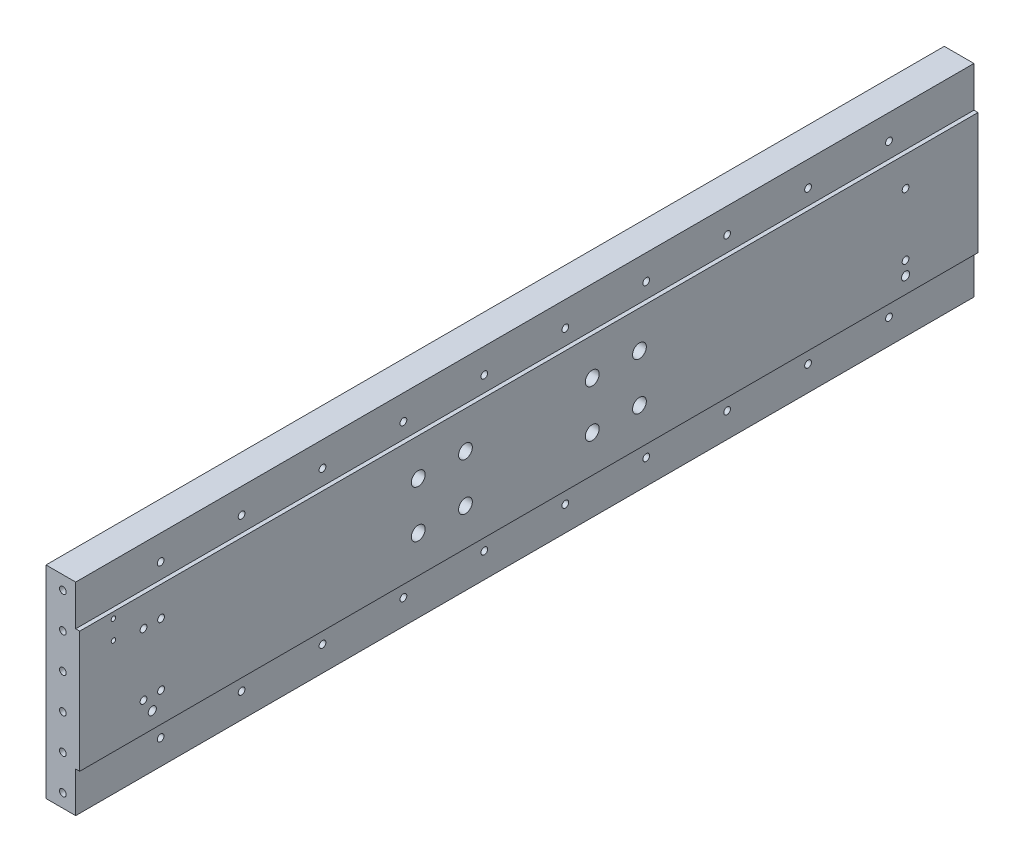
ISO-10303-21;
HEADER;
FILE_DESCRIPTION(('STEP AP214'),'2;1');
FILE_NAME('part.step','',(''),(''),'','','');
FILE_SCHEMA(('AUTOMOTIVE_DESIGN { 1 0 10303 214 1 1 1 1 }'));
ENDSEC;
DATA;
#1=APPLICATION_CONTEXT('core data for automotive mechanical design processes');
#2=APPLICATION_PROTOCOL_DEFINITION('international standard','automotive_design',2000,#1);
#3=PRODUCT_CONTEXT('',#1,'mechanical');
#4=PRODUCT('Part','Part','',(#3));
#5=PRODUCT_RELATED_PRODUCT_CATEGORY('part','',(#4));
#6=PRODUCT_DEFINITION_FORMATION('','',#4);
#7=PRODUCT_DEFINITION_CONTEXT('part definition',#1,'design');
#8=PRODUCT_DEFINITION('design','',#6,#7);
#9=PRODUCT_DEFINITION_SHAPE('','',#8);
#10=(LENGTH_UNIT() NAMED_UNIT(*) SI_UNIT(.MILLI.,.METRE.));
#11=(NAMED_UNIT(*) PLANE_ANGLE_UNIT() SI_UNIT($,.RADIAN.));
#12=(NAMED_UNIT(*) SI_UNIT($,.STERADIAN.) SOLID_ANGLE_UNIT());
#13=UNCERTAINTY_MEASURE_WITH_UNIT(LENGTH_MEASURE(1.E-05),#10,'distance_accuracy_value','');
#14=(GEOMETRIC_REPRESENTATION_CONTEXT(3) GLOBAL_UNCERTAINTY_ASSIGNED_CONTEXT((#13)) GLOBAL_UNIT_ASSIGNED_CONTEXT((#10,
#11,#12)) REPRESENTATION_CONTEXT('',''));
#15=CARTESIAN_POINT('',(0.,0.,0.));
#16=DIRECTION('',(0.,0.,1.));
#17=DIRECTION('',(1.,0.,0.));
#18=AXIS2_PLACEMENT_3D('',#15,#16,#17);
#19=CARTESIAN_POINT('',(25.,92.5,414.));
#20=DIRECTION('',(1.,0.,0.));
#21=DIRECTION('',(0.,0.,-1.));
#22=AXIS2_PLACEMENT_3D('',#19,#20,#21);
#23=CYLINDRICAL_SURFACE('',#22,5.09999999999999);
#24=CARTESIAN_POINT('',(7.49999999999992,92.5,414.));
#25=DIRECTION('',(-1.,0.,0.));
#26=DIRECTION('',(0.,0.,1.));
#27=AXIS2_PLACEMENT_3D('',#24,#25,#26);
#28=CIRCLE('',#27,5.09999999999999);
#29=CARTESIAN_POINT('',(7.49999999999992,92.5,419.1));
#30=VERTEX_POINT('',#29);
#31=EDGE_CURVE('E11',#30,#30,#28,.T.);
#32=ORIENTED_EDGE('',*,*,#31,.T.);
#33=EDGE_LOOP('',(#32));
#34=FACE_BOUND('',#33,.T.);
#35=CARTESIAN_POINT('',(25.,92.5,414.));
#36=DIRECTION('',(1.,0.,0.));
#37=DIRECTION('',(0.,0.,-1.));
#38=AXIS2_PLACEMENT_3D('',#35,#36,#37);
#39=CIRCLE('',#38,5.09999999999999);
#40=CARTESIAN_POINT('',(25.,92.5,408.9));
#41=VERTEX_POINT('',#40);
#42=EDGE_CURVE('E347',#41,#41,#39,.T.);
#43=ORIENTED_EDGE('',*,*,#42,.T.);
#44=EDGE_LOOP('',(#43));
#45=FACE_BOUND('',#44,.T.);
#46=ADVANCED_FACE('F48',(#34,#45),#23,.F.);
#47=CARTESIAN_POINT('',(25.,92.5,449.));
#48=DIRECTION('',(1.,0.,0.));
#49=DIRECTION('',(0.,0.,-1.));
#50=AXIS2_PLACEMENT_3D('',#47,#48,#49);
#51=CYLINDRICAL_SURFACE('',#50,5.09999999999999);
#52=CARTESIAN_POINT('',(7.49999999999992,92.5,449.));
#53=DIRECTION('',(-1.,0.,0.));
#54=DIRECTION('',(0.,0.,1.));
#55=AXIS2_PLACEMENT_3D('',#52,#53,#54);
#56=CIRCLE('',#55,5.09999999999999);
#57=CARTESIAN_POINT('',(7.49999999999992,92.5,454.1));
#58=VERTEX_POINT('',#57);
#59=EDGE_CURVE('E760',#58,#58,#56,.T.);
#60=ORIENTED_EDGE('',*,*,#59,.T.);
#61=EDGE_LOOP('',(#60));
#62=FACE_BOUND('',#61,.T.);
#63=CARTESIAN_POINT('',(25.,92.5,449.));
#64=DIRECTION('',(1.,0.,0.));
#65=DIRECTION('',(0.,0.,-1.));
#66=AXIS2_PLACEMENT_3D('',#63,#64,#65);
#67=CIRCLE('',#66,5.09999999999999);
#68=CARTESIAN_POINT('',(25.,92.5,443.9));
#69=VERTEX_POINT('',#68);
#70=EDGE_CURVE('E337',#69,#69,#67,.T.);
#71=ORIENTED_EDGE('',*,*,#70,.T.);
#72=EDGE_LOOP('',(#71));
#73=FACE_BOUND('',#72,.T.);
#74=ADVANCED_FACE('F783',(#62,#73),#51,.F.);
#75=CARTESIAN_POINT('',(25.,57.5,449.));
#76=DIRECTION('',(1.,0.,0.));
#77=DIRECTION('',(0.,0.,-1.));
#78=AXIS2_PLACEMENT_3D('',#75,#76,#77);
#79=CYLINDRICAL_SURFACE('',#78,5.09999999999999);
#80=CARTESIAN_POINT('',(7.49999999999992,57.5,449.));
#81=DIRECTION('',(-1.,0.,0.));
#82=DIRECTION('',(0.,0.,1.));
#83=AXIS2_PLACEMENT_3D('',#80,#81,#82);
#84=CIRCLE('',#83,5.09999999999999);
#85=CARTESIAN_POINT('',(7.49999999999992,57.5,454.1));
#86=VERTEX_POINT('',#85);
#87=EDGE_CURVE('E745',#86,#86,#84,.T.);
#88=ORIENTED_EDGE('',*,*,#87,.T.);
#89=EDGE_LOOP('',(#88));
#90=FACE_BOUND('',#89,.T.);
#91=CARTESIAN_POINT('',(25.,57.5,449.));
#92=DIRECTION('',(1.,0.,0.));
#93=DIRECTION('',(0.,0.,-1.));
#94=AXIS2_PLACEMENT_3D('',#91,#92,#93);
#95=CIRCLE('',#94,5.09999999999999);
#96=CARTESIAN_POINT('',(25.,57.5,443.9));
#97=VERTEX_POINT('',#96);
#98=EDGE_CURVE('E343',#97,#97,#95,.T.);
#99=ORIENTED_EDGE('',*,*,#98,.T.);
#100=EDGE_LOOP('',(#99));
#101=FACE_BOUND('',#100,.T.);
#102=ADVANCED_FACE('F789',(#90,#101),#79,.F.);
#103=CARTESIAN_POINT('',(25.,57.5,414.));
#104=DIRECTION('',(1.,0.,0.));
#105=DIRECTION('',(0.,0.,-1.));
#106=AXIS2_PLACEMENT_3D('',#103,#104,#105);
#107=CYLINDRICAL_SURFACE('',#106,5.09999999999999);
#108=CARTESIAN_POINT('',(7.49999999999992,57.5,414.));
#109=DIRECTION('',(-1.,0.,0.));
#110=DIRECTION('',(0.,0.,1.));
#111=AXIS2_PLACEMENT_3D('',#108,#109,#110);
#112=CIRCLE('',#111,5.09999999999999);
#113=CARTESIAN_POINT('',(7.49999999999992,57.5,419.1));
#114=VERTEX_POINT('',#113);
#115=EDGE_CURVE('E753',#114,#114,#112,.T.);
#116=ORIENTED_EDGE('',*,*,#115,.T.);
#117=EDGE_LOOP('',(#116));
#118=FACE_BOUND('',#117,.T.);
#119=CARTESIAN_POINT('',(25.,57.5,414.));
#120=DIRECTION('',(1.,0.,0.));
#121=DIRECTION('',(0.,0.,-1.));
#122=AXIS2_PLACEMENT_3D('',#119,#120,#121);
#123=CIRCLE('',#122,5.09999999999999);
#124=CARTESIAN_POINT('',(25.,57.5,408.9));
#125=VERTEX_POINT('',#124);
#126=EDGE_CURVE('E351',#125,#125,#123,.T.);
#127=ORIENTED_EDGE('',*,*,#126,.T.);
#128=EDGE_LOOP('',(#127));
#129=FACE_BOUND('',#128,.T.);
#130=ADVANCED_FACE('F795',(#118,#129),#107,.F.);
#131=CARTESIAN_POINT('',(25.,57.5,285.));
#132=DIRECTION('',(1.,0.,0.));
#133=DIRECTION('',(0.,0.,-1.));
#134=AXIS2_PLACEMENT_3D('',#131,#132,#133);
#135=CYLINDRICAL_SURFACE('',#134,5.09999999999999);
#136=CARTESIAN_POINT('',(7.49999999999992,57.5,285.));
#137=DIRECTION('',(-1.,0.,0.));
#138=DIRECTION('',(0.,0.,1.));
#139=AXIS2_PLACEMENT_3D('',#136,#137,#138);
#140=CIRCLE('',#139,5.09999999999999);
#141=CARTESIAN_POINT('',(7.49999999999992,57.5,290.1));
#142=VERTEX_POINT('',#141);
#143=EDGE_CURVE('E738',#142,#142,#140,.T.);
#144=ORIENTED_EDGE('',*,*,#143,.T.);
#145=EDGE_LOOP('',(#144));
#146=FACE_BOUND('',#145,.T.);
#147=CARTESIAN_POINT('',(25.,57.5,285.));
#148=DIRECTION('',(1.,0.,0.));
#149=DIRECTION('',(0.,0.,-1.));
#150=AXIS2_PLACEMENT_3D('',#147,#148,#149);
#151=CIRCLE('',#150,5.09999999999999);
#152=CARTESIAN_POINT('',(25.,57.5,279.9));
#153=VERTEX_POINT('',#152);
#154=EDGE_CURVE('E363',#153,#153,#151,.T.);
#155=ORIENTED_EDGE('',*,*,#154,.T.);
#156=EDGE_LOOP('',(#155));
#157=FACE_BOUND('',#156,.T.);
#158=ADVANCED_FACE('F798',(#146,#157),#135,.F.);
#159=CARTESIAN_POINT('',(25.,57.5,320.));
#160=DIRECTION('',(1.,0.,0.));
#161=DIRECTION('',(0.,0.,-1.));
#162=AXIS2_PLACEMENT_3D('',#159,#160,#161);
#163=CYLINDRICAL_SURFACE('',#162,5.09999999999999);
#164=CARTESIAN_POINT('',(7.49999999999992,57.5,320.));
#165=DIRECTION('',(-1.,0.,0.));
#166=DIRECTION('',(0.,0.,1.));
#167=AXIS2_PLACEMENT_3D('',#164,#165,#166);
#168=CIRCLE('',#167,5.09999999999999);
#169=CARTESIAN_POINT('',(7.49999999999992,57.5,325.1));
#170=VERTEX_POINT('',#169);
#171=EDGE_CURVE('E730',#170,#170,#168,.T.);
#172=ORIENTED_EDGE('',*,*,#171,.T.);
#173=EDGE_LOOP('',(#172));
#174=FACE_BOUND('',#173,.T.);
#175=CARTESIAN_POINT('',(25.,57.5,320.));
#176=DIRECTION('',(1.,0.,0.));
#177=DIRECTION('',(0.,0.,-1.));
#178=AXIS2_PLACEMENT_3D('',#175,#176,#177);
#179=CIRCLE('',#178,5.09999999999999);
#180=CARTESIAN_POINT('',(25.,57.5,314.9));
#181=VERTEX_POINT('',#180);
#182=EDGE_CURVE('E359',#181,#181,#179,.T.);
#183=ORIENTED_EDGE('',*,*,#182,.T.);
#184=EDGE_LOOP('',(#183));
#185=FACE_BOUND('',#184,.T.);
#186=ADVANCED_FACE('F804',(#174,#185),#163,.F.);
#187=CARTESIAN_POINT('',(25.,92.5,320.));
#188=DIRECTION('',(1.,0.,0.));
#189=DIRECTION('',(0.,0.,-1.));
#190=AXIS2_PLACEMENT_3D('',#187,#188,#189);
#191=CYLINDRICAL_SURFACE('',#190,5.09999999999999);
#192=CARTESIAN_POINT('',(7.49999999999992,92.5,320.));
#193=DIRECTION('',(-1.,0.,0.));
#194=DIRECTION('',(0.,0.,1.));
#195=AXIS2_PLACEMENT_3D('',#192,#193,#194);
#196=CIRCLE('',#195,5.09999999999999);
#197=CARTESIAN_POINT('',(7.49999999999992,92.5,325.1));
#198=VERTEX_POINT('',#197);
#199=EDGE_CURVE('E722',#198,#198,#196,.T.);
#200=ORIENTED_EDGE('',*,*,#199,.T.);
#201=EDGE_LOOP('',(#200));
#202=FACE_BOUND('',#201,.T.);
#203=CARTESIAN_POINT('',(25.,92.5,320.));
#204=DIRECTION('',(1.,0.,0.));
#205=DIRECTION('',(0.,0.,-1.));
#206=AXIS2_PLACEMENT_3D('',#203,#204,#205);
#207=CIRCLE('',#206,5.09999999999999);
#208=CARTESIAN_POINT('',(25.,92.5,314.9));
#209=VERTEX_POINT('',#208);
#210=EDGE_CURVE('E355',#209,#209,#207,.T.);
#211=ORIENTED_EDGE('',*,*,#210,.T.);
#212=EDGE_LOOP('',(#211));
#213=FACE_BOUND('',#212,.T.);
#214=ADVANCED_FACE('F800',(#202,#213),#191,.F.);
#215=CARTESIAN_POINT('',(25.,92.5,285.));
#216=DIRECTION('',(1.,0.,0.));
#217=DIRECTION('',(0.,0.,-1.));
#218=AXIS2_PLACEMENT_3D('',#215,#216,#217);
#219=CYLINDRICAL_SURFACE('',#218,5.09999999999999);
#220=CARTESIAN_POINT('',(7.49999999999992,92.5,285.));
#221=DIRECTION('',(-1.,0.,0.));
#222=DIRECTION('',(0.,0.,1.));
#223=AXIS2_PLACEMENT_3D('',#220,#221,#222);
#224=CIRCLE('',#223,5.09999999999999);
#225=CARTESIAN_POINT('',(7.49999999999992,92.5,290.1));
#226=VERTEX_POINT('',#225);
#227=EDGE_CURVE('E714',#226,#226,#224,.T.);
#228=ORIENTED_EDGE('',*,*,#227,.T.);
#229=EDGE_LOOP('',(#228));
#230=FACE_BOUND('',#229,.T.);
#231=CARTESIAN_POINT('',(25.,92.5,285.));
#232=DIRECTION('',(1.,0.,0.));
#233=DIRECTION('',(0.,0.,-1.));
#234=AXIS2_PLACEMENT_3D('',#231,#232,#233);
#235=CIRCLE('',#234,5.09999999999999);
#236=CARTESIAN_POINT('',(25.,92.5,279.9));
#237=VERTEX_POINT('',#236);
#238=EDGE_CURVE('E366',#237,#237,#235,.T.);
#239=ORIENTED_EDGE('',*,*,#238,.T.);
#240=EDGE_LOOP('',(#239));
#241=FACE_BOUND('',#240,.T.);
#242=ADVANCED_FACE('F803',(#230,#241),#219,.F.);
#243=CARTESIAN_POINT('',(0.,0.,700.));
#244=DIRECTION('',(1.,0.,0.));
#245=DIRECTION('',(0.,0.,-1.));
#246=AXIS2_PLACEMENT_3D('',#243,#244,#245);
#247=PLANE('',#246);
#248=CARTESIAN_POINT('',(0.,92.5,414.));
#249=DIRECTION('',(-1.,0.,0.));
#250=DIRECTION('',(0.,0.,1.));
#251=AXIS2_PLACEMENT_3D('',#248,#249,#250);
#252=CIRCLE('',#251,12.);
#253=CARTESIAN_POINT('',(0.,92.5,426.));
#254=VERTEX_POINT('',#253);
#255=EDGE_CURVE('E278',#254,#254,#252,.T.);
#256=ORIENTED_EDGE('',*,*,#255,.F.);
#257=EDGE_LOOP('',(#256));
#258=FACE_BOUND('',#257,.T.);
#259=CARTESIAN_POINT('',(0.,92.5,449.));
#260=DIRECTION('',(-1.,0.,0.));
#261=DIRECTION('',(0.,0.,1.));
#262=AXIS2_PLACEMENT_3D('',#259,#260,#261);
#263=CIRCLE('',#262,12.);
#264=CARTESIAN_POINT('',(0.,92.5,461.));
#265=VERTEX_POINT('',#264);
#266=EDGE_CURVE('E283',#265,#265,#263,.T.);
#267=ORIENTED_EDGE('',*,*,#266,.F.);
#268=EDGE_LOOP('',(#267));
#269=FACE_BOUND('',#268,.T.);
#270=CARTESIAN_POINT('',(0.,57.5,449.));
#271=DIRECTION('',(-1.,0.,0.));
#272=DIRECTION('',(0.,0.,1.));
#273=AXIS2_PLACEMENT_3D('',#270,#271,#272);
#274=CIRCLE('',#273,12.);
#275=CARTESIAN_POINT('',(0.,57.5,461.));
#276=VERTEX_POINT('',#275);
#277=EDGE_CURVE('E290',#276,#276,#274,.T.);
#278=ORIENTED_EDGE('',*,*,#277,.F.);
#279=EDGE_LOOP('',(#278));
#280=FACE_BOUND('',#279,.T.);
#281=CARTESIAN_POINT('',(0.,57.5,414.));
#282=DIRECTION('',(-1.,0.,0.));
#283=DIRECTION('',(0.,0.,1.));
#284=AXIS2_PLACEMENT_3D('',#281,#282,#283);
#285=CIRCLE('',#284,12.);
#286=CARTESIAN_POINT('',(0.,57.5,426.));
#287=VERTEX_POINT('',#286);
#288=EDGE_CURVE('E297',#287,#287,#285,.T.);
#289=ORIENTED_EDGE('',*,*,#288,.F.);
#290=EDGE_LOOP('',(#289));
#291=FACE_BOUND('',#290,.T.);
#292=CARTESIAN_POINT('',(0.,57.5,285.));
#293=DIRECTION('',(-1.,0.,0.));
#294=DIRECTION('',(0.,0.,1.));
#295=AXIS2_PLACEMENT_3D('',#292,#293,#294);
#296=CIRCLE('',#295,12.);
#297=CARTESIAN_POINT('',(0.,57.5,297.));
#298=VERTEX_POINT('',#297);
#299=EDGE_CURVE('E305',#298,#298,#296,.T.);
#300=ORIENTED_EDGE('',*,*,#299,.F.);
#301=EDGE_LOOP('',(#300));
#302=FACE_BOUND('',#301,.T.);
#303=CARTESIAN_POINT('',(0.,57.5,320.));
#304=DIRECTION('',(-1.,0.,0.));
#305=DIRECTION('',(0.,0.,1.));
#306=AXIS2_PLACEMENT_3D('',#303,#304,#305);
#307=CIRCLE('',#306,12.);
#308=CARTESIAN_POINT('',(0.,57.5,332.));
#309=VERTEX_POINT('',#308);
#310=EDGE_CURVE('E313',#309,#309,#307,.T.);
#311=ORIENTED_EDGE('',*,*,#310,.F.);
#312=EDGE_LOOP('',(#311));
#313=FACE_BOUND('',#312,.T.);
#314=CARTESIAN_POINT('',(0.,92.5,320.));
#315=DIRECTION('',(-1.,0.,0.));
#316=DIRECTION('',(0.,0.,1.));
#317=AXIS2_PLACEMENT_3D('',#314,#315,#316);
#318=CIRCLE('',#317,12.);
#319=CARTESIAN_POINT('',(0.,92.5,332.));
#320=VERTEX_POINT('',#319);
#321=EDGE_CURVE('E321',#320,#320,#318,.T.);
#322=ORIENTED_EDGE('',*,*,#321,.F.);
#323=EDGE_LOOP('',(#322));
#324=FACE_BOUND('',#323,.T.);
#325=CARTESIAN_POINT('',(0.,92.5,285.));
#326=DIRECTION('',(-1.,0.,0.));
#327=DIRECTION('',(0.,0.,1.));
#328=AXIS2_PLACEMENT_3D('',#325,#326,#327);
#329=CIRCLE('',#328,12.);
#330=CARTESIAN_POINT('',(0.,92.5,297.));
#331=VERTEX_POINT('',#330);
#332=EDGE_CURVE('E329',#331,#331,#329,.T.);
#333=ORIENTED_EDGE('',*,*,#332,.F.);
#334=EDGE_LOOP('',(#333));
#335=FACE_BOUND('',#334,.T.);
#336=DIRECTION('',(0.,0.,1.));
#337=VECTOR('',#336,1.);
#338=CARTESIAN_POINT('',(0.,150.,0.));
#339=LINE('',#338,#337);
#340=CARTESIAN_POINT('',(0.,150.,34.));
#341=VERTEX_POINT('',#340);
#342=CARTESIAN_POINT('',(0.,150.,700.));
#343=VERTEX_POINT('',#342);
#344=EDGE_CURVE('E687',#341,#343,#339,.T.);
#345=ORIENTED_EDGE('',*,*,#344,.F.);
#346=DIRECTION('',(0.,-1.,0.));
#347=VECTOR('',#346,1.);
#348=CARTESIAN_POINT('',(0.,0.,34.));
#349=LINE('',#348,#347);
#350=CARTESIAN_POINT('',(0.,0.,34.));
#351=VERTEX_POINT('',#350);
#352=EDGE_CURVE('E648',#341,#351,#349,.T.);
#353=ORIENTED_EDGE('',*,*,#352,.T.);
#354=DIRECTION('',(0.,0.,-1.));
#355=VECTOR('',#354,1.);
#356=CARTESIAN_POINT('',(0.,0.,700.));
#357=LINE('',#356,#355);
#358=CARTESIAN_POINT('',(0.,0.,700.));
#359=VERTEX_POINT('',#358);
#360=EDGE_CURVE('E704',#359,#351,#357,.T.);
#361=ORIENTED_EDGE('',*,*,#360,.F.);
#362=DIRECTION('',(0.,-1.,0.));
#363=VECTOR('',#362,1.);
#364=CARTESIAN_POINT('',(0.,150.,700.));
#365=LINE('',#364,#363);
#366=EDGE_CURVE('E673',#343,#359,#365,.T.);
#367=ORIENTED_EDGE('',*,*,#366,.F.);
#368=EDGE_LOOP('',(#345,#353,#361,#367));
#369=FACE_BOUND('',#368,.T.);
#370=ADVANCED_FACE('F814',(#258,#269,#280,#291,#302,#313,#324,#335,#369),#247,.F.);
#371=CARTESIAN_POINT('',(0.,0.,700.));
#372=DIRECTION('',(0.,1.,0.));
#373=DIRECTION('',(0.,0.,1.));
#374=AXIS2_PLACEMENT_3D('',#371,#372,#373);
#375=PLANE('',#374);
#376=ORIENTED_EDGE('',*,*,#360,.T.);
#377=DIRECTION('',(1.,0.,0.));
#378=VECTOR('',#377,1.);
#379=CARTESIAN_POINT('',(-75.,0.,34.));
#380=LINE('',#379,#378);
#381=CARTESIAN_POINT('',(22.,0.,34.));
#382=VERTEX_POINT('',#381);
#383=EDGE_CURVE('E641',#351,#382,#380,.T.);
#384=ORIENTED_EDGE('',*,*,#383,.T.);
#385=DIRECTION('',(0.,0.,1.));
#386=VECTOR('',#385,1.);
#387=CARTESIAN_POINT('',(22.,0.,700.));
#388=LINE('',#387,#386);
#389=CARTESIAN_POINT('',(22.,0.,700.));
#390=VERTEX_POINT('',#389);
#391=EDGE_CURVE('E701',#382,#390,#388,.T.);
#392=ORIENTED_EDGE('',*,*,#391,.T.);
#393=DIRECTION('',(1.,0.,0.));
#394=VECTOR('',#393,1.);
#395=CARTESIAN_POINT('',(0.,0.,700.));
#396=LINE('',#395,#394);
#397=EDGE_CURVE('E676',#359,#390,#396,.T.);
#398=ORIENTED_EDGE('',*,*,#397,.F.);
#399=EDGE_LOOP('',(#376,#384,#392,#398));
#400=FACE_BOUND('',#399,.T.);
#401=ADVANCED_FACE('F1168',(#400),#375,.F.);
#402=CARTESIAN_POINT('',(25.,0.,700.));
#403=DIRECTION('',(-1.,0.,0.));
#404=DIRECTION('',(0.,0.,1.));
#405=AXIS2_PLACEMENT_3D('',#402,#403,#404);
#406=PLANE('',#405);
#407=CARTESIAN_POINT('',(25.,115.5,675.));
#408=DIRECTION('',(1.,0.,0.));
#409=DIRECTION('',(0.,0.,-1.));
#410=AXIS2_PLACEMENT_3D('',#407,#408,#409);
#411=CIRCLE('',#410,1.65);
#412=CARTESIAN_POINT('',(25.,115.5,673.35));
#413=VERTEX_POINT('',#412);
#414=EDGE_CURVE('E264',#413,#413,#411,.T.);
#415=ORIENTED_EDGE('',*,*,#414,.F.);
#416=EDGE_LOOP('',(#415));
#417=FACE_BOUND('',#416,.T.);
#418=CARTESIAN_POINT('',(25.,101.5,675.));
#419=DIRECTION('',(1.,0.,0.));
#420=DIRECTION('',(0.,0.,-1.));
#421=AXIS2_PLACEMENT_3D('',#418,#419,#420);
#422=CIRCLE('',#421,1.65);
#423=CARTESIAN_POINT('',(25.,101.5,673.35));
#424=VERTEX_POINT('',#423);
#425=EDGE_CURVE('E263',#424,#424,#422,.T.);
#426=ORIENTED_EDGE('',*,*,#425,.F.);
#427=EDGE_LOOP('',(#426));
#428=FACE_BOUND('',#427,.T.);
#429=ORIENTED_EDGE('',*,*,#70,.F.);
#430=EDGE_LOOP('',(#429));
#431=FACE_BOUND('',#430,.T.);
#432=ORIENTED_EDGE('',*,*,#98,.F.);
#433=EDGE_LOOP('',(#432));
#434=FACE_BOUND('',#433,.T.);
#435=ORIENTED_EDGE('',*,*,#42,.F.);
#436=EDGE_LOOP('',(#435));
#437=FACE_BOUND('',#436,.T.);
#438=ORIENTED_EDGE('',*,*,#126,.F.);
#439=EDGE_LOOP('',(#438));
#440=FACE_BOUND('',#439,.T.);
#441=ORIENTED_EDGE('',*,*,#210,.F.);
#442=EDGE_LOOP('',(#441));
#443=FACE_BOUND('',#442,.T.);
#444=ORIENTED_EDGE('',*,*,#182,.F.);
#445=EDGE_LOOP('',(#444));
#446=FACE_BOUND('',#445,.T.);
#447=ORIENTED_EDGE('',*,*,#154,.F.);
#448=EDGE_LOOP('',(#447));
#449=FACE_BOUND('',#448,.T.);
#450=ORIENTED_EDGE('',*,*,#238,.F.);
#451=EDGE_LOOP('',(#450));
#452=FACE_BOUND('',#451,.T.);
#453=CARTESIAN_POINT('',(25.,42.,87.7));
#454=DIRECTION('',(1.,0.,0.));
#455=DIRECTION('',(0.,0.,-1.));
#456=AXIS2_PLACEMENT_3D('',#453,#454,#455);
#457=CIRCLE('',#456,3.00000000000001);
#458=CARTESIAN_POINT('',(25.,42.,84.7));
#459=VERTEX_POINT('',#458);
#460=EDGE_CURVE('E448',#459,#459,#457,.T.);
#461=ORIENTED_EDGE('',*,*,#460,.F.);
#462=EDGE_LOOP('',(#461));
#463=FACE_BOUND('',#462,.T.);
#464=CARTESIAN_POINT('',(25.,42.,646.2));
#465=DIRECTION('',(1.,0.,0.));
#466=DIRECTION('',(0.,0.,-1.));
#467=AXIS2_PLACEMENT_3D('',#464,#465,#466);
#468=CIRCLE('',#467,3.00000000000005);
#469=CARTESIAN_POINT('',(25.,42.,643.2));
#470=VERTEX_POINT('',#469);
#471=EDGE_CURVE('E451',#470,#470,#468,.T.);
#472=ORIENTED_EDGE('',*,*,#471,.F.);
#473=EDGE_LOOP('',(#472));
#474=FACE_BOUND('',#473,.T.);
#475=CARTESIAN_POINT('',(25.,98.,652.7));
#476=DIRECTION('',(1.,0.,0.));
#477=DIRECTION('',(0.,0.,-1.));
#478=AXIS2_PLACEMENT_3D('',#475,#476,#477);
#479=CIRCLE('',#478,2.49999999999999);
#480=CARTESIAN_POINT('',(25.,98.,650.2));
#481=VERTEX_POINT('',#480);
#482=EDGE_CURVE('E457',#481,#481,#479,.T.);
#483=ORIENTED_EDGE('',*,*,#482,.F.);
#484=EDGE_LOOP('',(#483));
#485=FACE_BOUND('',#484,.T.);
#486=CARTESIAN_POINT('',(25.,98.,639.7));
#487=DIRECTION('',(1.,0.,0.));
#488=DIRECTION('',(0.,0.,-1.));
#489=AXIS2_PLACEMENT_3D('',#486,#487,#488);
#490=CIRCLE('',#489,2.49999999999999);
#491=CARTESIAN_POINT('',(25.,98.,637.2));
#492=VERTEX_POINT('',#491);
#493=EDGE_CURVE('E467',#492,#492,#490,.T.);
#494=ORIENTED_EDGE('',*,*,#493,.F.);
#495=EDGE_LOOP('',(#494));
#496=FACE_BOUND('',#495,.T.);
#497=CARTESIAN_POINT('',(25.,52.,652.7));
#498=DIRECTION('',(1.,0.,0.));
#499=DIRECTION('',(0.,0.,-1.));
#500=AXIS2_PLACEMENT_3D('',#497,#498,#499);
#501=CIRCLE('',#500,2.49999999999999);
#502=CARTESIAN_POINT('',(25.,52.,650.2));
#503=VERTEX_POINT('',#502);
#504=EDGE_CURVE('E475',#503,#503,#501,.T.);
#505=ORIENTED_EDGE('',*,*,#504,.F.);
#506=EDGE_LOOP('',(#505));
#507=FACE_BOUND('',#506,.T.);
#508=CARTESIAN_POINT('',(25.,52.,639.7));
#509=DIRECTION('',(1.,0.,0.));
#510=DIRECTION('',(0.,0.,-1.));
#511=AXIS2_PLACEMENT_3D('',#508,#509,#510);
#512=CIRCLE('',#511,2.49999999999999);
#513=CARTESIAN_POINT('',(25.,52.,637.2));
#514=VERTEX_POINT('',#513);
#515=EDGE_CURVE('E482',#514,#514,#512,.T.);
#516=ORIENTED_EDGE('',*,*,#515,.F.);
#517=EDGE_LOOP('',(#516));
#518=FACE_BOUND('',#517,.T.);
#519=CARTESIAN_POINT('',(25.,98.,87.7));
#520=DIRECTION('',(1.,0.,0.));
#521=DIRECTION('',(0.,0.,-1.));
#522=AXIS2_PLACEMENT_3D('',#519,#520,#521);
#523=CIRCLE('',#522,2.49999999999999);
#524=CARTESIAN_POINT('',(25.,98.,85.2));
#525=VERTEX_POINT('',#524);
#526=EDGE_CURVE('E489',#525,#525,#523,.T.);
#527=ORIENTED_EDGE('',*,*,#526,.F.);
#528=EDGE_LOOP('',(#527));
#529=FACE_BOUND('',#528,.T.);
#530=CARTESIAN_POINT('',(25.,52.,87.7));
#531=DIRECTION('',(1.,0.,0.));
#532=DIRECTION('',(0.,0.,-1.));
#533=AXIS2_PLACEMENT_3D('',#530,#531,#532);
#534=CIRCLE('',#533,2.49999999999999);
#535=CARTESIAN_POINT('',(25.,52.,85.2));
#536=VERTEX_POINT('',#535);
#537=EDGE_CURVE('E495',#536,#536,#534,.T.);
#538=ORIENTED_EDGE('',*,*,#537,.F.);
#539=EDGE_LOOP('',(#538));
#540=FACE_BOUND('',#539,.T.);
#541=DIRECTION('',(0.,0.,-1.));
#542=VECTOR('',#541,1.);
#543=CARTESIAN_POINT('',(25.,30.,700.));
#544=LINE('',#543,#542);
#545=CARTESIAN_POINT('',(25.,30.,700.));
#546=VERTEX_POINT('',#545);
#547=CARTESIAN_POINT('',(25.,30.,34.));
#548=VERTEX_POINT('',#547);
#549=EDGE_CURVE('E697',#546,#548,#544,.T.);
#550=ORIENTED_EDGE('',*,*,#549,.T.);
#551=DIRECTION('',(0.,-1.,0.));
#552=VECTOR('',#551,1.);
#553=CARTESIAN_POINT('',(25.,0.,34.));
#554=LINE('',#553,#552);
#555=CARTESIAN_POINT('',(25.,120.,34.));
#556=VERTEX_POINT('',#555);
#557=EDGE_CURVE('E639',#556,#548,#554,.T.);
#558=ORIENTED_EDGE('',*,*,#557,.F.);
#559=DIRECTION('',(0.,0.,1.));
#560=VECTOR('',#559,1.);
#561=CARTESIAN_POINT('',(25.,120.,0.));
#562=LINE('',#561,#560);
#563=CARTESIAN_POINT('',(25.,120.,700.));
#564=VERTEX_POINT('',#563);
#565=EDGE_CURVE('E688',#556,#564,#562,.T.);
#566=ORIENTED_EDGE('',*,*,#565,.T.);
#567=DIRECTION('',(0.,1.,0.));
#568=VECTOR('',#567,1.);
#569=CARTESIAN_POINT('',(25.,30.,700.));
#570=LINE('',#569,#568);
#571=EDGE_CURVE('E660',#546,#564,#570,.T.);
#572=ORIENTED_EDGE('',*,*,#571,.F.);
#573=EDGE_LOOP('',(#550,#558,#566,#572));
#574=FACE_BOUND('',#573,.T.);
#575=ADVANCED_FACE('F1164',(#417,#428,#431,#434,#437,#440,#443,#446,#449,#452,#463,#474,#485,
#496,#507,#518,#529,#540,#574),#406,.F.);
#576=CARTESIAN_POINT('',(22.,30.,0.));
#577=DIRECTION('',(-1.,0.,0.));
#578=DIRECTION('',(0.,-1.,0.));
#579=AXIS2_PLACEMENT_3D('',#576,#577,#578);
#580=PLANE('',#579);
#581=CARTESIAN_POINT('',(22.,18.5,637.));
#582=DIRECTION('',(1.,0.,0.));
#583=DIRECTION('',(0.,0.,-1.));
#584=AXIS2_PLACEMENT_3D('',#581,#582,#583);
#585=CIRCLE('',#584,2.5);
#586=CARTESIAN_POINT('',(22.,18.5,634.5));
#587=VERTEX_POINT('',#586);
#588=EDGE_CURVE('E567',#587,#587,#585,.T.);
#589=ORIENTED_EDGE('',*,*,#588,.F.);
#590=EDGE_LOOP('',(#589));
#591=FACE_BOUND('',#590,.T.);
#592=CARTESIAN_POINT('',(22.,18.5,577.));
#593=DIRECTION('',(1.,0.,0.));
#594=DIRECTION('',(0.,0.,-1.));
#595=AXIS2_PLACEMENT_3D('',#592,#593,#594);
#596=CIRCLE('',#595,2.5);
#597=CARTESIAN_POINT('',(22.,18.5,574.5));
#598=VERTEX_POINT('',#597);
#599=EDGE_CURVE('E573',#598,#598,#596,.T.);
#600=ORIENTED_EDGE('',*,*,#599,.F.);
#601=EDGE_LOOP('',(#600));
#602=FACE_BOUND('',#601,.T.);
#603=CARTESIAN_POINT('',(22.,18.5,517.));
#604=DIRECTION('',(1.,0.,0.));
#605=DIRECTION('',(0.,0.,-1.));
#606=AXIS2_PLACEMENT_3D('',#603,#604,#605);
#607=CIRCLE('',#606,2.5);
#608=CARTESIAN_POINT('',(22.,18.5,514.5));
#609=VERTEX_POINT('',#608);
#610=EDGE_CURVE('E581',#609,#609,#607,.T.);
#611=ORIENTED_EDGE('',*,*,#610,.F.);
#612=EDGE_LOOP('',(#611));
#613=FACE_BOUND('',#612,.T.);
#614=CARTESIAN_POINT('',(22.,18.5,457.));
#615=DIRECTION('',(1.,0.,0.));
#616=DIRECTION('',(0.,0.,-1.));
#617=AXIS2_PLACEMENT_3D('',#614,#615,#616);
#618=CIRCLE('',#617,2.5);
#619=CARTESIAN_POINT('',(22.,18.5,454.5));
#620=VERTEX_POINT('',#619);
#621=EDGE_CURVE('E589',#620,#620,#618,.T.);
#622=ORIENTED_EDGE('',*,*,#621,.F.);
#623=EDGE_LOOP('',(#622));
#624=FACE_BOUND('',#623,.T.);
#625=CARTESIAN_POINT('',(22.,18.5,397.));
#626=DIRECTION('',(1.,0.,0.));
#627=DIRECTION('',(0.,0.,-1.));
#628=AXIS2_PLACEMENT_3D('',#625,#626,#627);
#629=CIRCLE('',#628,2.5);
#630=CARTESIAN_POINT('',(22.,18.5,394.5));
#631=VERTEX_POINT('',#630);
#632=EDGE_CURVE('E595',#631,#631,#629,.T.);
#633=ORIENTED_EDGE('',*,*,#632,.F.);
#634=EDGE_LOOP('',(#633));
#635=FACE_BOUND('',#634,.T.);
#636=CARTESIAN_POINT('',(22.,18.5,337.));
#637=DIRECTION('',(1.,0.,0.));
#638=DIRECTION('',(0.,0.,-1.));
#639=AXIS2_PLACEMENT_3D('',#636,#637,#638);
#640=CIRCLE('',#639,2.5);
#641=CARTESIAN_POINT('',(22.,18.5,334.5));
#642=VERTEX_POINT('',#641);
#643=EDGE_CURVE('E603',#642,#642,#640,.T.);
#644=ORIENTED_EDGE('',*,*,#643,.F.);
#645=EDGE_LOOP('',(#644));
#646=FACE_BOUND('',#645,.T.);
#647=CARTESIAN_POINT('',(22.,18.5,277.));
#648=DIRECTION('',(1.,0.,0.));
#649=DIRECTION('',(0.,0.,-1.));
#650=AXIS2_PLACEMENT_3D('',#647,#648,#649);
#651=CIRCLE('',#650,2.5);
#652=CARTESIAN_POINT('',(22.,18.5,274.5));
#653=VERTEX_POINT('',#652);
#654=EDGE_CURVE('E611',#653,#653,#651,.T.);
#655=ORIENTED_EDGE('',*,*,#654,.F.);
#656=EDGE_LOOP('',(#655));
#657=FACE_BOUND('',#656,.T.);
#658=CARTESIAN_POINT('',(22.,18.5,217.));
#659=DIRECTION('',(1.,0.,0.));
#660=DIRECTION('',(0.,0.,-1.));
#661=AXIS2_PLACEMENT_3D('',#658,#659,#660);
#662=CIRCLE('',#661,2.5);
#663=CARTESIAN_POINT('',(22.,18.5,214.5));
#664=VERTEX_POINT('',#663);
#665=EDGE_CURVE('E617',#664,#664,#662,.T.);
#666=ORIENTED_EDGE('',*,*,#665,.F.);
#667=EDGE_LOOP('',(#666));
#668=FACE_BOUND('',#667,.T.);
#669=CARTESIAN_POINT('',(22.,18.5,157.));
#670=DIRECTION('',(1.,0.,0.));
#671=DIRECTION('',(0.,0.,-1.));
#672=AXIS2_PLACEMENT_3D('',#669,#670,#671);
#673=CIRCLE('',#672,2.5);
#674=CARTESIAN_POINT('',(22.,18.5,154.5));
#675=VERTEX_POINT('',#674);
#676=EDGE_CURVE('E624',#675,#675,#673,.T.);
#677=ORIENTED_EDGE('',*,*,#676,.F.);
#678=EDGE_LOOP('',(#677));
#679=FACE_BOUND('',#678,.T.);
#680=CARTESIAN_POINT('',(22.,18.5,97.));
#681=DIRECTION('',(1.,0.,0.));
#682=DIRECTION('',(0.,0.,-1.));
#683=AXIS2_PLACEMENT_3D('',#680,#681,#682);
#684=CIRCLE('',#683,2.5);
#685=CARTESIAN_POINT('',(22.,18.5,94.5));
#686=VERTEX_POINT('',#685);
#687=EDGE_CURVE('E632',#686,#686,#684,.T.);
#688=ORIENTED_EDGE('',*,*,#687,.F.);
#689=EDGE_LOOP('',(#688));
#690=FACE_BOUND('',#689,.T.);
#691=ORIENTED_EDGE('',*,*,#391,.F.);
#692=DIRECTION('',(0.,1.,0.));
#693=VECTOR('',#692,1.);
#694=CARTESIAN_POINT('',(22.,30.,34.));
#695=LINE('',#694,#693);
#696=CARTESIAN_POINT('',(22.,30.,34.));
#697=VERTEX_POINT('',#696);
#698=EDGE_CURVE('E654',#382,#697,#695,.T.);
#699=ORIENTED_EDGE('',*,*,#698,.T.);
#700=DIRECTION('',(0.,0.,1.));
#701=VECTOR('',#700,1.);
#702=CARTESIAN_POINT('',(22.,30.,0.));
#703=LINE('',#702,#701);
#704=CARTESIAN_POINT('',(22.,30.,700.));
#705=VERTEX_POINT('',#704);
#706=EDGE_CURVE('E75',#697,#705,#703,.T.);
#707=ORIENTED_EDGE('',*,*,#706,.T.);
#708=DIRECTION('',(0.,1.,0.));
#709=VECTOR('',#708,1.);
#710=CARTESIAN_POINT('',(22.,0.,700.));
#711=LINE('',#710,#709);
#712=EDGE_CURVE('E680',#390,#705,#711,.T.);
#713=ORIENTED_EDGE('',*,*,#712,.F.);
#714=EDGE_LOOP('',(#691,#699,#707,#713));
#715=FACE_BOUND('',#714,.T.);
#716=ADVANCED_FACE('F1160',(#591,#602,#613,#624,#635,#646,#657,#668,#679,#690,#715),#580,.F.);
#717=CARTESIAN_POINT('',(22.,30.,0.));
#718=DIRECTION('',(0.,1.,0.));
#719=DIRECTION('',(0.,0.,1.));
#720=AXIS2_PLACEMENT_3D('',#717,#718,#719);
#721=PLANE('',#720);
#722=ORIENTED_EDGE('',*,*,#706,.F.);
#723=DIRECTION('',(1.,0.,0.));
#724=VECTOR('',#723,1.);
#725=CARTESIAN_POINT('',(22.,30.,34.));
#726=LINE('',#725,#724);
#727=EDGE_CURVE('E651',#697,#548,#726,.T.);
#728=ORIENTED_EDGE('',*,*,#727,.T.);
#729=ORIENTED_EDGE('',*,*,#549,.F.);
#730=DIRECTION('',(1.,0.,0.));
#731=VECTOR('',#730,1.);
#732=CARTESIAN_POINT('',(22.,30.,700.));
#733=LINE('',#732,#731);
#734=EDGE_CURVE('E656',#705,#546,#733,.T.);
#735=ORIENTED_EDGE('',*,*,#734,.F.);
#736=EDGE_LOOP('',(#722,#728,#729,#735));
#737=FACE_BOUND('',#736,.T.);
#738=ADVANCED_FACE('F1156',(#737),#721,.F.);
#739=CARTESIAN_POINT('',(0.,150.,0.));
#740=DIRECTION('',(0.,-1.,0.));
#741=DIRECTION('',(0.,0.,-1.));
#742=AXIS2_PLACEMENT_3D('',#739,#740,#741);
#743=PLANE('',#742);
#744=DIRECTION('',(0.,0.,1.));
#745=VECTOR('',#744,1.);
#746=CARTESIAN_POINT('',(22.,150.,0.));
#747=LINE('',#746,#745);
#748=CARTESIAN_POINT('',(22.,150.,34.));
#749=VERTEX_POINT('',#748);
#750=CARTESIAN_POINT('',(22.,150.,700.));
#751=VERTEX_POINT('',#750);
#752=EDGE_CURVE('E684',#749,#751,#747,.T.);
#753=ORIENTED_EDGE('',*,*,#752,.F.);
#754=DIRECTION('',(-1.,0.,0.));
#755=VECTOR('',#754,1.);
#756=CARTESIAN_POINT('',(0.,150.,34.));
#757=LINE('',#756,#755);
#758=EDGE_CURVE('E645',#749,#341,#757,.T.);
#759=ORIENTED_EDGE('',*,*,#758,.T.);
#760=ORIENTED_EDGE('',*,*,#344,.T.);
#761=DIRECTION('',(-1.,0.,0.));
#762=VECTOR('',#761,1.);
#763=CARTESIAN_POINT('',(22.,150.,700.));
#764=LINE('',#763,#762);
#765=EDGE_CURVE('E670',#751,#343,#764,.T.);
#766=ORIENTED_EDGE('',*,*,#765,.F.);
#767=EDGE_LOOP('',(#753,#759,#760,#766));
#768=FACE_BOUND('',#767,.T.);
#769=ADVANCED_FACE('F1152',(#768),#743,.F.);
#770=CARTESIAN_POINT('',(22.,150.,0.));
#771=DIRECTION('',(-1.,0.,0.));
#772=DIRECTION('',(0.,-1.,0.));
#773=AXIS2_PLACEMENT_3D('',#770,#771,#772);
#774=PLANE('',#773);
#775=CARTESIAN_POINT('',(22.,131.5,637.));
#776=DIRECTION('',(1.,0.,0.));
#777=DIRECTION('',(0.,0.,-1.));
#778=AXIS2_PLACEMENT_3D('',#775,#776,#777);
#779=CIRCLE('',#778,2.5);
#780=CARTESIAN_POINT('',(22.,131.5,634.5));
#781=VERTEX_POINT('',#780);
#782=EDGE_CURVE('E501',#781,#781,#779,.T.);
#783=ORIENTED_EDGE('',*,*,#782,.F.);
#784=EDGE_LOOP('',(#783));
#785=FACE_BOUND('',#784,.T.);
#786=CARTESIAN_POINT('',(22.,131.5,577.));
#787=DIRECTION('',(1.,0.,0.));
#788=DIRECTION('',(0.,0.,-1.));
#789=AXIS2_PLACEMENT_3D('',#786,#787,#788);
#790=CIRCLE('',#789,2.5);
#791=CARTESIAN_POINT('',(22.,131.5,574.5));
#792=VERTEX_POINT('',#791);
#793=EDGE_CURVE('E509',#792,#792,#790,.T.);
#794=ORIENTED_EDGE('',*,*,#793,.F.);
#795=EDGE_LOOP('',(#794));
#796=FACE_BOUND('',#795,.T.);
#797=CARTESIAN_POINT('',(22.,131.5,517.));
#798=DIRECTION('',(1.,0.,0.));
#799=DIRECTION('',(0.,0.,-1.));
#800=AXIS2_PLACEMENT_3D('',#797,#798,#799);
#801=CIRCLE('',#800,2.5);
#802=CARTESIAN_POINT('',(22.,131.5,514.5));
#803=VERTEX_POINT('',#802);
#804=EDGE_CURVE('E516',#803,#803,#801,.T.);
#805=ORIENTED_EDGE('',*,*,#804,.F.);
#806=EDGE_LOOP('',(#805));
#807=FACE_BOUND('',#806,.T.);
#808=CARTESIAN_POINT('',(22.,131.5,457.));
#809=DIRECTION('',(1.,0.,0.));
#810=DIRECTION('',(0.,0.,-1.));
#811=AXIS2_PLACEMENT_3D('',#808,#809,#810);
#812=CIRCLE('',#811,2.5);
#813=CARTESIAN_POINT('',(22.,131.5,454.5));
#814=VERTEX_POINT('',#813);
#815=EDGE_CURVE('E522',#814,#814,#812,.T.);
#816=ORIENTED_EDGE('',*,*,#815,.F.);
#817=EDGE_LOOP('',(#816));
#818=FACE_BOUND('',#817,.T.);
#819=CARTESIAN_POINT('',(22.,131.5,397.));
#820=DIRECTION('',(1.,0.,0.));
#821=DIRECTION('',(0.,0.,-1.));
#822=AXIS2_PLACEMENT_3D('',#819,#820,#821);
#823=CIRCLE('',#822,2.5);
#824=CARTESIAN_POINT('',(22.,131.5,394.5));
#825=VERTEX_POINT('',#824);
#826=EDGE_CURVE('E528',#825,#825,#823,.T.);
#827=ORIENTED_EDGE('',*,*,#826,.F.);
#828=EDGE_LOOP('',(#827));
#829=FACE_BOUND('',#828,.T.);
#830=CARTESIAN_POINT('',(22.,131.5,337.));
#831=DIRECTION('',(1.,0.,0.));
#832=DIRECTION('',(0.,0.,-1.));
#833=AXIS2_PLACEMENT_3D('',#830,#831,#832);
#834=CIRCLE('',#833,2.5);
#835=CARTESIAN_POINT('',(22.,131.5,334.5));
#836=VERTEX_POINT('',#835);
#837=EDGE_CURVE('E534',#836,#836,#834,.T.);
#838=ORIENTED_EDGE('',*,*,#837,.F.);
#839=EDGE_LOOP('',(#838));
#840=FACE_BOUND('',#839,.T.);
#841=CARTESIAN_POINT('',(22.,131.5,277.));
#842=DIRECTION('',(1.,0.,0.));
#843=DIRECTION('',(0.,0.,-1.));
#844=AXIS2_PLACEMENT_3D('',#841,#842,#843);
#845=CIRCLE('',#844,2.5);
#846=CARTESIAN_POINT('',(22.,131.5,274.5));
#847=VERTEX_POINT('',#846);
#848=EDGE_CURVE('E540',#847,#847,#845,.T.);
#849=ORIENTED_EDGE('',*,*,#848,.F.);
#850=EDGE_LOOP('',(#849));
#851=FACE_BOUND('',#850,.T.);
#852=CARTESIAN_POINT('',(22.,131.5,217.));
#853=DIRECTION('',(1.,0.,0.));
#854=DIRECTION('',(0.,0.,-1.));
#855=AXIS2_PLACEMENT_3D('',#852,#853,#854);
#856=CIRCLE('',#855,2.5);
#857=CARTESIAN_POINT('',(22.,131.5,214.5));
#858=VERTEX_POINT('',#857);
#859=EDGE_CURVE('E548',#858,#858,#856,.T.);
#860=ORIENTED_EDGE('',*,*,#859,.F.);
#861=EDGE_LOOP('',(#860));
#862=FACE_BOUND('',#861,.T.);
#863=CARTESIAN_POINT('',(22.,131.5,157.));
#864=DIRECTION('',(1.,0.,0.));
#865=DIRECTION('',(0.,0.,-1.));
#866=AXIS2_PLACEMENT_3D('',#863,#864,#865);
#867=CIRCLE('',#866,2.5);
#868=CARTESIAN_POINT('',(22.,131.5,154.5));
#869=VERTEX_POINT('',#868);
#870=EDGE_CURVE('E555',#869,#869,#867,.T.);
#871=ORIENTED_EDGE('',*,*,#870,.F.);
#872=EDGE_LOOP('',(#871));
#873=FACE_BOUND('',#872,.T.);
#874=CARTESIAN_POINT('',(22.,131.5,97.));
#875=DIRECTION('',(1.,0.,0.));
#876=DIRECTION('',(0.,0.,-1.));
#877=AXIS2_PLACEMENT_3D('',#874,#875,#876);
#878=CIRCLE('',#877,2.5);
#879=CARTESIAN_POINT('',(22.,131.5,94.5));
#880=VERTEX_POINT('',#879);
#881=EDGE_CURVE('E561',#880,#880,#878,.T.);
#882=ORIENTED_EDGE('',*,*,#881,.F.);
#883=EDGE_LOOP('',(#882));
#884=FACE_BOUND('',#883,.T.);
#885=DIRECTION('',(0.,0.,1.));
#886=VECTOR('',#885,1.);
#887=CARTESIAN_POINT('',(22.,120.,0.));
#888=LINE('',#887,#886);
#889=CARTESIAN_POINT('',(22.,120.,34.));
#890=VERTEX_POINT('',#889);
#891=CARTESIAN_POINT('',(22.,120.,700.));
#892=VERTEX_POINT('',#891);
#893=EDGE_CURVE('E683',#890,#892,#888,.T.);
#894=ORIENTED_EDGE('',*,*,#893,.F.);
#895=DIRECTION('',(0.,1.,0.));
#896=VECTOR('',#895,1.);
#897=CARTESIAN_POINT('',(22.,150.,34.));
#898=LINE('',#897,#896);
#899=EDGE_CURVE('E64',#890,#749,#898,.T.);
#900=ORIENTED_EDGE('',*,*,#899,.T.);
#901=ORIENTED_EDGE('',*,*,#752,.T.);
#902=DIRECTION('',(0.,1.,0.));
#903=VECTOR('',#902,1.);
#904=CARTESIAN_POINT('',(22.,120.,700.));
#905=LINE('',#904,#903);
#906=EDGE_CURVE('E667',#892,#751,#905,.T.);
#907=ORIENTED_EDGE('',*,*,#906,.F.);
#908=EDGE_LOOP('',(#894,#900,#901,#907));
#909=FACE_BOUND('',#908,.T.);
#910=ADVANCED_FACE('F1148',(#785,#796,#807,#818,#829,#840,#851,#862,#873,#884,#909),#774,.F.);
#911=CARTESIAN_POINT('',(22.,120.,0.));
#912=DIRECTION('',(0.,-1.,0.));
#913=DIRECTION('',(0.,0.,-1.));
#914=AXIS2_PLACEMENT_3D('',#911,#912,#913);
#915=PLANE('',#914);
#916=ORIENTED_EDGE('',*,*,#565,.F.);
#917=DIRECTION('',(-1.,0.,0.));
#918=VECTOR('',#917,1.);
#919=CARTESIAN_POINT('',(22.,120.,34.));
#920=LINE('',#919,#918);
#921=EDGE_CURVE('E708',#556,#890,#920,.T.);
#922=ORIENTED_EDGE('',*,*,#921,.T.);
#923=ORIENTED_EDGE('',*,*,#893,.T.);
#924=DIRECTION('',(-1.,0.,0.));
#925=VECTOR('',#924,1.);
#926=CARTESIAN_POINT('',(25.,120.,700.));
#927=LINE('',#926,#925);
#928=EDGE_CURVE('E664',#564,#892,#927,.T.);
#929=ORIENTED_EDGE('',*,*,#928,.F.);
#930=EDGE_LOOP('',(#916,#922,#923,#929));
#931=FACE_BOUND('',#930,.T.);
#932=ADVANCED_FACE('F1144',(#931),#915,.F.);
#933=CARTESIAN_POINT('',(0.,0.,700.));
#934=DIRECTION('',(0.,0.,1.));
#935=DIRECTION('',(1.,0.,0.));
#936=AXIS2_PLACEMENT_3D('',#933,#934,#935);
#937=PLANE('',#936);
#938=CARTESIAN_POINT('',(12.5,140.,700.));
#939=DIRECTION('',(0.,0.,1.));
#940=DIRECTION('',(1.,0.,0.));
#941=AXIS2_PLACEMENT_3D('',#938,#939,#940);
#942=CIRCLE('',#941,2.5);
#943=CARTESIAN_POINT('',(15.,140.,700.));
#944=VERTEX_POINT('',#943);
#945=EDGE_CURVE('E406',#944,#944,#942,.T.);
#946=ORIENTED_EDGE('',*,*,#945,.F.);
#947=EDGE_LOOP('',(#946));
#948=FACE_BOUND('',#947,.T.);
#949=CARTESIAN_POINT('',(12.5,114.,700.));
#950=DIRECTION('',(0.,0.,1.));
#951=DIRECTION('',(1.,0.,0.));
#952=AXIS2_PLACEMENT_3D('',#949,#950,#951);
#953=CIRCLE('',#952,2.5);
#954=CARTESIAN_POINT('',(15.,114.,700.));
#955=VERTEX_POINT('',#954);
#956=EDGE_CURVE('E412',#955,#955,#953,.T.);
#957=ORIENTED_EDGE('',*,*,#956,.F.);
#958=EDGE_LOOP('',(#957));
#959=FACE_BOUND('',#958,.T.);
#960=CARTESIAN_POINT('',(12.5,88.,700.));
#961=DIRECTION('',(0.,0.,1.));
#962=DIRECTION('',(1.,0.,0.));
#963=AXIS2_PLACEMENT_3D('',#960,#961,#962);
#964=CIRCLE('',#963,2.5);
#965=CARTESIAN_POINT('',(15.,88.,700.));
#966=VERTEX_POINT('',#965);
#967=EDGE_CURVE('E419',#966,#966,#964,.T.);
#968=ORIENTED_EDGE('',*,*,#967,.F.);
#969=EDGE_LOOP('',(#968));
#970=FACE_BOUND('',#969,.T.);
#971=CARTESIAN_POINT('',(12.5,62.,700.));
#972=DIRECTION('',(0.,0.,1.));
#973=DIRECTION('',(1.,0.,0.));
#974=AXIS2_PLACEMENT_3D('',#971,#972,#973);
#975=CIRCLE('',#974,2.5);
#976=CARTESIAN_POINT('',(15.,62.,700.));
#977=VERTEX_POINT('',#976);
#978=EDGE_CURVE('E425',#977,#977,#975,.T.);
#979=ORIENTED_EDGE('',*,*,#978,.F.);
#980=EDGE_LOOP('',(#979));
#981=FACE_BOUND('',#980,.T.);
#982=CARTESIAN_POINT('',(12.5,36.,700.));
#983=DIRECTION('',(0.,0.,1.));
#984=DIRECTION('',(1.,0.,0.));
#985=AXIS2_PLACEMENT_3D('',#982,#983,#984);
#986=CIRCLE('',#985,2.5);
#987=CARTESIAN_POINT('',(15.,36.,700.));
#988=VERTEX_POINT('',#987);
#989=EDGE_CURVE('E432',#988,#988,#986,.T.);
#990=ORIENTED_EDGE('',*,*,#989,.F.);
#991=EDGE_LOOP('',(#990));
#992=FACE_BOUND('',#991,.T.);
#993=CARTESIAN_POINT('',(12.5,10.,700.));
#994=DIRECTION('',(0.,0.,1.));
#995=DIRECTION('',(1.,0.,0.));
#996=AXIS2_PLACEMENT_3D('',#993,#994,#995);
#997=CIRCLE('',#996,2.5);
#998=CARTESIAN_POINT('',(15.,10.,700.));
#999=VERTEX_POINT('',#998);
#1000=EDGE_CURVE('E440',#999,#999,#997,.T.);
#1001=ORIENTED_EDGE('',*,*,#1000,.F.);
#1002=EDGE_LOOP('',(#1001));
#1003=FACE_BOUND('',#1002,.T.);
#1004=ORIENTED_EDGE('',*,*,#734,.T.);
#1005=ORIENTED_EDGE('',*,*,#571,.T.);
#1006=ORIENTED_EDGE('',*,*,#928,.T.);
#1007=ORIENTED_EDGE('',*,*,#906,.T.);
#1008=ORIENTED_EDGE('',*,*,#765,.T.);
#1009=ORIENTED_EDGE('',*,*,#366,.T.);
#1010=ORIENTED_EDGE('',*,*,#397,.T.);
#1011=ORIENTED_EDGE('',*,*,#712,.T.);
#1012=EDGE_LOOP('',(#1004,#1005,#1006,#1007,#1008,#1009,#1010,#1011));
#1013=FACE_BOUND('',#1012,.T.);
#1014=ADVANCED_FACE('F1140',(#948,#959,#970,#981,#992,#1003,#1013),#937,.T.);
#1015=CARTESIAN_POINT('',(-75.,0.,34.));
#1016=DIRECTION('',(0.,0.,1.));
#1017=DIRECTION('',(1.,0.,0.));
#1018=AXIS2_PLACEMENT_3D('',#1015,#1016,#1017);
#1019=PLANE('',#1018);
#1020=CARTESIAN_POINT('',(12.5,140.,34.));
#1021=DIRECTION('',(0.,0.,-1.));
#1022=DIRECTION('',(-1.,0.,0.));
#1023=AXIS2_PLACEMENT_3D('',#1020,#1021,#1022);
#1024=CIRCLE('',#1023,2.49999999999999);
#1025=CARTESIAN_POINT('',(10.,140.,34.));
#1026=VERTEX_POINT('',#1025);
#1027=EDGE_CURVE('E370',#1026,#1026,#1024,.T.);
#1028=ORIENTED_EDGE('',*,*,#1027,.F.);
#1029=EDGE_LOOP('',(#1028));
#1030=FACE_BOUND('',#1029,.T.);
#1031=CARTESIAN_POINT('',(12.5,114.,34.));
#1032=DIRECTION('',(0.,0.,-1.));
#1033=DIRECTION('',(-1.,0.,0.));
#1034=AXIS2_PLACEMENT_3D('',#1031,#1032,#1033);
#1035=CIRCLE('',#1034,2.49999999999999);
#1036=CARTESIAN_POINT('',(10.,114.,34.));
#1037=VERTEX_POINT('',#1036);
#1038=EDGE_CURVE('E376',#1037,#1037,#1035,.T.);
#1039=ORIENTED_EDGE('',*,*,#1038,.F.);
#1040=EDGE_LOOP('',(#1039));
#1041=FACE_BOUND('',#1040,.T.);
#1042=CARTESIAN_POINT('',(12.5,88.,34.));
#1043=DIRECTION('',(0.,0.,-1.));
#1044=DIRECTION('',(-1.,0.,0.));
#1045=AXIS2_PLACEMENT_3D('',#1042,#1043,#1044);
#1046=CIRCLE('',#1045,2.49999999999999);
#1047=CARTESIAN_POINT('',(10.,88.,34.));
#1048=VERTEX_POINT('',#1047);
#1049=EDGE_CURVE('E382',#1048,#1048,#1046,.T.);
#1050=ORIENTED_EDGE('',*,*,#1049,.F.);
#1051=EDGE_LOOP('',(#1050));
#1052=FACE_BOUND('',#1051,.T.);
#1053=CARTESIAN_POINT('',(12.5,62.,34.));
#1054=DIRECTION('',(0.,0.,-1.));
#1055=DIRECTION('',(-1.,0.,0.));
#1056=AXIS2_PLACEMENT_3D('',#1053,#1054,#1055);
#1057=CIRCLE('',#1056,2.49999999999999);
#1058=CARTESIAN_POINT('',(10.,62.,34.));
#1059=VERTEX_POINT('',#1058);
#1060=EDGE_CURVE('E388',#1059,#1059,#1057,.T.);
#1061=ORIENTED_EDGE('',*,*,#1060,.F.);
#1062=EDGE_LOOP('',(#1061));
#1063=FACE_BOUND('',#1062,.T.);
#1064=CARTESIAN_POINT('',(12.5,36.,34.));
#1065=DIRECTION('',(0.,0.,-1.));
#1066=DIRECTION('',(-1.,0.,0.));
#1067=AXIS2_PLACEMENT_3D('',#1064,#1065,#1066);
#1068=CIRCLE('',#1067,2.49999999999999);
#1069=CARTESIAN_POINT('',(10.,36.,34.));
#1070=VERTEX_POINT('',#1069);
#1071=EDGE_CURVE('E394',#1070,#1070,#1068,.T.);
#1072=ORIENTED_EDGE('',*,*,#1071,.F.);
#1073=EDGE_LOOP('',(#1072));
#1074=FACE_BOUND('',#1073,.T.);
#1075=CARTESIAN_POINT('',(12.5,9.99999999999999,34.));
#1076=DIRECTION('',(0.,0.,-1.));
#1077=DIRECTION('',(-1.,0.,0.));
#1078=AXIS2_PLACEMENT_3D('',#1075,#1076,#1077);
#1079=CIRCLE('',#1078,2.49999999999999);
#1080=CARTESIAN_POINT('',(10.,9.99999999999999,34.));
#1081=VERTEX_POINT('',#1080);
#1082=EDGE_CURVE('E400',#1081,#1081,#1079,.T.);
#1083=ORIENTED_EDGE('',*,*,#1082,.F.);
#1084=EDGE_LOOP('',(#1083));
#1085=FACE_BOUND('',#1084,.T.);
#1086=ORIENTED_EDGE('',*,*,#383,.F.);
#1087=ORIENTED_EDGE('',*,*,#352,.F.);
#1088=ORIENTED_EDGE('',*,*,#758,.F.);
#1089=ORIENTED_EDGE('',*,*,#899,.F.);
#1090=ORIENTED_EDGE('',*,*,#921,.F.);
#1091=ORIENTED_EDGE('',*,*,#557,.T.);
#1092=ORIENTED_EDGE('',*,*,#727,.F.);
#1093=ORIENTED_EDGE('',*,*,#698,.F.);
#1094=EDGE_LOOP('',(#1086,#1087,#1088,#1089,#1090,#1091,#1092,#1093));
#1095=FACE_BOUND('',#1094,.T.);
#1096=ADVANCED_FACE('F1136',(#1030,#1041,#1052,#1063,#1074,#1085,#1095),#1019,.F.);
#1097=CARTESIAN_POINT('',(3.00000000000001,18.5,97.));
#1098=DIRECTION('',(1.,0.,0.));
#1099=DIRECTION('',(0.,0.,-1.));
#1100=AXIS2_PLACEMENT_3D('',#1097,#1098,#1099);
#1101=CONICAL_SURFACE('',#1100,2.5,1.02974425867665);
#1102=CARTESIAN_POINT('',(1.49784845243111,18.5,97.));
#1103=VERTEX_POINT('',#1102);
#1104=VERTEX_LOOP('',#1103);
#1105=FACE_BOUND('',#1104,.T.);
#1106=CARTESIAN_POINT('',(3.00000000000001,18.5,97.));
#1107=DIRECTION('',(1.,0.,0.));
#1108=DIRECTION('',(0.,0.,-1.));
#1109=AXIS2_PLACEMENT_3D('',#1106,#1107,#1108);
#1110=CIRCLE('',#1109,2.5);
#1111=CARTESIAN_POINT('',(3.00000000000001,18.5,94.5));
#1112=VERTEX_POINT('',#1111);
#1113=EDGE_CURVE('E635',#1112,#1112,#1110,.T.);
#1114=ORIENTED_EDGE('',*,*,#1113,.T.);
#1115=EDGE_LOOP('',(#1114));
#1116=FACE_BOUND('',#1115,.T.);
#1117=ADVANCED_FACE('F1132',(#1105,#1116),#1101,.F.);
#1118=CARTESIAN_POINT('',(22.,18.5,97.));
#1119=DIRECTION('',(1.,0.,0.));
#1120=DIRECTION('',(0.,0.,-1.));
#1121=AXIS2_PLACEMENT_3D('',#1118,#1119,#1120);
#1122=CYLINDRICAL_SURFACE('',#1121,2.5);
#1123=ORIENTED_EDGE('',*,*,#1113,.F.);
#1124=EDGE_LOOP('',(#1123));
#1125=FACE_BOUND('',#1124,.T.);
#1126=ORIENTED_EDGE('',*,*,#687,.T.);
#1127=EDGE_LOOP('',(#1126));
#1128=FACE_BOUND('',#1127,.T.);
#1129=ADVANCED_FACE('F1128',(#1125,#1128),#1122,.F.);
#1130=CARTESIAN_POINT('',(3.00000000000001,18.5,157.));
#1131=DIRECTION('',(1.,0.,0.));
#1132=DIRECTION('',(0.,0.,-1.));
#1133=AXIS2_PLACEMENT_3D('',#1130,#1131,#1132);
#1134=CONICAL_SURFACE('',#1133,2.5,1.02974425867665);
#1135=CARTESIAN_POINT('',(1.49784845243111,18.5,157.));
#1136=VERTEX_POINT('',#1135);
#1137=VERTEX_LOOP('',#1136);
#1138=FACE_BOUND('',#1137,.T.);
#1139=CARTESIAN_POINT('',(3.00000000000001,18.5,157.));
#1140=DIRECTION('',(1.,0.,0.));
#1141=DIRECTION('',(0.,0.,-1.));
#1142=AXIS2_PLACEMENT_3D('',#1139,#1140,#1141);
#1143=CIRCLE('',#1142,2.5);
#1144=CARTESIAN_POINT('',(3.00000000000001,18.5,154.5));
#1145=VERTEX_POINT('',#1144);
#1146=EDGE_CURVE('E628',#1145,#1145,#1143,.T.);
#1147=ORIENTED_EDGE('',*,*,#1146,.T.);
#1148=EDGE_LOOP('',(#1147));
#1149=FACE_BOUND('',#1148,.T.);
#1150=ADVANCED_FACE('F1124',(#1138,#1149),#1134,.F.);
#1151=CARTESIAN_POINT('',(22.,18.5,157.));
#1152=DIRECTION('',(1.,0.,0.));
#1153=DIRECTION('',(0.,0.,-1.));
#1154=AXIS2_PLACEMENT_3D('',#1151,#1152,#1153);
#1155=CYLINDRICAL_SURFACE('',#1154,2.5);
#1156=ORIENTED_EDGE('',*,*,#1146,.F.);
#1157=EDGE_LOOP('',(#1156));
#1158=FACE_BOUND('',#1157,.T.);
#1159=ORIENTED_EDGE('',*,*,#676,.T.);
#1160=EDGE_LOOP('',(#1159));
#1161=FACE_BOUND('',#1160,.T.);
#1162=ADVANCED_FACE('F1120',(#1158,#1161),#1155,.F.);
#1163=CARTESIAN_POINT('',(3.00000000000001,18.5,217.));
#1164=DIRECTION('',(1.,0.,0.));
#1165=DIRECTION('',(0.,0.,-1.));
#1166=AXIS2_PLACEMENT_3D('',#1163,#1164,#1165);
#1167=CONICAL_SURFACE('',#1166,2.5,1.02974425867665);
#1168=CARTESIAN_POINT('',(1.49784845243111,18.5,217.));
#1169=VERTEX_POINT('',#1168);
#1170=VERTEX_LOOP('',#1169);
#1171=FACE_BOUND('',#1170,.T.);
#1172=CARTESIAN_POINT('',(3.00000000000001,18.5,217.));
#1173=DIRECTION('',(1.,0.,0.));
#1174=DIRECTION('',(0.,0.,-1.));
#1175=AXIS2_PLACEMENT_3D('',#1172,#1173,#1174);
#1176=CIRCLE('',#1175,2.5);
#1177=CARTESIAN_POINT('',(3.00000000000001,18.5,214.5));
#1178=VERTEX_POINT('',#1177);
#1179=EDGE_CURVE('E620',#1178,#1178,#1176,.T.);
#1180=ORIENTED_EDGE('',*,*,#1179,.T.);
#1181=EDGE_LOOP('',(#1180));
#1182=FACE_BOUND('',#1181,.T.);
#1183=ADVANCED_FACE('F1116',(#1171,#1182),#1167,.F.);
#1184=CARTESIAN_POINT('',(22.,18.5,217.));
#1185=DIRECTION('',(1.,0.,0.));
#1186=DIRECTION('',(0.,0.,-1.));
#1187=AXIS2_PLACEMENT_3D('',#1184,#1185,#1186);
#1188=CYLINDRICAL_SURFACE('',#1187,2.5);
#1189=ORIENTED_EDGE('',*,*,#1179,.F.);
#1190=EDGE_LOOP('',(#1189));
#1191=FACE_BOUND('',#1190,.T.);
#1192=ORIENTED_EDGE('',*,*,#665,.T.);
#1193=EDGE_LOOP('',(#1192));
#1194=FACE_BOUND('',#1193,.T.);
#1195=ADVANCED_FACE('F1112',(#1191,#1194),#1188,.F.);
#1196=CARTESIAN_POINT('',(3.00000000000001,18.5,277.));
#1197=DIRECTION('',(1.,0.,0.));
#1198=DIRECTION('',(0.,0.,-1.));
#1199=AXIS2_PLACEMENT_3D('',#1196,#1197,#1198);
#1200=CONICAL_SURFACE('',#1199,2.5,1.02974425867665);
#1201=CARTESIAN_POINT('',(1.49784845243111,18.5,277.));
#1202=VERTEX_POINT('',#1201);
#1203=VERTEX_LOOP('',#1202);
#1204=FACE_BOUND('',#1203,.T.);
#1205=CARTESIAN_POINT('',(3.00000000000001,18.5,277.));
#1206=DIRECTION('',(1.,0.,0.));
#1207=DIRECTION('',(0.,0.,-1.));
#1208=AXIS2_PLACEMENT_3D('',#1205,#1206,#1207);
#1209=CIRCLE('',#1208,2.5);
#1210=CARTESIAN_POINT('',(3.00000000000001,18.5,274.5));
#1211=VERTEX_POINT('',#1210);
#1212=EDGE_CURVE('E614',#1211,#1211,#1209,.T.);
#1213=ORIENTED_EDGE('',*,*,#1212,.T.);
#1214=EDGE_LOOP('',(#1213));
#1215=FACE_BOUND('',#1214,.T.);
#1216=ADVANCED_FACE('F1108',(#1204,#1215),#1200,.F.);
#1217=CARTESIAN_POINT('',(22.,18.5,277.));
#1218=DIRECTION('',(1.,0.,0.));
#1219=DIRECTION('',(0.,0.,-1.));
#1220=AXIS2_PLACEMENT_3D('',#1217,#1218,#1219);
#1221=CYLINDRICAL_SURFACE('',#1220,2.5);
#1222=ORIENTED_EDGE('',*,*,#1212,.F.);
#1223=EDGE_LOOP('',(#1222));
#1224=FACE_BOUND('',#1223,.T.);
#1225=ORIENTED_EDGE('',*,*,#654,.T.);
#1226=EDGE_LOOP('',(#1225));
#1227=FACE_BOUND('',#1226,.T.);
#1228=ADVANCED_FACE('F1104',(#1224,#1227),#1221,.F.);
#1229=CARTESIAN_POINT('',(3.00000000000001,18.5,337.));
#1230=DIRECTION('',(1.,0.,0.));
#1231=DIRECTION('',(0.,0.,-1.));
#1232=AXIS2_PLACEMENT_3D('',#1229,#1230,#1231);
#1233=CONICAL_SURFACE('',#1232,2.5,1.02974425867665);
#1234=CARTESIAN_POINT('',(1.49784845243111,18.5,337.));
#1235=VERTEX_POINT('',#1234);
#1236=VERTEX_LOOP('',#1235);
#1237=FACE_BOUND('',#1236,.T.);
#1238=CARTESIAN_POINT('',(3.00000000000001,18.5,337.));
#1239=DIRECTION('',(1.,0.,0.));
#1240=DIRECTION('',(0.,0.,-1.));
#1241=AXIS2_PLACEMENT_3D('',#1238,#1239,#1240);
#1242=CIRCLE('',#1241,2.5);
#1243=CARTESIAN_POINT('',(3.00000000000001,18.5,334.5));
#1244=VERTEX_POINT('',#1243);
#1245=EDGE_CURVE('E607',#1244,#1244,#1242,.T.);
#1246=ORIENTED_EDGE('',*,*,#1245,.T.);
#1247=EDGE_LOOP('',(#1246));
#1248=FACE_BOUND('',#1247,.T.);
#1249=ADVANCED_FACE('F1100',(#1237,#1248),#1233,.F.);
#1250=CARTESIAN_POINT('',(22.,18.5,337.));
#1251=DIRECTION('',(1.,0.,0.));
#1252=DIRECTION('',(0.,0.,-1.));
#1253=AXIS2_PLACEMENT_3D('',#1250,#1251,#1252);
#1254=CYLINDRICAL_SURFACE('',#1253,2.5);
#1255=ORIENTED_EDGE('',*,*,#1245,.F.);
#1256=EDGE_LOOP('',(#1255));
#1257=FACE_BOUND('',#1256,.T.);
#1258=ORIENTED_EDGE('',*,*,#643,.T.);
#1259=EDGE_LOOP('',(#1258));
#1260=FACE_BOUND('',#1259,.T.);
#1261=ADVANCED_FACE('F1096',(#1257,#1260),#1254,.F.);
#1262=CARTESIAN_POINT('',(3.00000000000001,18.5,397.));
#1263=DIRECTION('',(1.,0.,0.));
#1264=DIRECTION('',(0.,0.,-1.));
#1265=AXIS2_PLACEMENT_3D('',#1262,#1263,#1264);
#1266=CONICAL_SURFACE('',#1265,2.5,1.02974425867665);
#1267=CARTESIAN_POINT('',(1.49784845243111,18.5,397.));
#1268=VERTEX_POINT('',#1267);
#1269=VERTEX_LOOP('',#1268);
#1270=FACE_BOUND('',#1269,.T.);
#1271=CARTESIAN_POINT('',(3.00000000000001,18.5,397.));
#1272=DIRECTION('',(1.,0.,0.));
#1273=DIRECTION('',(0.,0.,-1.));
#1274=AXIS2_PLACEMENT_3D('',#1271,#1272,#1273);
#1275=CIRCLE('',#1274,2.5);
#1276=CARTESIAN_POINT('',(3.00000000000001,18.5,394.5));
#1277=VERTEX_POINT('',#1276);
#1278=EDGE_CURVE('E599',#1277,#1277,#1275,.T.);
#1279=ORIENTED_EDGE('',*,*,#1278,.T.);
#1280=EDGE_LOOP('',(#1279));
#1281=FACE_BOUND('',#1280,.T.);
#1282=ADVANCED_FACE('F1092',(#1270,#1281),#1266,.F.);
#1283=CARTESIAN_POINT('',(22.,18.5,397.));
#1284=DIRECTION('',(1.,0.,0.));
#1285=DIRECTION('',(0.,0.,-1.));
#1286=AXIS2_PLACEMENT_3D('',#1283,#1284,#1285);
#1287=CYLINDRICAL_SURFACE('',#1286,2.5);
#1288=ORIENTED_EDGE('',*,*,#1278,.F.);
#1289=EDGE_LOOP('',(#1288));
#1290=FACE_BOUND('',#1289,.T.);
#1291=ORIENTED_EDGE('',*,*,#632,.T.);
#1292=EDGE_LOOP('',(#1291));
#1293=FACE_BOUND('',#1292,.T.);
#1294=ADVANCED_FACE('F1088',(#1290,#1293),#1287,.F.);
#1295=CARTESIAN_POINT('',(3.00000000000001,18.5,457.));
#1296=DIRECTION('',(1.,0.,0.));
#1297=DIRECTION('',(0.,0.,-1.));
#1298=AXIS2_PLACEMENT_3D('',#1295,#1296,#1297);
#1299=CONICAL_SURFACE('',#1298,2.5,1.02974425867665);
#1300=CARTESIAN_POINT('',(1.49784845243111,18.5,457.));
#1301=VERTEX_POINT('',#1300);
#1302=VERTEX_LOOP('',#1301);
#1303=FACE_BOUND('',#1302,.T.);
#1304=CARTESIAN_POINT('',(3.00000000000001,18.5,457.));
#1305=DIRECTION('',(1.,0.,0.));
#1306=DIRECTION('',(0.,0.,-1.));
#1307=AXIS2_PLACEMENT_3D('',#1304,#1305,#1306);
#1308=CIRCLE('',#1307,2.5);
#1309=CARTESIAN_POINT('',(3.00000000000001,18.5,454.5));
#1310=VERTEX_POINT('',#1309);
#1311=EDGE_CURVE('E592',#1310,#1310,#1308,.T.);
#1312=ORIENTED_EDGE('',*,*,#1311,.T.);
#1313=EDGE_LOOP('',(#1312));
#1314=FACE_BOUND('',#1313,.T.);
#1315=ADVANCED_FACE('F1084',(#1303,#1314),#1299,.F.);
#1316=CARTESIAN_POINT('',(22.,18.5,457.));
#1317=DIRECTION('',(1.,0.,0.));
#1318=DIRECTION('',(0.,0.,-1.));
#1319=AXIS2_PLACEMENT_3D('',#1316,#1317,#1318);
#1320=CYLINDRICAL_SURFACE('',#1319,2.5);
#1321=ORIENTED_EDGE('',*,*,#1311,.F.);
#1322=EDGE_LOOP('',(#1321));
#1323=FACE_BOUND('',#1322,.T.);
#1324=ORIENTED_EDGE('',*,*,#621,.T.);
#1325=EDGE_LOOP('',(#1324));
#1326=FACE_BOUND('',#1325,.T.);
#1327=ADVANCED_FACE('F1080',(#1323,#1326),#1320,.F.);
#1328=CARTESIAN_POINT('',(3.00000000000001,18.5,517.));
#1329=DIRECTION('',(1.,0.,0.));
#1330=DIRECTION('',(0.,0.,-1.));
#1331=AXIS2_PLACEMENT_3D('',#1328,#1329,#1330);
#1332=CONICAL_SURFACE('',#1331,2.5,1.02974425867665);
#1333=CARTESIAN_POINT('',(1.49784845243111,18.5,517.));
#1334=VERTEX_POINT('',#1333);
#1335=VERTEX_LOOP('',#1334);
#1336=FACE_BOUND('',#1335,.T.);
#1337=CARTESIAN_POINT('',(3.00000000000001,18.5,517.));
#1338=DIRECTION('',(1.,0.,0.));
#1339=DIRECTION('',(0.,0.,-1.));
#1340=AXIS2_PLACEMENT_3D('',#1337,#1338,#1339);
#1341=CIRCLE('',#1340,2.5);
#1342=CARTESIAN_POINT('',(3.00000000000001,18.5,514.5));
#1343=VERTEX_POINT('',#1342);
#1344=EDGE_CURVE('E585',#1343,#1343,#1341,.T.);
#1345=ORIENTED_EDGE('',*,*,#1344,.T.);
#1346=EDGE_LOOP('',(#1345));
#1347=FACE_BOUND('',#1346,.T.);
#1348=ADVANCED_FACE('F1076',(#1336,#1347),#1332,.F.);
#1349=CARTESIAN_POINT('',(22.,18.5,517.));
#1350=DIRECTION('',(1.,0.,0.));
#1351=DIRECTION('',(0.,0.,-1.));
#1352=AXIS2_PLACEMENT_3D('',#1349,#1350,#1351);
#1353=CYLINDRICAL_SURFACE('',#1352,2.5);
#1354=ORIENTED_EDGE('',*,*,#1344,.F.);
#1355=EDGE_LOOP('',(#1354));
#1356=FACE_BOUND('',#1355,.T.);
#1357=ORIENTED_EDGE('',*,*,#610,.T.);
#1358=EDGE_LOOP('',(#1357));
#1359=FACE_BOUND('',#1358,.T.);
#1360=ADVANCED_FACE('F1072',(#1356,#1359),#1353,.F.);
#1361=CARTESIAN_POINT('',(3.00000000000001,18.5,577.));
#1362=DIRECTION('',(1.,0.,0.));
#1363=DIRECTION('',(0.,0.,-1.));
#1364=AXIS2_PLACEMENT_3D('',#1361,#1362,#1363);
#1365=CONICAL_SURFACE('',#1364,2.5,1.02974425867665);
#1366=CARTESIAN_POINT('',(1.49784845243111,18.5,577.));
#1367=VERTEX_POINT('',#1366);
#1368=VERTEX_LOOP('',#1367);
#1369=FACE_BOUND('',#1368,.T.);
#1370=CARTESIAN_POINT('',(3.00000000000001,18.5,577.));
#1371=DIRECTION('',(1.,0.,0.));
#1372=DIRECTION('',(0.,0.,-1.));
#1373=AXIS2_PLACEMENT_3D('',#1370,#1371,#1372);
#1374=CIRCLE('',#1373,2.5);
#1375=CARTESIAN_POINT('',(3.00000000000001,18.5,574.5));
#1376=VERTEX_POINT('',#1375);
#1377=EDGE_CURVE('E577',#1376,#1376,#1374,.T.);
#1378=ORIENTED_EDGE('',*,*,#1377,.T.);
#1379=EDGE_LOOP('',(#1378));
#1380=FACE_BOUND('',#1379,.T.);
#1381=ADVANCED_FACE('F1068',(#1369,#1380),#1365,.F.);
#1382=CARTESIAN_POINT('',(22.,18.5,577.));
#1383=DIRECTION('',(1.,0.,0.));
#1384=DIRECTION('',(0.,0.,-1.));
#1385=AXIS2_PLACEMENT_3D('',#1382,#1383,#1384);
#1386=CYLINDRICAL_SURFACE('',#1385,2.5);
#1387=ORIENTED_EDGE('',*,*,#1377,.F.);
#1388=EDGE_LOOP('',(#1387));
#1389=FACE_BOUND('',#1388,.T.);
#1390=ORIENTED_EDGE('',*,*,#599,.T.);
#1391=EDGE_LOOP('',(#1390));
#1392=FACE_BOUND('',#1391,.T.);
#1393=ADVANCED_FACE('F1064',(#1389,#1392),#1386,.F.);
#1394=CARTESIAN_POINT('',(3.00000000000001,18.5,637.));
#1395=DIRECTION('',(1.,0.,0.));
#1396=DIRECTION('',(0.,0.,-1.));
#1397=AXIS2_PLACEMENT_3D('',#1394,#1395,#1396);
#1398=CONICAL_SURFACE('',#1397,2.5,1.02974425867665);
#1399=CARTESIAN_POINT('',(1.49784845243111,18.5,637.));
#1400=VERTEX_POINT('',#1399);
#1401=VERTEX_LOOP('',#1400);
#1402=FACE_BOUND('',#1401,.T.);
#1403=CARTESIAN_POINT('',(3.00000000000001,18.5,637.));
#1404=DIRECTION('',(1.,0.,0.));
#1405=DIRECTION('',(0.,0.,-1.));
#1406=AXIS2_PLACEMENT_3D('',#1403,#1404,#1405);
#1407=CIRCLE('',#1406,2.5);
#1408=CARTESIAN_POINT('',(3.00000000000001,18.5,634.5));
#1409=VERTEX_POINT('',#1408);
#1410=EDGE_CURVE('E570',#1409,#1409,#1407,.T.);
#1411=ORIENTED_EDGE('',*,*,#1410,.T.);
#1412=EDGE_LOOP('',(#1411));
#1413=FACE_BOUND('',#1412,.T.);
#1414=ADVANCED_FACE('F1060',(#1402,#1413),#1398,.F.);
#1415=CARTESIAN_POINT('',(22.,18.5,637.));
#1416=DIRECTION('',(1.,0.,0.));
#1417=DIRECTION('',(0.,0.,-1.));
#1418=AXIS2_PLACEMENT_3D('',#1415,#1416,#1417);
#1419=CYLINDRICAL_SURFACE('',#1418,2.5);
#1420=ORIENTED_EDGE('',*,*,#1410,.F.);
#1421=EDGE_LOOP('',(#1420));
#1422=FACE_BOUND('',#1421,.T.);
#1423=ORIENTED_EDGE('',*,*,#588,.T.);
#1424=EDGE_LOOP('',(#1423));
#1425=FACE_BOUND('',#1424,.T.);
#1426=ADVANCED_FACE('F1056',(#1422,#1425),#1419,.F.);
#1427=CARTESIAN_POINT('',(3.,131.5,97.));
#1428=DIRECTION('',(1.,0.,0.));
#1429=DIRECTION('',(0.,0.,-1.));
#1430=AXIS2_PLACEMENT_3D('',#1427,#1428,#1429);
#1431=CONICAL_SURFACE('',#1430,2.5,1.02974425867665);
#1432=CARTESIAN_POINT('',(1.4978484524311,131.5,97.));
#1433=VERTEX_POINT('',#1432);
#1434=VERTEX_LOOP('',#1433);
#1435=FACE_BOUND('',#1434,.T.);
#1436=CARTESIAN_POINT('',(3.,131.5,97.));
#1437=DIRECTION('',(1.,0.,0.));
#1438=DIRECTION('',(0.,0.,-1.));
#1439=AXIS2_PLACEMENT_3D('',#1436,#1437,#1438);
#1440=CIRCLE('',#1439,2.5);
#1441=CARTESIAN_POINT('',(3.,131.5,94.5));
#1442=VERTEX_POINT('',#1441);
#1443=EDGE_CURVE('E564',#1442,#1442,#1440,.T.);
#1444=ORIENTED_EDGE('',*,*,#1443,.T.);
#1445=EDGE_LOOP('',(#1444));
#1446=FACE_BOUND('',#1445,.T.);
#1447=ADVANCED_FACE('F1052',(#1435,#1446),#1431,.F.);
#1448=CARTESIAN_POINT('',(22.,131.5,97.));
#1449=DIRECTION('',(1.,0.,0.));
#1450=DIRECTION('',(0.,0.,-1.));
#1451=AXIS2_PLACEMENT_3D('',#1448,#1449,#1450);
#1452=CYLINDRICAL_SURFACE('',#1451,2.5);
#1453=ORIENTED_EDGE('',*,*,#1443,.F.);
#1454=EDGE_LOOP('',(#1453));
#1455=FACE_BOUND('',#1454,.T.);
#1456=ORIENTED_EDGE('',*,*,#881,.T.);
#1457=EDGE_LOOP('',(#1456));
#1458=FACE_BOUND('',#1457,.T.);
#1459=ADVANCED_FACE('F1048',(#1455,#1458),#1452,.F.);
#1460=CARTESIAN_POINT('',(3.,131.5,157.));
#1461=DIRECTION('',(1.,0.,0.));
#1462=DIRECTION('',(0.,0.,-1.));
#1463=AXIS2_PLACEMENT_3D('',#1460,#1461,#1462);
#1464=CONICAL_SURFACE('',#1463,2.5,1.02974425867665);
#1465=CARTESIAN_POINT('',(1.4978484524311,131.5,157.));
#1466=VERTEX_POINT('',#1465);
#1467=VERTEX_LOOP('',#1466);
#1468=FACE_BOUND('',#1467,.T.);
#1469=CARTESIAN_POINT('',(3.,131.5,157.));
#1470=DIRECTION('',(1.,0.,0.));
#1471=DIRECTION('',(0.,0.,-1.));
#1472=AXIS2_PLACEMENT_3D('',#1469,#1470,#1471);
#1473=CIRCLE('',#1472,2.5);
#1474=CARTESIAN_POINT('',(3.,131.5,154.5));
#1475=VERTEX_POINT('',#1474);
#1476=EDGE_CURVE('E558',#1475,#1475,#1473,.T.);
#1477=ORIENTED_EDGE('',*,*,#1476,.T.);
#1478=EDGE_LOOP('',(#1477));
#1479=FACE_BOUND('',#1478,.T.);
#1480=ADVANCED_FACE('F1044',(#1468,#1479),#1464,.F.);
#1481=CARTESIAN_POINT('',(22.,131.5,157.));
#1482=DIRECTION('',(1.,0.,0.));
#1483=DIRECTION('',(0.,0.,-1.));
#1484=AXIS2_PLACEMENT_3D('',#1481,#1482,#1483);
#1485=CYLINDRICAL_SURFACE('',#1484,2.5);
#1486=ORIENTED_EDGE('',*,*,#1476,.F.);
#1487=EDGE_LOOP('',(#1486));
#1488=FACE_BOUND('',#1487,.T.);
#1489=ORIENTED_EDGE('',*,*,#870,.T.);
#1490=EDGE_LOOP('',(#1489));
#1491=FACE_BOUND('',#1490,.T.);
#1492=ADVANCED_FACE('F1040',(#1488,#1491),#1485,.F.);
#1493=CARTESIAN_POINT('',(3.,131.5,217.));
#1494=DIRECTION('',(1.,0.,0.));
#1495=DIRECTION('',(0.,0.,-1.));
#1496=AXIS2_PLACEMENT_3D('',#1493,#1494,#1495);
#1497=CONICAL_SURFACE('',#1496,2.5,1.02974425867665);
#1498=CARTESIAN_POINT('',(1.4978484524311,131.5,217.));
#1499=VERTEX_POINT('',#1498);
#1500=VERTEX_LOOP('',#1499);
#1501=FACE_BOUND('',#1500,.T.);
#1502=CARTESIAN_POINT('',(3.,131.5,217.));
#1503=DIRECTION('',(1.,0.,0.));
#1504=DIRECTION('',(0.,0.,-1.));
#1505=AXIS2_PLACEMENT_3D('',#1502,#1503,#1504);
#1506=CIRCLE('',#1505,2.5);
#1507=CARTESIAN_POINT('',(3.,131.5,214.5));
#1508=VERTEX_POINT('',#1507);
#1509=EDGE_CURVE('E551',#1508,#1508,#1506,.T.);
#1510=ORIENTED_EDGE('',*,*,#1509,.T.);
#1511=EDGE_LOOP('',(#1510));
#1512=FACE_BOUND('',#1511,.T.);
#1513=ADVANCED_FACE('F1036',(#1501,#1512),#1497,.F.);
#1514=CARTESIAN_POINT('',(22.,131.5,217.));
#1515=DIRECTION('',(1.,0.,0.));
#1516=DIRECTION('',(0.,0.,-1.));
#1517=AXIS2_PLACEMENT_3D('',#1514,#1515,#1516);
#1518=CYLINDRICAL_SURFACE('',#1517,2.5);
#1519=ORIENTED_EDGE('',*,*,#1509,.F.);
#1520=EDGE_LOOP('',(#1519));
#1521=FACE_BOUND('',#1520,.T.);
#1522=ORIENTED_EDGE('',*,*,#859,.T.);
#1523=EDGE_LOOP('',(#1522));
#1524=FACE_BOUND('',#1523,.T.);
#1525=ADVANCED_FACE('F1032',(#1521,#1524),#1518,.F.);
#1526=CARTESIAN_POINT('',(3.,131.5,277.));
#1527=DIRECTION('',(1.,0.,0.));
#1528=DIRECTION('',(0.,0.,-1.));
#1529=AXIS2_PLACEMENT_3D('',#1526,#1527,#1528);
#1530=CONICAL_SURFACE('',#1529,2.5,1.02974425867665);
#1531=CARTESIAN_POINT('',(1.4978484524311,131.5,277.));
#1532=VERTEX_POINT('',#1531);
#1533=VERTEX_LOOP('',#1532);
#1534=FACE_BOUND('',#1533,.T.);
#1535=CARTESIAN_POINT('',(3.,131.5,277.));
#1536=DIRECTION('',(1.,0.,0.));
#1537=DIRECTION('',(0.,0.,-1.));
#1538=AXIS2_PLACEMENT_3D('',#1535,#1536,#1537);
#1539=CIRCLE('',#1538,2.5);
#1540=CARTESIAN_POINT('',(3.,131.5,274.5));
#1541=VERTEX_POINT('',#1540);
#1542=EDGE_CURVE('E544',#1541,#1541,#1539,.T.);
#1543=ORIENTED_EDGE('',*,*,#1542,.T.);
#1544=EDGE_LOOP('',(#1543));
#1545=FACE_BOUND('',#1544,.T.);
#1546=ADVANCED_FACE('F1028',(#1534,#1545),#1530,.F.);
#1547=CARTESIAN_POINT('',(22.,131.5,277.));
#1548=DIRECTION('',(1.,0.,0.));
#1549=DIRECTION('',(0.,0.,-1.));
#1550=AXIS2_PLACEMENT_3D('',#1547,#1548,#1549);
#1551=CYLINDRICAL_SURFACE('',#1550,2.5);
#1552=ORIENTED_EDGE('',*,*,#1542,.F.);
#1553=EDGE_LOOP('',(#1552));
#1554=FACE_BOUND('',#1553,.T.);
#1555=ORIENTED_EDGE('',*,*,#848,.T.);
#1556=EDGE_LOOP('',(#1555));
#1557=FACE_BOUND('',#1556,.T.);
#1558=ADVANCED_FACE('F1024',(#1554,#1557),#1551,.F.);
#1559=CARTESIAN_POINT('',(3.,131.5,337.));
#1560=DIRECTION('',(1.,0.,0.));
#1561=DIRECTION('',(0.,0.,-1.));
#1562=AXIS2_PLACEMENT_3D('',#1559,#1560,#1561);
#1563=CONICAL_SURFACE('',#1562,2.5,1.02974425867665);
#1564=CARTESIAN_POINT('',(1.4978484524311,131.5,337.));
#1565=VERTEX_POINT('',#1564);
#1566=VERTEX_LOOP('',#1565);
#1567=FACE_BOUND('',#1566,.T.);
#1568=CARTESIAN_POINT('',(3.,131.5,337.));
#1569=DIRECTION('',(1.,0.,0.));
#1570=DIRECTION('',(0.,0.,-1.));
#1571=AXIS2_PLACEMENT_3D('',#1568,#1569,#1570);
#1572=CIRCLE('',#1571,2.5);
#1573=CARTESIAN_POINT('',(3.,131.5,334.5));
#1574=VERTEX_POINT('',#1573);
#1575=EDGE_CURVE('E537',#1574,#1574,#1572,.T.);
#1576=ORIENTED_EDGE('',*,*,#1575,.T.);
#1577=EDGE_LOOP('',(#1576));
#1578=FACE_BOUND('',#1577,.T.);
#1579=ADVANCED_FACE('F1020',(#1567,#1578),#1563,.F.);
#1580=CARTESIAN_POINT('',(22.,131.5,337.));
#1581=DIRECTION('',(1.,0.,0.));
#1582=DIRECTION('',(0.,0.,-1.));
#1583=AXIS2_PLACEMENT_3D('',#1580,#1581,#1582);
#1584=CYLINDRICAL_SURFACE('',#1583,2.5);
#1585=ORIENTED_EDGE('',*,*,#1575,.F.);
#1586=EDGE_LOOP('',(#1585));
#1587=FACE_BOUND('',#1586,.T.);
#1588=ORIENTED_EDGE('',*,*,#837,.T.);
#1589=EDGE_LOOP('',(#1588));
#1590=FACE_BOUND('',#1589,.T.);
#1591=ADVANCED_FACE('F1016',(#1587,#1590),#1584,.F.);
#1592=CARTESIAN_POINT('',(3.,131.5,397.));
#1593=DIRECTION('',(1.,0.,0.));
#1594=DIRECTION('',(0.,0.,-1.));
#1595=AXIS2_PLACEMENT_3D('',#1592,#1593,#1594);
#1596=CONICAL_SURFACE('',#1595,2.5,1.02974425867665);
#1597=CARTESIAN_POINT('',(1.4978484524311,131.5,397.));
#1598=VERTEX_POINT('',#1597);
#1599=VERTEX_LOOP('',#1598);
#1600=FACE_BOUND('',#1599,.T.);
#1601=CARTESIAN_POINT('',(3.,131.5,397.));
#1602=DIRECTION('',(1.,0.,0.));
#1603=DIRECTION('',(0.,0.,-1.));
#1604=AXIS2_PLACEMENT_3D('',#1601,#1602,#1603);
#1605=CIRCLE('',#1604,2.5);
#1606=CARTESIAN_POINT('',(3.,131.5,394.5));
#1607=VERTEX_POINT('',#1606);
#1608=EDGE_CURVE('E531',#1607,#1607,#1605,.T.);
#1609=ORIENTED_EDGE('',*,*,#1608,.T.);
#1610=EDGE_LOOP('',(#1609));
#1611=FACE_BOUND('',#1610,.T.);
#1612=ADVANCED_FACE('F1012',(#1600,#1611),#1596,.F.);
#1613=CARTESIAN_POINT('',(22.,131.5,397.));
#1614=DIRECTION('',(1.,0.,0.));
#1615=DIRECTION('',(0.,0.,-1.));
#1616=AXIS2_PLACEMENT_3D('',#1613,#1614,#1615);
#1617=CYLINDRICAL_SURFACE('',#1616,2.5);
#1618=ORIENTED_EDGE('',*,*,#1608,.F.);
#1619=EDGE_LOOP('',(#1618));
#1620=FACE_BOUND('',#1619,.T.);
#1621=ORIENTED_EDGE('',*,*,#826,.T.);
#1622=EDGE_LOOP('',(#1621));
#1623=FACE_BOUND('',#1622,.T.);
#1624=ADVANCED_FACE('F1008',(#1620,#1623),#1617,.F.);
#1625=CARTESIAN_POINT('',(3.,131.5,457.));
#1626=DIRECTION('',(1.,0.,0.));
#1627=DIRECTION('',(0.,0.,-1.));
#1628=AXIS2_PLACEMENT_3D('',#1625,#1626,#1627);
#1629=CONICAL_SURFACE('',#1628,2.5,1.02974425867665);
#1630=CARTESIAN_POINT('',(1.4978484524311,131.5,457.));
#1631=VERTEX_POINT('',#1630);
#1632=VERTEX_LOOP('',#1631);
#1633=FACE_BOUND('',#1632,.T.);
#1634=CARTESIAN_POINT('',(3.,131.5,457.));
#1635=DIRECTION('',(1.,0.,0.));
#1636=DIRECTION('',(0.,0.,-1.));
#1637=AXIS2_PLACEMENT_3D('',#1634,#1635,#1636);
#1638=CIRCLE('',#1637,2.5);
#1639=CARTESIAN_POINT('',(3.,131.5,454.5));
#1640=VERTEX_POINT('',#1639);
#1641=EDGE_CURVE('E525',#1640,#1640,#1638,.T.);
#1642=ORIENTED_EDGE('',*,*,#1641,.T.);
#1643=EDGE_LOOP('',(#1642));
#1644=FACE_BOUND('',#1643,.T.);
#1645=ADVANCED_FACE('F1004',(#1633,#1644),#1629,.F.);
#1646=CARTESIAN_POINT('',(22.,131.5,457.));
#1647=DIRECTION('',(1.,0.,0.));
#1648=DIRECTION('',(0.,0.,-1.));
#1649=AXIS2_PLACEMENT_3D('',#1646,#1647,#1648);
#1650=CYLINDRICAL_SURFACE('',#1649,2.5);
#1651=ORIENTED_EDGE('',*,*,#1641,.F.);
#1652=EDGE_LOOP('',(#1651));
#1653=FACE_BOUND('',#1652,.T.);
#1654=ORIENTED_EDGE('',*,*,#815,.T.);
#1655=EDGE_LOOP('',(#1654));
#1656=FACE_BOUND('',#1655,.T.);
#1657=ADVANCED_FACE('F1000',(#1653,#1656),#1650,.F.);
#1658=CARTESIAN_POINT('',(3.,131.5,517.));
#1659=DIRECTION('',(1.,0.,0.));
#1660=DIRECTION('',(0.,0.,-1.));
#1661=AXIS2_PLACEMENT_3D('',#1658,#1659,#1660);
#1662=CONICAL_SURFACE('',#1661,2.5,1.02974425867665);
#1663=CARTESIAN_POINT('',(1.4978484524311,131.5,517.));
#1664=VERTEX_POINT('',#1663);
#1665=VERTEX_LOOP('',#1664);
#1666=FACE_BOUND('',#1665,.T.);
#1667=CARTESIAN_POINT('',(3.,131.5,517.));
#1668=DIRECTION('',(1.,0.,0.));
#1669=DIRECTION('',(0.,0.,-1.));
#1670=AXIS2_PLACEMENT_3D('',#1667,#1668,#1669);
#1671=CIRCLE('',#1670,2.5);
#1672=CARTESIAN_POINT('',(3.,131.5,514.5));
#1673=VERTEX_POINT('',#1672);
#1674=EDGE_CURVE('E519',#1673,#1673,#1671,.T.);
#1675=ORIENTED_EDGE('',*,*,#1674,.T.);
#1676=EDGE_LOOP('',(#1675));
#1677=FACE_BOUND('',#1676,.T.);
#1678=ADVANCED_FACE('F996',(#1666,#1677),#1662,.F.);
#1679=CARTESIAN_POINT('',(22.,131.5,517.));
#1680=DIRECTION('',(1.,0.,0.));
#1681=DIRECTION('',(0.,0.,-1.));
#1682=AXIS2_PLACEMENT_3D('',#1679,#1680,#1681);
#1683=CYLINDRICAL_SURFACE('',#1682,2.5);
#1684=ORIENTED_EDGE('',*,*,#1674,.F.);
#1685=EDGE_LOOP('',(#1684));
#1686=FACE_BOUND('',#1685,.T.);
#1687=ORIENTED_EDGE('',*,*,#804,.T.);
#1688=EDGE_LOOP('',(#1687));
#1689=FACE_BOUND('',#1688,.T.);
#1690=ADVANCED_FACE('F992',(#1686,#1689),#1683,.F.);
#1691=CARTESIAN_POINT('',(3.,131.5,577.));
#1692=DIRECTION('',(1.,0.,0.));
#1693=DIRECTION('',(0.,0.,-1.));
#1694=AXIS2_PLACEMENT_3D('',#1691,#1692,#1693);
#1695=CONICAL_SURFACE('',#1694,2.5,1.02974425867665);
#1696=CARTESIAN_POINT('',(1.4978484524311,131.5,577.));
#1697=VERTEX_POINT('',#1696);
#1698=VERTEX_LOOP('',#1697);
#1699=FACE_BOUND('',#1698,.T.);
#1700=CARTESIAN_POINT('',(3.,131.5,577.));
#1701=DIRECTION('',(1.,0.,0.));
#1702=DIRECTION('',(0.,0.,-1.));
#1703=AXIS2_PLACEMENT_3D('',#1700,#1701,#1702);
#1704=CIRCLE('',#1703,2.5);
#1705=CARTESIAN_POINT('',(3.,131.5,574.5));
#1706=VERTEX_POINT('',#1705);
#1707=EDGE_CURVE('E513',#1706,#1706,#1704,.T.);
#1708=ORIENTED_EDGE('',*,*,#1707,.T.);
#1709=EDGE_LOOP('',(#1708));
#1710=FACE_BOUND('',#1709,.T.);
#1711=ADVANCED_FACE('F988',(#1699,#1710),#1695,.F.);
#1712=CARTESIAN_POINT('',(22.,131.5,577.));
#1713=DIRECTION('',(1.,0.,0.));
#1714=DIRECTION('',(0.,0.,-1.));
#1715=AXIS2_PLACEMENT_3D('',#1712,#1713,#1714);
#1716=CYLINDRICAL_SURFACE('',#1715,2.5);
#1717=ORIENTED_EDGE('',*,*,#1707,.F.);
#1718=EDGE_LOOP('',(#1717));
#1719=FACE_BOUND('',#1718,.T.);
#1720=ORIENTED_EDGE('',*,*,#793,.T.);
#1721=EDGE_LOOP('',(#1720));
#1722=FACE_BOUND('',#1721,.T.);
#1723=ADVANCED_FACE('F984',(#1719,#1722),#1716,.F.);
#1724=CARTESIAN_POINT('',(3.,131.5,637.));
#1725=DIRECTION('',(1.,0.,0.));
#1726=DIRECTION('',(0.,0.,-1.));
#1727=AXIS2_PLACEMENT_3D('',#1724,#1725,#1726);
#1728=CONICAL_SURFACE('',#1727,2.5,1.02974425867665);
#1729=CARTESIAN_POINT('',(1.4978484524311,131.5,637.));
#1730=VERTEX_POINT('',#1729);
#1731=VERTEX_LOOP('',#1730);
#1732=FACE_BOUND('',#1731,.T.);
#1733=CARTESIAN_POINT('',(3.,131.5,637.));
#1734=DIRECTION('',(1.,0.,0.));
#1735=DIRECTION('',(0.,0.,-1.));
#1736=AXIS2_PLACEMENT_3D('',#1733,#1734,#1735);
#1737=CIRCLE('',#1736,2.5);
#1738=CARTESIAN_POINT('',(3.,131.5,634.5));
#1739=VERTEX_POINT('',#1738);
#1740=EDGE_CURVE('E505',#1739,#1739,#1737,.T.);
#1741=ORIENTED_EDGE('',*,*,#1740,.T.);
#1742=EDGE_LOOP('',(#1741));
#1743=FACE_BOUND('',#1742,.T.);
#1744=ADVANCED_FACE('F980',(#1732,#1743),#1728,.F.);
#1745=CARTESIAN_POINT('',(22.,131.5,637.));
#1746=DIRECTION('',(1.,0.,0.));
#1747=DIRECTION('',(0.,0.,-1.));
#1748=AXIS2_PLACEMENT_3D('',#1745,#1746,#1747);
#1749=CYLINDRICAL_SURFACE('',#1748,2.5);
#1750=ORIENTED_EDGE('',*,*,#1740,.F.);
#1751=EDGE_LOOP('',(#1750));
#1752=FACE_BOUND('',#1751,.T.);
#1753=ORIENTED_EDGE('',*,*,#782,.T.);
#1754=EDGE_LOOP('',(#1753));
#1755=FACE_BOUND('',#1754,.T.);
#1756=ADVANCED_FACE('F976',(#1752,#1755),#1749,.F.);
#1757=CARTESIAN_POINT('',(5.,52.,87.7));
#1758=DIRECTION('',(1.,0.,0.));
#1759=DIRECTION('',(0.,0.,-1.));
#1760=AXIS2_PLACEMENT_3D('',#1757,#1758,#1759);
#1761=CONICAL_SURFACE('',#1760,2.5,1.02974425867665);
#1762=CARTESIAN_POINT('',(3.4978484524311,52.,87.7));
#1763=VERTEX_POINT('',#1762);
#1764=VERTEX_LOOP('',#1763);
#1765=FACE_BOUND('',#1764,.T.);
#1766=CARTESIAN_POINT('',(5.,52.,87.7));
#1767=DIRECTION('',(1.,0.,0.));
#1768=DIRECTION('',(0.,0.,-1.));
#1769=AXIS2_PLACEMENT_3D('',#1766,#1767,#1768);
#1770=CIRCLE('',#1769,2.5);
#1771=CARTESIAN_POINT('',(5.,52.,85.2));
#1772=VERTEX_POINT('',#1771);
#1773=EDGE_CURVE('E498',#1772,#1772,#1770,.T.);
#1774=ORIENTED_EDGE('',*,*,#1773,.T.);
#1775=EDGE_LOOP('',(#1774));
#1776=FACE_BOUND('',#1775,.T.);
#1777=ADVANCED_FACE('F972',(#1765,#1776),#1761,.F.);
#1778=CARTESIAN_POINT('',(25.,52.,87.7));
#1779=DIRECTION('',(1.,0.,0.));
#1780=DIRECTION('',(0.,0.,-1.));
#1781=AXIS2_PLACEMENT_3D('',#1778,#1779,#1780);
#1782=CYLINDRICAL_SURFACE('',#1781,2.49999999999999);
#1783=ORIENTED_EDGE('',*,*,#1773,.F.);
#1784=EDGE_LOOP('',(#1783));
#1785=FACE_BOUND('',#1784,.T.);
#1786=ORIENTED_EDGE('',*,*,#537,.T.);
#1787=EDGE_LOOP('',(#1786));
#1788=FACE_BOUND('',#1787,.T.);
#1789=ADVANCED_FACE('F968',(#1785,#1788),#1782,.F.);
#1790=CARTESIAN_POINT('',(5.,98.,87.7));
#1791=DIRECTION('',(1.,0.,0.));
#1792=DIRECTION('',(0.,0.,-1.));
#1793=AXIS2_PLACEMENT_3D('',#1790,#1791,#1792);
#1794=CONICAL_SURFACE('',#1793,2.5,1.02974425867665);
#1795=CARTESIAN_POINT('',(3.4978484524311,98.,87.7));
#1796=VERTEX_POINT('',#1795);
#1797=VERTEX_LOOP('',#1796);
#1798=FACE_BOUND('',#1797,.T.);
#1799=CARTESIAN_POINT('',(5.,98.,87.7));
#1800=DIRECTION('',(1.,0.,0.));
#1801=DIRECTION('',(0.,0.,-1.));
#1802=AXIS2_PLACEMENT_3D('',#1799,#1800,#1801);
#1803=CIRCLE('',#1802,2.5);
#1804=CARTESIAN_POINT('',(5.,98.,85.2));
#1805=VERTEX_POINT('',#1804);
#1806=EDGE_CURVE('E492',#1805,#1805,#1803,.T.);
#1807=ORIENTED_EDGE('',*,*,#1806,.T.);
#1808=EDGE_LOOP('',(#1807));
#1809=FACE_BOUND('',#1808,.T.);
#1810=ADVANCED_FACE('F964',(#1798,#1809),#1794,.F.);
#1811=CARTESIAN_POINT('',(25.,98.,87.7));
#1812=DIRECTION('',(1.,0.,0.));
#1813=DIRECTION('',(0.,0.,-1.));
#1814=AXIS2_PLACEMENT_3D('',#1811,#1812,#1813);
#1815=CYLINDRICAL_SURFACE('',#1814,2.5);
#1816=ORIENTED_EDGE('',*,*,#1806,.F.);
#1817=EDGE_LOOP('',(#1816));
#1818=FACE_BOUND('',#1817,.T.);
#1819=ORIENTED_EDGE('',*,*,#526,.T.);
#1820=EDGE_LOOP('',(#1819));
#1821=FACE_BOUND('',#1820,.T.);
#1822=ADVANCED_FACE('F960',(#1818,#1821),#1815,.F.);
#1823=CARTESIAN_POINT('',(5.,52.,639.7));
#1824=DIRECTION('',(1.,0.,0.));
#1825=DIRECTION('',(0.,0.,-1.));
#1826=AXIS2_PLACEMENT_3D('',#1823,#1824,#1825);
#1827=CONICAL_SURFACE('',#1826,2.5,1.02974425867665);
#1828=CARTESIAN_POINT('',(3.4978484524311,52.,639.7));
#1829=VERTEX_POINT('',#1828);
#1830=VERTEX_LOOP('',#1829);
#1831=FACE_BOUND('',#1830,.T.);
#1832=CARTESIAN_POINT('',(5.,52.,639.7));
#1833=DIRECTION('',(1.,0.,0.));
#1834=DIRECTION('',(0.,0.,-1.));
#1835=AXIS2_PLACEMENT_3D('',#1832,#1833,#1834);
#1836=CIRCLE('',#1835,2.5);
#1837=CARTESIAN_POINT('',(5.,52.,637.2));
#1838=VERTEX_POINT('',#1837);
#1839=EDGE_CURVE('E486',#1838,#1838,#1836,.T.);
#1840=ORIENTED_EDGE('',*,*,#1839,.T.);
#1841=EDGE_LOOP('',(#1840));
#1842=FACE_BOUND('',#1841,.T.);
#1843=ADVANCED_FACE('F956',(#1831,#1842),#1827,.F.);
#1844=CARTESIAN_POINT('',(25.,52.,639.7));
#1845=DIRECTION('',(1.,0.,0.));
#1846=DIRECTION('',(0.,0.,-1.));
#1847=AXIS2_PLACEMENT_3D('',#1844,#1845,#1846);
#1848=CYLINDRICAL_SURFACE('',#1847,2.49999999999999);
#1849=ORIENTED_EDGE('',*,*,#1839,.F.);
#1850=EDGE_LOOP('',(#1849));
#1851=FACE_BOUND('',#1850,.T.);
#1852=ORIENTED_EDGE('',*,*,#515,.T.);
#1853=EDGE_LOOP('',(#1852));
#1854=FACE_BOUND('',#1853,.T.);
#1855=ADVANCED_FACE('F952',(#1851,#1854),#1848,.F.);
#1856=CARTESIAN_POINT('',(5.,52.,652.7));
#1857=DIRECTION('',(1.,0.,0.));
#1858=DIRECTION('',(0.,0.,-1.));
#1859=AXIS2_PLACEMENT_3D('',#1856,#1857,#1858);
#1860=CONICAL_SURFACE('',#1859,2.5,1.02974425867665);
#1861=CARTESIAN_POINT('',(3.4978484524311,52.,652.7));
#1862=VERTEX_POINT('',#1861);
#1863=VERTEX_LOOP('',#1862);
#1864=FACE_BOUND('',#1863,.T.);
#1865=CARTESIAN_POINT('',(5.,52.,652.7));
#1866=DIRECTION('',(1.,0.,0.));
#1867=DIRECTION('',(0.,0.,-1.));
#1868=AXIS2_PLACEMENT_3D('',#1865,#1866,#1867);
#1869=CIRCLE('',#1868,2.5);
#1870=CARTESIAN_POINT('',(5.,52.,650.2));
#1871=VERTEX_POINT('',#1870);
#1872=EDGE_CURVE('E479',#1871,#1871,#1869,.T.);
#1873=ORIENTED_EDGE('',*,*,#1872,.T.);
#1874=EDGE_LOOP('',(#1873));
#1875=FACE_BOUND('',#1874,.T.);
#1876=ADVANCED_FACE('F948',(#1864,#1875),#1860,.F.);
#1877=CARTESIAN_POINT('',(25.,52.,652.7));
#1878=DIRECTION('',(1.,0.,0.));
#1879=DIRECTION('',(0.,0.,-1.));
#1880=AXIS2_PLACEMENT_3D('',#1877,#1878,#1879);
#1881=CYLINDRICAL_SURFACE('',#1880,2.49999999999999);
#1882=ORIENTED_EDGE('',*,*,#1872,.F.);
#1883=EDGE_LOOP('',(#1882));
#1884=FACE_BOUND('',#1883,.T.);
#1885=ORIENTED_EDGE('',*,*,#504,.T.);
#1886=EDGE_LOOP('',(#1885));
#1887=FACE_BOUND('',#1886,.T.);
#1888=ADVANCED_FACE('F944',(#1884,#1887),#1881,.F.);
#1889=CARTESIAN_POINT('',(5.,98.,639.7));
#1890=DIRECTION('',(1.,0.,0.));
#1891=DIRECTION('',(0.,0.,-1.));
#1892=AXIS2_PLACEMENT_3D('',#1889,#1890,#1891);
#1893=CONICAL_SURFACE('',#1892,2.5,1.02974425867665);
#1894=CARTESIAN_POINT('',(3.4978484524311,98.,639.7));
#1895=VERTEX_POINT('',#1894);
#1896=VERTEX_LOOP('',#1895);
#1897=FACE_BOUND('',#1896,.T.);
#1898=CARTESIAN_POINT('',(5.,98.,639.7));
#1899=DIRECTION('',(1.,0.,0.));
#1900=DIRECTION('',(0.,0.,-1.));
#1901=AXIS2_PLACEMENT_3D('',#1898,#1899,#1900);
#1902=CIRCLE('',#1901,2.5);
#1903=CARTESIAN_POINT('',(5.,98.,637.2));
#1904=VERTEX_POINT('',#1903);
#1905=EDGE_CURVE('E471',#1904,#1904,#1902,.T.);
#1906=ORIENTED_EDGE('',*,*,#1905,.T.);
#1907=EDGE_LOOP('',(#1906));
#1908=FACE_BOUND('',#1907,.T.);
#1909=ADVANCED_FACE('F940',(#1897,#1908),#1893,.F.);
#1910=CARTESIAN_POINT('',(25.,98.,639.7));
#1911=DIRECTION('',(1.,0.,0.));
#1912=DIRECTION('',(0.,0.,-1.));
#1913=AXIS2_PLACEMENT_3D('',#1910,#1911,#1912);
#1914=CYLINDRICAL_SURFACE('',#1913,2.5);
#1915=ORIENTED_EDGE('',*,*,#1905,.F.);
#1916=EDGE_LOOP('',(#1915));
#1917=FACE_BOUND('',#1916,.T.);
#1918=ORIENTED_EDGE('',*,*,#493,.T.);
#1919=EDGE_LOOP('',(#1918));
#1920=FACE_BOUND('',#1919,.T.);
#1921=ADVANCED_FACE('F936',(#1917,#1920),#1914,.F.);
#1922=CARTESIAN_POINT('',(5.,98.,652.7));
#1923=DIRECTION('',(1.,0.,0.));
#1924=DIRECTION('',(0.,0.,-1.));
#1925=AXIS2_PLACEMENT_3D('',#1922,#1923,#1924);
#1926=CONICAL_SURFACE('',#1925,2.5,1.02974425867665);
#1927=CARTESIAN_POINT('',(3.4978484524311,98.,652.7));
#1928=VERTEX_POINT('',#1927);
#1929=VERTEX_LOOP('',#1928);
#1930=FACE_BOUND('',#1929,.T.);
#1931=CARTESIAN_POINT('',(5.,98.,652.7));
#1932=DIRECTION('',(1.,0.,0.));
#1933=DIRECTION('',(0.,0.,-1.));
#1934=AXIS2_PLACEMENT_3D('',#1931,#1932,#1933);
#1935=CIRCLE('',#1934,2.5);
#1936=CARTESIAN_POINT('',(5.,98.,650.2));
#1937=VERTEX_POINT('',#1936);
#1938=EDGE_CURVE('E464',#1937,#1937,#1935,.T.);
#1939=ORIENTED_EDGE('',*,*,#1938,.T.);
#1940=EDGE_LOOP('',(#1939));
#1941=FACE_BOUND('',#1940,.T.);
#1942=ADVANCED_FACE('F932',(#1930,#1941),#1926,.F.);
#1943=CARTESIAN_POINT('',(25.,98.,652.7));
#1944=DIRECTION('',(1.,0.,0.));
#1945=DIRECTION('',(0.,0.,-1.));
#1946=AXIS2_PLACEMENT_3D('',#1943,#1944,#1945);
#1947=CYLINDRICAL_SURFACE('',#1946,2.5);
#1948=ORIENTED_EDGE('',*,*,#1938,.F.);
#1949=EDGE_LOOP('',(#1948));
#1950=FACE_BOUND('',#1949,.T.);
#1951=ORIENTED_EDGE('',*,*,#482,.T.);
#1952=EDGE_LOOP('',(#1951));
#1953=FACE_BOUND('',#1952,.T.);
#1954=ADVANCED_FACE('F928',(#1950,#1953),#1947,.F.);
#1955=CARTESIAN_POINT('',(10.,42.,646.2));
#1956=DIRECTION('',(1.,0.,0.));
#1957=DIRECTION('',(0.,0.,-1.));
#1958=AXIS2_PLACEMENT_3D('',#1955,#1956,#1957);
#1959=CYLINDRICAL_SURFACE('',#1958,3.00000000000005);
#1960=CARTESIAN_POINT('',(10.,42.,646.2));
#1961=DIRECTION('',(1.,0.,0.));
#1962=DIRECTION('',(0.,0.,-1.));
#1963=AXIS2_PLACEMENT_3D('',#1960,#1961,#1962);
#1964=CIRCLE('',#1963,3.00000000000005);
#1965=CARTESIAN_POINT('',(10.,42.,643.2));
#1966=VERTEX_POINT('',#1965);
#1967=EDGE_CURVE('E454',#1966,#1966,#1964,.T.);
#1968=ORIENTED_EDGE('',*,*,#1967,.F.);
#1969=EDGE_LOOP('',(#1968));
#1970=FACE_BOUND('',#1969,.T.);
#1971=ORIENTED_EDGE('',*,*,#471,.T.);
#1972=EDGE_LOOP('',(#1971));
#1973=FACE_BOUND('',#1972,.T.);
#1974=ADVANCED_FACE('F924',(#1970,#1973),#1959,.F.);
#1975=CARTESIAN_POINT('',(10.,42.,646.2));
#1976=DIRECTION('',(1.,0.,0.));
#1977=DIRECTION('',(0.,0.,-1.));
#1978=AXIS2_PLACEMENT_3D('',#1975,#1976,#1977);
#1979=PLANE('',#1978);
#1980=ORIENTED_EDGE('',*,*,#1967,.T.);
#1981=EDGE_LOOP('',(#1980));
#1982=FACE_BOUND('',#1981,.T.);
#1983=ADVANCED_FACE('F917',(#1982),#1979,.T.);
#1984=CARTESIAN_POINT('',(10.,42.,87.7));
#1985=DIRECTION('',(1.,0.,0.));
#1986=DIRECTION('',(0.,0.,-1.));
#1987=AXIS2_PLACEMENT_3D('',#1984,#1985,#1986);
#1988=CYLINDRICAL_SURFACE('',#1987,3.00000000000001);
#1989=CARTESIAN_POINT('',(10.,42.,87.7));
#1990=DIRECTION('',(1.,0.,0.));
#1991=DIRECTION('',(0.,0.,-1.));
#1992=AXIS2_PLACEMENT_3D('',#1989,#1990,#1991);
#1993=CIRCLE('',#1992,3.00000000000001);
#1994=CARTESIAN_POINT('',(10.,42.,84.7));
#1995=VERTEX_POINT('',#1994);
#1996=EDGE_CURVE('E447',#1995,#1995,#1993,.T.);
#1997=ORIENTED_EDGE('',*,*,#1996,.F.);
#1998=EDGE_LOOP('',(#1997));
#1999=FACE_BOUND('',#1998,.T.);
#2000=ORIENTED_EDGE('',*,*,#460,.T.);
#2001=EDGE_LOOP('',(#2000));
#2002=FACE_BOUND('',#2001,.T.);
#2003=ADVANCED_FACE('F914',(#1999,#2002),#1988,.F.);
#2004=CARTESIAN_POINT('',(10.,42.,87.7));
#2005=DIRECTION('',(1.,0.,0.));
#2006=DIRECTION('',(0.,0.,-1.));
#2007=AXIS2_PLACEMENT_3D('',#2004,#2005,#2006);
#2008=PLANE('',#2007);
#2009=ORIENTED_EDGE('',*,*,#1996,.T.);
#2010=EDGE_LOOP('',(#2009));
#2011=FACE_BOUND('',#2010,.T.);
#2012=ADVANCED_FACE('F912',(#2011),#2008,.T.);
#2013=CARTESIAN_POINT('',(12.5,10.,675.));
#2014=DIRECTION('',(0.,0.,1.));
#2015=DIRECTION('',(1.,0.,0.));
#2016=AXIS2_PLACEMENT_3D('',#2013,#2014,#2015);
#2017=CONICAL_SURFACE('',#2016,2.5,1.02974425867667);
#2018=CARTESIAN_POINT('',(12.5,10.,673.497848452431));
#2019=VERTEX_POINT('',#2018);
#2020=VERTEX_LOOP('',#2019);
#2021=FACE_BOUND('',#2020,.T.);
#2022=CARTESIAN_POINT('',(12.5,10.,675.));
#2023=DIRECTION('',(0.,0.,1.));
#2024=DIRECTION('',(1.,0.,0.));
#2025=AXIS2_PLACEMENT_3D('',#2022,#2023,#2024);
#2026=CIRCLE('',#2025,2.5);
#2027=CARTESIAN_POINT('',(15.,10.,675.));
#2028=VERTEX_POINT('',#2027);
#2029=EDGE_CURVE('E444',#2028,#2028,#2026,.T.);
#2030=ORIENTED_EDGE('',*,*,#2029,.T.);
#2031=EDGE_LOOP('',(#2030));
#2032=FACE_BOUND('',#2031,.T.);
#2033=ADVANCED_FACE('F908',(#2021,#2032),#2017,.F.);
#2034=CARTESIAN_POINT('',(12.5,10.,700.));
#2035=DIRECTION('',(0.,0.,1.));
#2036=DIRECTION('',(1.,0.,0.));
#2037=AXIS2_PLACEMENT_3D('',#2034,#2035,#2036);
#2038=CYLINDRICAL_SURFACE('',#2037,2.5);
#2039=ORIENTED_EDGE('',*,*,#2029,.F.);
#2040=EDGE_LOOP('',(#2039));
#2041=FACE_BOUND('',#2040,.T.);
#2042=ORIENTED_EDGE('',*,*,#1000,.T.);
#2043=EDGE_LOOP('',(#2042));
#2044=FACE_BOUND('',#2043,.T.);
#2045=ADVANCED_FACE('F904',(#2041,#2044),#2038,.F.);
#2046=CARTESIAN_POINT('',(12.5,36.,675.));
#2047=DIRECTION('',(0.,0.,1.));
#2048=DIRECTION('',(1.,0.,0.));
#2049=AXIS2_PLACEMENT_3D('',#2046,#2047,#2048);
#2050=CONICAL_SURFACE('',#2049,2.5,1.02974425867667);
#2051=CARTESIAN_POINT('',(12.5,36.,673.497848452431));
#2052=VERTEX_POINT('',#2051);
#2053=VERTEX_LOOP('',#2052);
#2054=FACE_BOUND('',#2053,.T.);
#2055=CARTESIAN_POINT('',(12.5,36.,675.));
#2056=DIRECTION('',(0.,0.,1.));
#2057=DIRECTION('',(1.,0.,0.));
#2058=AXIS2_PLACEMENT_3D('',#2055,#2056,#2057);
#2059=CIRCLE('',#2058,2.5);
#2060=CARTESIAN_POINT('',(15.,36.,675.));
#2061=VERTEX_POINT('',#2060);
#2062=EDGE_CURVE('E436',#2061,#2061,#2059,.T.);
#2063=ORIENTED_EDGE('',*,*,#2062,.T.);
#2064=EDGE_LOOP('',(#2063));
#2065=FACE_BOUND('',#2064,.T.);
#2066=ADVANCED_FACE('F900',(#2054,#2065),#2050,.F.);
#2067=CARTESIAN_POINT('',(12.5,36.,700.));
#2068=DIRECTION('',(0.,0.,1.));
#2069=DIRECTION('',(1.,0.,0.));
#2070=AXIS2_PLACEMENT_3D('',#2067,#2068,#2069);
#2071=CYLINDRICAL_SURFACE('',#2070,2.5);
#2072=ORIENTED_EDGE('',*,*,#2062,.F.);
#2073=EDGE_LOOP('',(#2072));
#2074=FACE_BOUND('',#2073,.T.);
#2075=ORIENTED_EDGE('',*,*,#989,.T.);
#2076=EDGE_LOOP('',(#2075));
#2077=FACE_BOUND('',#2076,.T.);
#2078=ADVANCED_FACE('F896',(#2074,#2077),#2071,.F.);
#2079=CARTESIAN_POINT('',(12.5,62.,675.));
#2080=DIRECTION('',(0.,0.,1.));
#2081=DIRECTION('',(1.,0.,0.));
#2082=AXIS2_PLACEMENT_3D('',#2079,#2080,#2081);
#2083=CONICAL_SURFACE('',#2082,2.5,1.02974425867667);
#2084=CARTESIAN_POINT('',(12.5,62.,673.497848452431));
#2085=VERTEX_POINT('',#2084);
#2086=VERTEX_LOOP('',#2085);
#2087=FACE_BOUND('',#2086,.T.);
#2088=CARTESIAN_POINT('',(12.5,62.,675.));
#2089=DIRECTION('',(0.,0.,1.));
#2090=DIRECTION('',(1.,0.,0.));
#2091=AXIS2_PLACEMENT_3D('',#2088,#2089,#2090);
#2092=CIRCLE('',#2091,2.5);
#2093=CARTESIAN_POINT('',(15.,62.,675.));
#2094=VERTEX_POINT('',#2093);
#2095=EDGE_CURVE('E428',#2094,#2094,#2092,.T.);
#2096=ORIENTED_EDGE('',*,*,#2095,.T.);
#2097=EDGE_LOOP('',(#2096));
#2098=FACE_BOUND('',#2097,.T.);
#2099=ADVANCED_FACE('F892',(#2087,#2098),#2083,.F.);
#2100=CARTESIAN_POINT('',(12.5,62.,700.));
#2101=DIRECTION('',(0.,0.,1.));
#2102=DIRECTION('',(1.,0.,0.));
#2103=AXIS2_PLACEMENT_3D('',#2100,#2101,#2102);
#2104=CYLINDRICAL_SURFACE('',#2103,2.5);
#2105=ORIENTED_EDGE('',*,*,#2095,.F.);
#2106=EDGE_LOOP('',(#2105));
#2107=FACE_BOUND('',#2106,.T.);
#2108=ORIENTED_EDGE('',*,*,#978,.T.);
#2109=EDGE_LOOP('',(#2108));
#2110=FACE_BOUND('',#2109,.T.);
#2111=ADVANCED_FACE('F888',(#2107,#2110),#2104,.F.);
#2112=CARTESIAN_POINT('',(12.5,88.,675.));
#2113=DIRECTION('',(0.,0.,1.));
#2114=DIRECTION('',(1.,0.,0.));
#2115=AXIS2_PLACEMENT_3D('',#2112,#2113,#2114);
#2116=CONICAL_SURFACE('',#2115,2.5,1.02974425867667);
#2117=CARTESIAN_POINT('',(12.5,88.,673.497848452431));
#2118=VERTEX_POINT('',#2117);
#2119=VERTEX_LOOP('',#2118);
#2120=FACE_BOUND('',#2119,.T.);
#2121=CARTESIAN_POINT('',(12.5,88.,675.));
#2122=DIRECTION('',(0.,0.,1.));
#2123=DIRECTION('',(1.,0.,0.));
#2124=AXIS2_PLACEMENT_3D('',#2121,#2122,#2123);
#2125=CIRCLE('',#2124,2.5);
#2126=CARTESIAN_POINT('',(15.,88.,675.));
#2127=VERTEX_POINT('',#2126);
#2128=EDGE_CURVE('E422',#2127,#2127,#2125,.T.);
#2129=ORIENTED_EDGE('',*,*,#2128,.T.);
#2130=EDGE_LOOP('',(#2129));
#2131=FACE_BOUND('',#2130,.T.);
#2132=ADVANCED_FACE('F884',(#2120,#2131),#2116,.F.);
#2133=CARTESIAN_POINT('',(12.5,88.,700.));
#2134=DIRECTION('',(0.,0.,1.));
#2135=DIRECTION('',(1.,0.,0.));
#2136=AXIS2_PLACEMENT_3D('',#2133,#2134,#2135);
#2137=CYLINDRICAL_SURFACE('',#2136,2.5);
#2138=ORIENTED_EDGE('',*,*,#2128,.F.);
#2139=EDGE_LOOP('',(#2138));
#2140=FACE_BOUND('',#2139,.T.);
#2141=ORIENTED_EDGE('',*,*,#967,.T.);
#2142=EDGE_LOOP('',(#2141));
#2143=FACE_BOUND('',#2142,.T.);
#2144=ADVANCED_FACE('F880',(#2140,#2143),#2137,.F.);
#2145=CARTESIAN_POINT('',(12.5,114.,675.));
#2146=DIRECTION('',(0.,0.,1.));
#2147=DIRECTION('',(1.,0.,0.));
#2148=AXIS2_PLACEMENT_3D('',#2145,#2146,#2147);
#2149=CONICAL_SURFACE('',#2148,2.5,1.02974425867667);
#2150=CARTESIAN_POINT('',(12.5,114.,673.497848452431));
#2151=VERTEX_POINT('',#2150);
#2152=VERTEX_LOOP('',#2151);
#2153=FACE_BOUND('',#2152,.T.);
#2154=CARTESIAN_POINT('',(12.5,114.,675.));
#2155=DIRECTION('',(0.,0.,1.));
#2156=DIRECTION('',(1.,0.,0.));
#2157=AXIS2_PLACEMENT_3D('',#2154,#2155,#2156);
#2158=CIRCLE('',#2157,2.5);
#2159=CARTESIAN_POINT('',(15.,114.,675.));
#2160=VERTEX_POINT('',#2159);
#2161=EDGE_CURVE('E415',#2160,#2160,#2158,.T.);
#2162=ORIENTED_EDGE('',*,*,#2161,.T.);
#2163=EDGE_LOOP('',(#2162));
#2164=FACE_BOUND('',#2163,.T.);
#2165=ADVANCED_FACE('F876',(#2153,#2164),#2149,.F.);
#2166=CARTESIAN_POINT('',(12.5,114.,700.));
#2167=DIRECTION('',(0.,0.,1.));
#2168=DIRECTION('',(1.,0.,0.));
#2169=AXIS2_PLACEMENT_3D('',#2166,#2167,#2168);
#2170=CYLINDRICAL_SURFACE('',#2169,2.5);
#2171=ORIENTED_EDGE('',*,*,#2161,.F.);
#2172=EDGE_LOOP('',(#2171));
#2173=FACE_BOUND('',#2172,.T.);
#2174=ORIENTED_EDGE('',*,*,#956,.T.);
#2175=EDGE_LOOP('',(#2174));
#2176=FACE_BOUND('',#2175,.T.);
#2177=ADVANCED_FACE('F872',(#2173,#2176),#2170,.F.);
#2178=CARTESIAN_POINT('',(12.5,140.,675.));
#2179=DIRECTION('',(0.,0.,1.));
#2180=DIRECTION('',(1.,0.,0.));
#2181=AXIS2_PLACEMENT_3D('',#2178,#2179,#2180);
#2182=CONICAL_SURFACE('',#2181,2.5,1.02974425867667);
#2183=CARTESIAN_POINT('',(12.5,140.,673.497848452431));
#2184=VERTEX_POINT('',#2183);
#2185=VERTEX_LOOP('',#2184);
#2186=FACE_BOUND('',#2185,.T.);
#2187=CARTESIAN_POINT('',(12.5,140.,675.));
#2188=DIRECTION('',(0.,0.,1.));
#2189=DIRECTION('',(1.,0.,0.));
#2190=AXIS2_PLACEMENT_3D('',#2187,#2188,#2189);
#2191=CIRCLE('',#2190,2.5);
#2192=CARTESIAN_POINT('',(15.,140.,675.));
#2193=VERTEX_POINT('',#2192);
#2194=EDGE_CURVE('E409',#2193,#2193,#2191,.T.);
#2195=ORIENTED_EDGE('',*,*,#2194,.T.);
#2196=EDGE_LOOP('',(#2195));
#2197=FACE_BOUND('',#2196,.T.);
#2198=ADVANCED_FACE('F868',(#2186,#2197),#2182,.F.);
#2199=CARTESIAN_POINT('',(12.5,140.,700.));
#2200=DIRECTION('',(0.,0.,1.));
#2201=DIRECTION('',(1.,0.,0.));
#2202=AXIS2_PLACEMENT_3D('',#2199,#2200,#2201);
#2203=CYLINDRICAL_SURFACE('',#2202,2.5);
#2204=ORIENTED_EDGE('',*,*,#2194,.F.);
#2205=EDGE_LOOP('',(#2204));
#2206=FACE_BOUND('',#2205,.T.);
#2207=ORIENTED_EDGE('',*,*,#945,.T.);
#2208=EDGE_LOOP('',(#2207));
#2209=FACE_BOUND('',#2208,.T.);
#2210=ADVANCED_FACE('F864',(#2206,#2209),#2203,.F.);
#2211=CARTESIAN_POINT('',(12.5,9.99999999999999,59.));
#2212=DIRECTION('',(0.,0.,-1.));
#2213=DIRECTION('',(-1.,0.,0.));
#2214=AXIS2_PLACEMENT_3D('',#2211,#2212,#2213);
#2215=CONICAL_SURFACE('',#2214,2.49999999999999,1.02974425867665);
#2216=CARTESIAN_POINT('',(12.5,9.99999999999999,60.5021515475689));
#2217=VERTEX_POINT('',#2216);
#2218=VERTEX_LOOP('',#2217);
#2219=FACE_BOUND('',#2218,.T.);
#2220=CARTESIAN_POINT('',(12.5,9.99999999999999,59.));
#2221=DIRECTION('',(0.,0.,-1.));
#2222=DIRECTION('',(-1.,0.,0.));
#2223=AXIS2_PLACEMENT_3D('',#2220,#2221,#2222);
#2224=CIRCLE('',#2223,2.49999999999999);
#2225=CARTESIAN_POINT('',(10.,9.99999999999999,59.));
#2226=VERTEX_POINT('',#2225);
#2227=EDGE_CURVE('E403',#2226,#2226,#2224,.T.);
#2228=ORIENTED_EDGE('',*,*,#2227,.T.);
#2229=EDGE_LOOP('',(#2228));
#2230=FACE_BOUND('',#2229,.T.);
#2231=ADVANCED_FACE('F860',(#2219,#2230),#2215,.F.);
#2232=CARTESIAN_POINT('',(12.5,9.99999999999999,34.));
#2233=DIRECTION('',(0.,0.,-1.));
#2234=DIRECTION('',(-1.,0.,0.));
#2235=AXIS2_PLACEMENT_3D('',#2232,#2233,#2234);
#2236=CYLINDRICAL_SURFACE('',#2235,2.49999999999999);
#2237=ORIENTED_EDGE('',*,*,#2227,.F.);
#2238=EDGE_LOOP('',(#2237));
#2239=FACE_BOUND('',#2238,.T.);
#2240=ORIENTED_EDGE('',*,*,#1082,.T.);
#2241=EDGE_LOOP('',(#2240));
#2242=FACE_BOUND('',#2241,.T.);
#2243=ADVANCED_FACE('F856',(#2239,#2242),#2236,.F.);
#2244=CARTESIAN_POINT('',(12.5,36.,59.));
#2245=DIRECTION('',(0.,0.,-1.));
#2246=DIRECTION('',(-1.,0.,0.));
#2247=AXIS2_PLACEMENT_3D('',#2244,#2245,#2246);
#2248=CONICAL_SURFACE('',#2247,2.49999999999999,1.02974425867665);
#2249=CARTESIAN_POINT('',(12.5,36.,60.5021515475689));
#2250=VERTEX_POINT('',#2249);
#2251=VERTEX_LOOP('',#2250);
#2252=FACE_BOUND('',#2251,.T.);
#2253=CARTESIAN_POINT('',(12.5,36.,59.));
#2254=DIRECTION('',(0.,0.,-1.));
#2255=DIRECTION('',(-1.,0.,0.));
#2256=AXIS2_PLACEMENT_3D('',#2253,#2254,#2255);
#2257=CIRCLE('',#2256,2.49999999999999);
#2258=CARTESIAN_POINT('',(10.,36.,59.));
#2259=VERTEX_POINT('',#2258);
#2260=EDGE_CURVE('E397',#2259,#2259,#2257,.T.);
#2261=ORIENTED_EDGE('',*,*,#2260,.T.);
#2262=EDGE_LOOP('',(#2261));
#2263=FACE_BOUND('',#2262,.T.);
#2264=ADVANCED_FACE('F852',(#2252,#2263),#2248,.F.);
#2265=CARTESIAN_POINT('',(12.5,36.,34.));
#2266=DIRECTION('',(0.,0.,-1.));
#2267=DIRECTION('',(-1.,0.,0.));
#2268=AXIS2_PLACEMENT_3D('',#2265,#2266,#2267);
#2269=CYLINDRICAL_SURFACE('',#2268,2.49999999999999);
#2270=ORIENTED_EDGE('',*,*,#2260,.F.);
#2271=EDGE_LOOP('',(#2270));
#2272=FACE_BOUND('',#2271,.T.);
#2273=ORIENTED_EDGE('',*,*,#1071,.T.);
#2274=EDGE_LOOP('',(#2273));
#2275=FACE_BOUND('',#2274,.T.);
#2276=ADVANCED_FACE('F848',(#2272,#2275),#2269,.F.);
#2277=CARTESIAN_POINT('',(12.5,62.,59.));
#2278=DIRECTION('',(0.,0.,-1.));
#2279=DIRECTION('',(-1.,0.,0.));
#2280=AXIS2_PLACEMENT_3D('',#2277,#2278,#2279);
#2281=CONICAL_SURFACE('',#2280,2.49999999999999,1.02974425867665);
#2282=CARTESIAN_POINT('',(12.5,62.,60.5021515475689));
#2283=VERTEX_POINT('',#2282);
#2284=VERTEX_LOOP('',#2283);
#2285=FACE_BOUND('',#2284,.T.);
#2286=CARTESIAN_POINT('',(12.5,62.,59.));
#2287=DIRECTION('',(0.,0.,-1.));
#2288=DIRECTION('',(-1.,0.,0.));
#2289=AXIS2_PLACEMENT_3D('',#2286,#2287,#2288);
#2290=CIRCLE('',#2289,2.49999999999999);
#2291=CARTESIAN_POINT('',(10.,62.,59.));
#2292=VERTEX_POINT('',#2291);
#2293=EDGE_CURVE('E391',#2292,#2292,#2290,.T.);
#2294=ORIENTED_EDGE('',*,*,#2293,.T.);
#2295=EDGE_LOOP('',(#2294));
#2296=FACE_BOUND('',#2295,.T.);
#2297=ADVANCED_FACE('F844',(#2285,#2296),#2281,.F.);
#2298=CARTESIAN_POINT('',(12.5,62.,34.));
#2299=DIRECTION('',(0.,0.,-1.));
#2300=DIRECTION('',(-1.,0.,0.));
#2301=AXIS2_PLACEMENT_3D('',#2298,#2299,#2300);
#2302=CYLINDRICAL_SURFACE('',#2301,2.49999999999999);
#2303=ORIENTED_EDGE('',*,*,#2293,.F.);
#2304=EDGE_LOOP('',(#2303));
#2305=FACE_BOUND('',#2304,.T.);
#2306=ORIENTED_EDGE('',*,*,#1060,.T.);
#2307=EDGE_LOOP('',(#2306));
#2308=FACE_BOUND('',#2307,.T.);
#2309=ADVANCED_FACE('F840',(#2305,#2308),#2302,.F.);
#2310=CARTESIAN_POINT('',(12.5,88.,59.));
#2311=DIRECTION('',(0.,0.,-1.));
#2312=DIRECTION('',(-1.,0.,0.));
#2313=AXIS2_PLACEMENT_3D('',#2310,#2311,#2312);
#2314=CONICAL_SURFACE('',#2313,2.49999999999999,1.02974425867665);
#2315=CARTESIAN_POINT('',(12.5,88.,60.5021515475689));
#2316=VERTEX_POINT('',#2315);
#2317=VERTEX_LOOP('',#2316);
#2318=FACE_BOUND('',#2317,.T.);
#2319=CARTESIAN_POINT('',(12.5,88.,59.));
#2320=DIRECTION('',(0.,0.,-1.));
#2321=DIRECTION('',(-1.,0.,0.));
#2322=AXIS2_PLACEMENT_3D('',#2319,#2320,#2321);
#2323=CIRCLE('',#2322,2.49999999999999);
#2324=CARTESIAN_POINT('',(10.,88.,59.));
#2325=VERTEX_POINT('',#2324);
#2326=EDGE_CURVE('E385',#2325,#2325,#2323,.T.);
#2327=ORIENTED_EDGE('',*,*,#2326,.T.);
#2328=EDGE_LOOP('',(#2327));
#2329=FACE_BOUND('',#2328,.T.);
#2330=ADVANCED_FACE('F836',(#2318,#2329),#2314,.F.);
#2331=CARTESIAN_POINT('',(12.5,88.,34.));
#2332=DIRECTION('',(0.,0.,-1.));
#2333=DIRECTION('',(-1.,0.,0.));
#2334=AXIS2_PLACEMENT_3D('',#2331,#2332,#2333);
#2335=CYLINDRICAL_SURFACE('',#2334,2.49999999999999);
#2336=ORIENTED_EDGE('',*,*,#2326,.F.);
#2337=EDGE_LOOP('',(#2336));
#2338=FACE_BOUND('',#2337,.T.);
#2339=ORIENTED_EDGE('',*,*,#1049,.T.);
#2340=EDGE_LOOP('',(#2339));
#2341=FACE_BOUND('',#2340,.T.);
#2342=ADVANCED_FACE('F832',(#2338,#2341),#2335,.F.);
#2343=CARTESIAN_POINT('',(12.5,114.,59.));
#2344=DIRECTION('',(0.,0.,-1.));
#2345=DIRECTION('',(-1.,0.,0.));
#2346=AXIS2_PLACEMENT_3D('',#2343,#2344,#2345);
#2347=CONICAL_SURFACE('',#2346,2.49999999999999,1.02974425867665);
#2348=CARTESIAN_POINT('',(12.5,114.,60.5021515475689));
#2349=VERTEX_POINT('',#2348);
#2350=VERTEX_LOOP('',#2349);
#2351=FACE_BOUND('',#2350,.T.);
#2352=CARTESIAN_POINT('',(12.5,114.,59.));
#2353=DIRECTION('',(0.,0.,-1.));
#2354=DIRECTION('',(-1.,0.,0.));
#2355=AXIS2_PLACEMENT_3D('',#2352,#2353,#2354);
#2356=CIRCLE('',#2355,2.49999999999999);
#2357=CARTESIAN_POINT('',(10.,114.,59.));
#2358=VERTEX_POINT('',#2357);
#2359=EDGE_CURVE('E379',#2358,#2358,#2356,.T.);
#2360=ORIENTED_EDGE('',*,*,#2359,.T.);
#2361=EDGE_LOOP('',(#2360));
#2362=FACE_BOUND('',#2361,.T.);
#2363=ADVANCED_FACE('F828',(#2351,#2362),#2347,.F.);
#2364=CARTESIAN_POINT('',(12.5,114.,34.));
#2365=DIRECTION('',(0.,0.,-1.));
#2366=DIRECTION('',(-1.,0.,0.));
#2367=AXIS2_PLACEMENT_3D('',#2364,#2365,#2366);
#2368=CYLINDRICAL_SURFACE('',#2367,2.49999999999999);
#2369=ORIENTED_EDGE('',*,*,#2359,.F.);
#2370=EDGE_LOOP('',(#2369));
#2371=FACE_BOUND('',#2370,.T.);
#2372=ORIENTED_EDGE('',*,*,#1038,.T.);
#2373=EDGE_LOOP('',(#2372));
#2374=FACE_BOUND('',#2373,.T.);
#2375=ADVANCED_FACE('F824',(#2371,#2374),#2368,.F.);
#2376=CARTESIAN_POINT('',(12.5,140.,59.));
#2377=DIRECTION('',(0.,0.,-1.));
#2378=DIRECTION('',(-1.,0.,0.));
#2379=AXIS2_PLACEMENT_3D('',#2376,#2377,#2378);
#2380=CONICAL_SURFACE('',#2379,2.49999999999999,1.02974425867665);
#2381=CARTESIAN_POINT('',(12.5,140.,60.5021515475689));
#2382=VERTEX_POINT('',#2381);
#2383=VERTEX_LOOP('',#2382);
#2384=FACE_BOUND('',#2383,.T.);
#2385=CARTESIAN_POINT('',(12.5,140.,59.));
#2386=DIRECTION('',(0.,0.,-1.));
#2387=DIRECTION('',(-1.,0.,0.));
#2388=AXIS2_PLACEMENT_3D('',#2385,#2386,#2387);
#2389=CIRCLE('',#2388,2.49999999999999);
#2390=CARTESIAN_POINT('',(10.,140.,59.));
#2391=VERTEX_POINT('',#2390);
#2392=EDGE_CURVE('E373',#2391,#2391,#2389,.T.);
#2393=ORIENTED_EDGE('',*,*,#2392,.T.);
#2394=EDGE_LOOP('',(#2393));
#2395=FACE_BOUND('',#2394,.T.);
#2396=ADVANCED_FACE('F820',(#2384,#2395),#2380,.F.);
#2397=CARTESIAN_POINT('',(12.5,140.,34.));
#2398=DIRECTION('',(0.,0.,-1.));
#2399=DIRECTION('',(-1.,0.,0.));
#2400=AXIS2_PLACEMENT_3D('',#2397,#2398,#2399);
#2401=CYLINDRICAL_SURFACE('',#2400,2.49999999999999);
#2402=ORIENTED_EDGE('',*,*,#2392,.F.);
#2403=EDGE_LOOP('',(#2402));
#2404=FACE_BOUND('',#2403,.T.);
#2405=ORIENTED_EDGE('',*,*,#1027,.T.);
#2406=EDGE_LOOP('',(#2405));
#2407=FACE_BOUND('',#2406,.T.);
#2408=ADVANCED_FACE('F816',(#2404,#2407),#2401,.F.);
#2409=CARTESIAN_POINT('',(1.,92.5,285.));
#2410=DIRECTION('',(-1.,0.,0.));
#2411=DIRECTION('',(0.,0.,1.));
#2412=AXIS2_PLACEMENT_3D('',#2409,#2410,#2411);
#2413=PLANE('',#2412);
#2414=CARTESIAN_POINT('',(1.,92.5,285.));
#2415=DIRECTION('',(-1.,0.,0.));
#2416=DIRECTION('',(0.,0.,1.));
#2417=AXIS2_PLACEMENT_3D('',#2414,#2415,#2416);
#2418=CIRCLE('',#2417,11.5999999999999);
#2419=CARTESIAN_POINT('',(1.,92.5,296.6));
#2420=VERTEX_POINT('',#2419);
#2421=EDGE_CURVE('E710',#2420,#2420,#2418,.F.);
#2422=ORIENTED_EDGE('',*,*,#2421,.T.);
#2423=EDGE_LOOP('',(#2422));
#2424=FACE_BOUND('',#2423,.T.);
#2425=CARTESIAN_POINT('',(1.,92.5,285.));
#2426=DIRECTION('',(-1.,0.,0.));
#2427=DIRECTION('',(0.,0.,1.));
#2428=AXIS2_PLACEMENT_3D('',#2425,#2426,#2427);
#2429=CIRCLE('',#2428,12.);
#2430=CARTESIAN_POINT('',(1.,92.5,297.));
#2431=VERTEX_POINT('',#2430);
#2432=EDGE_CURVE('E333',#2431,#2431,#2429,.T.);
#2433=ORIENTED_EDGE('',*,*,#2432,.T.);
#2434=EDGE_LOOP('',(#2433));
#2435=FACE_BOUND('',#2434,.T.);
#2436=ADVANCED_FACE('F819',(#2424,#2435),#2413,.T.);
#2437=CARTESIAN_POINT('',(1.,92.5,285.));
#2438=DIRECTION('',(-1.,0.,0.));
#2439=DIRECTION('',(0.,0.,1.));
#2440=AXIS2_PLACEMENT_3D('',#2437,#2438,#2439);
#2441=CYLINDRICAL_SURFACE('',#2440,12.);
#2442=ORIENTED_EDGE('',*,*,#2432,.F.);
#2443=EDGE_LOOP('',(#2442));
#2444=FACE_BOUND('',#2443,.T.);
#2445=ORIENTED_EDGE('',*,*,#332,.T.);
#2446=EDGE_LOOP('',(#2445));
#2447=FACE_BOUND('',#2446,.T.);
#2448=ADVANCED_FACE('F1245',(#2444,#2447),#2441,.F.);
#2449=CARTESIAN_POINT('',(1.,92.5,320.));
#2450=DIRECTION('',(-1.,0.,0.));
#2451=DIRECTION('',(0.,0.,1.));
#2452=AXIS2_PLACEMENT_3D('',#2449,#2450,#2451);
#2453=PLANE('',#2452);
#2454=CARTESIAN_POINT('',(1.,92.5,320.));
#2455=DIRECTION('',(-1.,0.,0.));
#2456=DIRECTION('',(0.,0.,1.));
#2457=AXIS2_PLACEMENT_3D('',#2454,#2455,#2456);
#2458=CIRCLE('',#2457,11.5999999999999);
#2459=CARTESIAN_POINT('',(1.,92.5,331.6));
#2460=VERTEX_POINT('',#2459);
#2461=EDGE_CURVE('E718',#2460,#2460,#2458,.F.);
#2462=ORIENTED_EDGE('',*,*,#2461,.T.);
#2463=EDGE_LOOP('',(#2462));
#2464=FACE_BOUND('',#2463,.T.);
#2465=CARTESIAN_POINT('',(1.,92.5,320.));
#2466=DIRECTION('',(-1.,0.,0.));
#2467=DIRECTION('',(0.,0.,1.));
#2468=AXIS2_PLACEMENT_3D('',#2465,#2466,#2467);
#2469=CIRCLE('',#2468,12.);
#2470=CARTESIAN_POINT('',(1.,92.5,332.));
#2471=VERTEX_POINT('',#2470);
#2472=EDGE_CURVE('E325',#2471,#2471,#2469,.T.);
#2473=ORIENTED_EDGE('',*,*,#2472,.T.);
#2474=EDGE_LOOP('',(#2473));
#2475=FACE_BOUND('',#2474,.T.);
#2476=ADVANCED_FACE('F1247',(#2464,#2475),#2453,.T.);
#2477=CARTESIAN_POINT('',(1.,92.5,320.));
#2478=DIRECTION('',(-1.,0.,0.));
#2479=DIRECTION('',(0.,0.,1.));
#2480=AXIS2_PLACEMENT_3D('',#2477,#2478,#2479);
#2481=CYLINDRICAL_SURFACE('',#2480,12.);
#2482=ORIENTED_EDGE('',*,*,#2472,.F.);
#2483=EDGE_LOOP('',(#2482));
#2484=FACE_BOUND('',#2483,.T.);
#2485=ORIENTED_EDGE('',*,*,#321,.T.);
#2486=EDGE_LOOP('',(#2485));
#2487=FACE_BOUND('',#2486,.T.);
#2488=ADVANCED_FACE('F1254',(#2484,#2487),#2481,.F.);
#2489=CARTESIAN_POINT('',(1.,57.5,320.));
#2490=DIRECTION('',(-1.,0.,0.));
#2491=DIRECTION('',(0.,0.,1.));
#2492=AXIS2_PLACEMENT_3D('',#2489,#2490,#2491);
#2493=PLANE('',#2492);
#2494=CARTESIAN_POINT('',(1.,57.5,320.));
#2495=DIRECTION('',(-1.,0.,0.));
#2496=DIRECTION('',(0.,0.,1.));
#2497=AXIS2_PLACEMENT_3D('',#2494,#2495,#2496);
#2498=CIRCLE('',#2497,11.5999999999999);
#2499=CARTESIAN_POINT('',(1.,57.5,331.6));
#2500=VERTEX_POINT('',#2499);
#2501=EDGE_CURVE('E726',#2500,#2500,#2498,.F.);
#2502=ORIENTED_EDGE('',*,*,#2501,.T.);
#2503=EDGE_LOOP('',(#2502));
#2504=FACE_BOUND('',#2503,.T.);
#2505=CARTESIAN_POINT('',(1.,57.5,320.));
#2506=DIRECTION('',(-1.,0.,0.));
#2507=DIRECTION('',(0.,0.,1.));
#2508=AXIS2_PLACEMENT_3D('',#2505,#2506,#2507);
#2509=CIRCLE('',#2508,12.);
#2510=CARTESIAN_POINT('',(1.,57.5,332.));
#2511=VERTEX_POINT('',#2510);
#2512=EDGE_CURVE('E317',#2511,#2511,#2509,.T.);
#2513=ORIENTED_EDGE('',*,*,#2512,.T.);
#2514=EDGE_LOOP('',(#2513));
#2515=FACE_BOUND('',#2514,.T.);
#2516=ADVANCED_FACE('F1262',(#2504,#2515),#2493,.T.);
#2517=CARTESIAN_POINT('',(1.,57.5,320.));
#2518=DIRECTION('',(-1.,0.,0.));
#2519=DIRECTION('',(0.,0.,1.));
#2520=AXIS2_PLACEMENT_3D('',#2517,#2518,#2519);
#2521=CYLINDRICAL_SURFACE('',#2520,12.);
#2522=ORIENTED_EDGE('',*,*,#2512,.F.);
#2523=EDGE_LOOP('',(#2522));
#2524=FACE_BOUND('',#2523,.T.);
#2525=ORIENTED_EDGE('',*,*,#310,.T.);
#2526=EDGE_LOOP('',(#2525));
#2527=FACE_BOUND('',#2526,.T.);
#2528=ADVANCED_FACE('F1265',(#2524,#2527),#2521,.F.);
#2529=CARTESIAN_POINT('',(1.,57.5,285.));
#2530=DIRECTION('',(-1.,0.,0.));
#2531=DIRECTION('',(0.,0.,1.));
#2532=AXIS2_PLACEMENT_3D('',#2529,#2530,#2531);
#2533=PLANE('',#2532);
#2534=CARTESIAN_POINT('',(1.,57.5,285.));
#2535=DIRECTION('',(-1.,0.,0.));
#2536=DIRECTION('',(0.,0.,1.));
#2537=AXIS2_PLACEMENT_3D('',#2534,#2535,#2536);
#2538=CIRCLE('',#2537,11.5999999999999);
#2539=CARTESIAN_POINT('',(1.,57.5,296.6));
#2540=VERTEX_POINT('',#2539);
#2541=EDGE_CURVE('E734',#2540,#2540,#2538,.F.);
#2542=ORIENTED_EDGE('',*,*,#2541,.T.);
#2543=EDGE_LOOP('',(#2542));
#2544=FACE_BOUND('',#2543,.T.);
#2545=CARTESIAN_POINT('',(1.,57.5,285.));
#2546=DIRECTION('',(-1.,0.,0.));
#2547=DIRECTION('',(0.,0.,1.));
#2548=AXIS2_PLACEMENT_3D('',#2545,#2546,#2547);
#2549=CIRCLE('',#2548,12.);
#2550=CARTESIAN_POINT('',(1.,57.5,297.));
#2551=VERTEX_POINT('',#2550);
#2552=EDGE_CURVE('E309',#2551,#2551,#2549,.T.);
#2553=ORIENTED_EDGE('',*,*,#2552,.T.);
#2554=EDGE_LOOP('',(#2553));
#2555=FACE_BOUND('',#2554,.T.);
#2556=ADVANCED_FACE('F1268',(#2544,#2555),#2533,.T.);
#2557=CARTESIAN_POINT('',(1.,57.5,285.));
#2558=DIRECTION('',(-1.,0.,0.));
#2559=DIRECTION('',(0.,0.,1.));
#2560=AXIS2_PLACEMENT_3D('',#2557,#2558,#2559);
#2561=CYLINDRICAL_SURFACE('',#2560,12.);
#2562=ORIENTED_EDGE('',*,*,#2552,.F.);
#2563=EDGE_LOOP('',(#2562));
#2564=FACE_BOUND('',#2563,.T.);
#2565=ORIENTED_EDGE('',*,*,#299,.T.);
#2566=EDGE_LOOP('',(#2565));
#2567=FACE_BOUND('',#2566,.T.);
#2568=ADVANCED_FACE('F1209',(#2564,#2567),#2561,.F.);
#2569=CARTESIAN_POINT('',(1.,57.5,414.));
#2570=DIRECTION('',(-1.,0.,0.));
#2571=DIRECTION('',(0.,0.,1.));
#2572=AXIS2_PLACEMENT_3D('',#2569,#2570,#2571);
#2573=PLANE('',#2572);
#2574=CARTESIAN_POINT('',(1.,57.5,414.));
#2575=DIRECTION('',(-1.,0.,0.));
#2576=DIRECTION('',(0.,0.,1.));
#2577=AXIS2_PLACEMENT_3D('',#2574,#2575,#2576);
#2578=CIRCLE('',#2577,11.5999999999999);
#2579=CARTESIAN_POINT('',(1.,57.5,425.6));
#2580=VERTEX_POINT('',#2579);
#2581=EDGE_CURVE('E749',#2580,#2580,#2578,.F.);
#2582=ORIENTED_EDGE('',*,*,#2581,.T.);
#2583=EDGE_LOOP('',(#2582));
#2584=FACE_BOUND('',#2583,.T.);
#2585=CARTESIAN_POINT('',(1.,57.5,414.));
#2586=DIRECTION('',(-1.,0.,0.));
#2587=DIRECTION('',(0.,0.,1.));
#2588=AXIS2_PLACEMENT_3D('',#2585,#2586,#2587);
#2589=CIRCLE('',#2588,12.);
#2590=CARTESIAN_POINT('',(1.,57.5,426.));
#2591=VERTEX_POINT('',#2590);
#2592=EDGE_CURVE('E301',#2591,#2591,#2589,.T.);
#2593=ORIENTED_EDGE('',*,*,#2592,.T.);
#2594=EDGE_LOOP('',(#2593));
#2595=FACE_BOUND('',#2594,.T.);
#2596=ADVANCED_FACE('F1205',(#2584,#2595),#2573,.T.);
#2597=CARTESIAN_POINT('',(1.,57.5,414.));
#2598=DIRECTION('',(-1.,0.,0.));
#2599=DIRECTION('',(0.,0.,1.));
#2600=AXIS2_PLACEMENT_3D('',#2597,#2598,#2599);
#2601=CYLINDRICAL_SURFACE('',#2600,12.);
#2602=ORIENTED_EDGE('',*,*,#2592,.F.);
#2603=EDGE_LOOP('',(#2602));
#2604=FACE_BOUND('',#2603,.T.);
#2605=ORIENTED_EDGE('',*,*,#288,.T.);
#2606=EDGE_LOOP('',(#2605));
#2607=FACE_BOUND('',#2606,.T.);
#2608=ADVANCED_FACE('F1208',(#2604,#2607),#2601,.F.);
#2609=CARTESIAN_POINT('',(1.,57.5,449.));
#2610=DIRECTION('',(-1.,0.,0.));
#2611=DIRECTION('',(0.,0.,1.));
#2612=AXIS2_PLACEMENT_3D('',#2609,#2610,#2611);
#2613=PLANE('',#2612);
#2614=CARTESIAN_POINT('',(1.,57.5,449.));
#2615=DIRECTION('',(-1.,0.,0.));
#2616=DIRECTION('',(0.,0.,1.));
#2617=AXIS2_PLACEMENT_3D('',#2614,#2615,#2616);
#2618=CIRCLE('',#2617,11.5999999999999);
#2619=CARTESIAN_POINT('',(1.,57.5,460.6));
#2620=VERTEX_POINT('',#2619);
#2621=EDGE_CURVE('E741',#2620,#2620,#2618,.F.);
#2622=ORIENTED_EDGE('',*,*,#2621,.T.);
#2623=EDGE_LOOP('',(#2622));
#2624=FACE_BOUND('',#2623,.T.);
#2625=CARTESIAN_POINT('',(1.,57.5,449.));
#2626=DIRECTION('',(-1.,0.,0.));
#2627=DIRECTION('',(0.,0.,1.));
#2628=AXIS2_PLACEMENT_3D('',#2625,#2626,#2627);
#2629=CIRCLE('',#2628,12.);
#2630=CARTESIAN_POINT('',(1.,57.5,461.));
#2631=VERTEX_POINT('',#2630);
#2632=EDGE_CURVE('E293',#2631,#2631,#2629,.T.);
#2633=ORIENTED_EDGE('',*,*,#2632,.T.);
#2634=EDGE_LOOP('',(#2633));
#2635=FACE_BOUND('',#2634,.T.);
#2636=ADVANCED_FACE('F1215',(#2624,#2635),#2613,.T.);
#2637=CARTESIAN_POINT('',(1.,57.5,449.));
#2638=DIRECTION('',(-1.,0.,0.));
#2639=DIRECTION('',(0.,0.,1.));
#2640=AXIS2_PLACEMENT_3D('',#2637,#2638,#2639);
#2641=CYLINDRICAL_SURFACE('',#2640,12.);
#2642=ORIENTED_EDGE('',*,*,#2632,.F.);
#2643=EDGE_LOOP('',(#2642));
#2644=FACE_BOUND('',#2643,.T.);
#2645=ORIENTED_EDGE('',*,*,#277,.T.);
#2646=EDGE_LOOP('',(#2645));
#2647=FACE_BOUND('',#2646,.T.);
#2648=ADVANCED_FACE('F1279',(#2644,#2647),#2641,.F.);
#2649=CARTESIAN_POINT('',(1.,92.5,449.));
#2650=DIRECTION('',(-1.,0.,0.));
#2651=DIRECTION('',(0.,0.,1.));
#2652=AXIS2_PLACEMENT_3D('',#2649,#2650,#2651);
#2653=PLANE('',#2652);
#2654=CARTESIAN_POINT('',(1.,92.5,449.));
#2655=DIRECTION('',(-1.,0.,0.));
#2656=DIRECTION('',(0.,0.,1.));
#2657=AXIS2_PLACEMENT_3D('',#2654,#2655,#2656);
#2658=CIRCLE('',#2657,11.5999999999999);
#2659=CARTESIAN_POINT('',(1.,92.5,460.6));
#2660=VERTEX_POINT('',#2659);
#2661=EDGE_CURVE('E757',#2660,#2660,#2658,.F.);
#2662=ORIENTED_EDGE('',*,*,#2661,.T.);
#2663=EDGE_LOOP('',(#2662));
#2664=FACE_BOUND('',#2663,.T.);
#2665=CARTESIAN_POINT('',(1.,92.5,449.));
#2666=DIRECTION('',(-1.,0.,0.));
#2667=DIRECTION('',(0.,0.,1.));
#2668=AXIS2_PLACEMENT_3D('',#2665,#2666,#2667);
#2669=CIRCLE('',#2668,12.);
#2670=CARTESIAN_POINT('',(1.,92.5,461.));
#2671=VERTEX_POINT('',#2670);
#2672=EDGE_CURVE('E287',#2671,#2671,#2669,.T.);
#2673=ORIENTED_EDGE('',*,*,#2672,.T.);
#2674=EDGE_LOOP('',(#2673));
#2675=FACE_BOUND('',#2674,.T.);
#2676=ADVANCED_FACE('F1282',(#2664,#2675),#2653,.T.);
#2677=CARTESIAN_POINT('',(1.,92.5,449.));
#2678=DIRECTION('',(-1.,0.,0.));
#2679=DIRECTION('',(0.,0.,1.));
#2680=AXIS2_PLACEMENT_3D('',#2677,#2678,#2679);
#2681=CYLINDRICAL_SURFACE('',#2680,12.);
#2682=ORIENTED_EDGE('',*,*,#2672,.F.);
#2683=EDGE_LOOP('',(#2682));
#2684=FACE_BOUND('',#2683,.T.);
#2685=ORIENTED_EDGE('',*,*,#266,.T.);
#2686=EDGE_LOOP('',(#2685));
#2687=FACE_BOUND('',#2686,.T.);
#2688=ADVANCED_FACE('F1287',(#2684,#2687),#2681,.F.);
#2689=CARTESIAN_POINT('',(1.,92.5,414.));
#2690=DIRECTION('',(-1.,0.,0.));
#2691=DIRECTION('',(0.,0.,1.));
#2692=AXIS2_PLACEMENT_3D('',#2689,#2690,#2691);
#2693=PLANE('',#2692);
#2694=CARTESIAN_POINT('',(1.,92.5,414.));
#2695=DIRECTION('',(-1.,0.,0.));
#2696=DIRECTION('',(0.,0.,1.));
#2697=AXIS2_PLACEMENT_3D('',#2694,#2695,#2696);
#2698=CIRCLE('',#2697,11.5999999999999);
#2699=CARTESIAN_POINT('',(1.,92.5,425.6));
#2700=VERTEX_POINT('',#2699);
#2701=EDGE_CURVE('E57',#2700,#2700,#2698,.F.);
#2702=ORIENTED_EDGE('',*,*,#2701,.T.);
#2703=EDGE_LOOP('',(#2702));
#2704=FACE_BOUND('',#2703,.T.);
#2705=CARTESIAN_POINT('',(1.,92.5,414.));
#2706=DIRECTION('',(-1.,0.,0.));
#2707=DIRECTION('',(0.,0.,1.));
#2708=AXIS2_PLACEMENT_3D('',#2705,#2706,#2707);
#2709=CIRCLE('',#2708,12.);
#2710=CARTESIAN_POINT('',(1.,92.5,426.));
#2711=VERTEX_POINT('',#2710);
#2712=EDGE_CURVE('E279',#2711,#2711,#2709,.T.);
#2713=ORIENTED_EDGE('',*,*,#2712,.T.);
#2714=EDGE_LOOP('',(#2713));
#2715=FACE_BOUND('',#2714,.T.);
#2716=ADVANCED_FACE('F766',(#2704,#2715),#2693,.T.);
#2717=CARTESIAN_POINT('',(1.,92.5,414.));
#2718=DIRECTION('',(-1.,0.,0.));
#2719=DIRECTION('',(0.,0.,1.));
#2720=AXIS2_PLACEMENT_3D('',#2717,#2718,#2719);
#2721=CYLINDRICAL_SURFACE('',#2720,12.);
#2722=ORIENTED_EDGE('',*,*,#2712,.F.);
#2723=EDGE_LOOP('',(#2722));
#2724=FACE_BOUND('',#2723,.T.);
#2725=ORIENTED_EDGE('',*,*,#255,.T.);
#2726=EDGE_LOOP('',(#2725));
#2727=FACE_BOUND('',#2726,.T.);
#2728=ADVANCED_FACE('F1180',(#2724,#2727),#2721,.F.);
#2729=CARTESIAN_POINT('',(1.,92.5,285.));
#2730=DIRECTION('',(-1.,0.,0.));
#2731=DIRECTION('',(0.,0.,1.));
#2732=AXIS2_PLACEMENT_3D('',#2729,#2730,#2731);
#2733=CONICAL_SURFACE('',#2732,11.5999999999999,0.785398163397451);
#2734=CARTESIAN_POINT('',(7.49999999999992,92.5,290.1));
#2735=CARTESIAN_POINT('',(7.43229166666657,92.5,290.167708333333));
#2736=CARTESIAN_POINT('',(7.36458333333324,92.5,290.235416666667));
#2737=CARTESIAN_POINT('',(7.22916666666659,92.5,290.370833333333));
#2738=CARTESIAN_POINT('',(7.16145833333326,92.5,290.438541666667));
#2739=CARTESIAN_POINT('',(7.02604166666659,92.5,290.573958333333));
#2740=CARTESIAN_POINT('',(6.95833333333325,92.5,290.641666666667));
#2741=CARTESIAN_POINT('',(6.82291666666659,92.5,290.777083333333));
#2742=CARTESIAN_POINT('',(6.75520833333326,92.5,290.844791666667));
#2743=CARTESIAN_POINT('',(6.6197916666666,92.5,290.980208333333));
#2744=CARTESIAN_POINT('',(6.55208333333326,92.5,291.047916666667));
#2745=CARTESIAN_POINT('',(6.41666666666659,92.5,291.183333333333));
#2746=CARTESIAN_POINT('',(6.34895833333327,92.5,291.251041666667));
#2747=CARTESIAN_POINT('',(6.2135416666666,92.5,291.386458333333));
#2748=CARTESIAN_POINT('',(6.14583333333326,92.5,291.454166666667));
#2749=CARTESIAN_POINT('',(6.0104166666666,92.5,291.589583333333));
#2750=CARTESIAN_POINT('',(5.94270833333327,92.5,291.657291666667));
#2751=CARTESIAN_POINT('',(5.80729166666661,92.5,291.792708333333));
#2752=CARTESIAN_POINT('',(5.73958333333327,92.5,291.860416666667));
#2753=CARTESIAN_POINT('',(5.6041666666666,92.5,291.995833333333));
#2754=CARTESIAN_POINT('',(5.53645833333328,92.5,292.063541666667));
#2755=CARTESIAN_POINT('',(5.40104166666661,92.5,292.198958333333));
#2756=CARTESIAN_POINT('',(5.33333333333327,92.5,292.266666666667));
#2757=CARTESIAN_POINT('',(5.19791666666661,92.5,292.402083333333));
#2758=CARTESIAN_POINT('',(5.13020833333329,92.5,292.469791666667));
#2759=CARTESIAN_POINT('',(4.99479166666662,92.5,292.605208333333));
#2760=CARTESIAN_POINT('',(4.92708333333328,92.5,292.672916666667));
#2761=CARTESIAN_POINT('',(4.79166666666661,92.5,292.808333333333));
#2762=CARTESIAN_POINT('',(4.72395833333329,92.5,292.876041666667));
#2763=CARTESIAN_POINT('',(4.58854166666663,92.5,293.011458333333));
#2764=CARTESIAN_POINT('',(4.52083333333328,92.5,293.079166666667));
#2765=CARTESIAN_POINT('',(4.38541666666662,92.5,293.214583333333));
#2766=CARTESIAN_POINT('',(4.3177083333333,92.5,293.282291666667));
#2767=CARTESIAN_POINT('',(4.18229166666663,92.5,293.417708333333));
#2768=CARTESIAN_POINT('',(4.11458333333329,92.5,293.485416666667));
#2769=CARTESIAN_POINT('',(3.97916666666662,92.5,293.620833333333));
#2770=CARTESIAN_POINT('',(3.9114583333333,92.5,293.688541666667));
#2771=CARTESIAN_POINT('',(3.77604166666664,92.5,293.823958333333));
#2772=CARTESIAN_POINT('',(3.70833333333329,92.5,293.891666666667));
#2773=CARTESIAN_POINT('',(3.57291666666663,92.5,294.027083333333));
#2774=CARTESIAN_POINT('',(3.50520833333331,92.5,294.094791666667));
#2775=CARTESIAN_POINT('',(3.36979166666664,92.5,294.230208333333));
#2776=CARTESIAN_POINT('',(3.3020833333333,92.5,294.297916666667));
#2777=CARTESIAN_POINT('',(3.16666666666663,92.5,294.433333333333));
#2778=CARTESIAN_POINT('',(3.09895833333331,92.5,294.501041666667));
#2779=CARTESIAN_POINT('',(2.96354166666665,92.5,294.636458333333));
#2780=CARTESIAN_POINT('',(2.89583333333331,92.5,294.704166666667));
#2781=CARTESIAN_POINT('',(2.76041666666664,92.5,294.839583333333));
#2782=CARTESIAN_POINT('',(2.69270833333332,92.5,294.907291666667));
#2783=CARTESIAN_POINT('',(2.55729166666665,92.5,295.042708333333));
#2784=CARTESIAN_POINT('',(2.48958333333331,92.5,295.110416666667));
#2785=CARTESIAN_POINT('',(2.35416666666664,92.5,295.245833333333));
#2786=CARTESIAN_POINT('',(2.28645833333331,92.5,295.313541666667));
#2787=CARTESIAN_POINT('',(2.15104166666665,92.5,295.448958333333));
#2788=CARTESIAN_POINT('',(2.08333333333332,92.5,295.516666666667));
#2789=CARTESIAN_POINT('',(1.94791666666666,92.5,295.652083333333));
#2790=CARTESIAN_POINT('',(1.88020833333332,92.5,295.719791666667));
#2791=CARTESIAN_POINT('',(1.74479166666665,92.5,295.855208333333));
#2792=CARTESIAN_POINT('',(1.67708333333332,92.5,295.922916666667));
#2793=CARTESIAN_POINT('',(1.54166666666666,92.5,296.058333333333));
#2794=CARTESIAN_POINT('',(1.47395833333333,92.5,296.126041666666));
#2795=CARTESIAN_POINT('',(1.33854166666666,92.5,296.261458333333));
#2796=CARTESIAN_POINT('',(1.27083333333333,92.5,296.329166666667));
#2797=CARTESIAN_POINT('',(1.13541666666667,92.5,296.464583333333));
#2798=CARTESIAN_POINT('',(1.06770833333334,92.5,296.532291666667));
#2799=CARTESIAN_POINT('',(1.,92.5,296.6));
#2800=B_SPLINE_CURVE_WITH_KNOTS('',3,(#2734,#2735,#2736,#2737,#2738,#2739,#2740,#2741,#2742,
#2743,#2744,#2745,#2746,#2747,#2748,#2749,#2750,#2751,#2752,#2753,#2754,#2755,#2756,#2757,#2758,
#2759,#2760,#2761,#2762,#2763,#2764,#2765,#2766,#2767,#2768,#2769,#2770,#2771,#2772,#2773,#2774,
#2775,#2776,#2777,#2778,#2779,#2780,#2781,#2782,#2783,#2784,#2785,#2786,#2787,#2788,#2789,#2790,
#2791,#2792,#2793,#2794,#2795,#2796,#2797,#2798,#2799),.UNSPECIFIED.,.F.,.F.,(4,2,2,2,2,2,2,2,2,
2,2,2,2,2,2,2,2,2,2,2,2,2,2,2,2,2,2,2,2,2,2,2,4),(0.,0.287262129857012,0.574524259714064,
0.861786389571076,1.14904851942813,1.43631064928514,1.72357277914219,2.0108349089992,
2.29809703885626,2.58535916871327,2.87262129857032,3.15988342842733,3.44714555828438,
3.7344076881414,4.02166981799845,4.30893194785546,4.59619407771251,4.88345620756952,
5.17071833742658,5.45798046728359,5.74524259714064,6.03250472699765,6.3197668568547,
6.60702898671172,6.89429111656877,7.18155324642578,7.46881537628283,7.75607750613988,
8.0433396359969,8.33060176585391,8.61786389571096,8.90512602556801,9.19238815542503),.UNSPECIFIED.);
#2801=EDGE_CURVE('BSEAM1176',#226,#2420,#2800,.T.);
#2802=ORIENTED_EDGE('',*,*,#227,.F.);
#2803=ORIENTED_EDGE('',*,*,#2421,.F.);
#2804=ORIENTED_EDGE('',*,*,#2801,.T.);
#2805=ORIENTED_EDGE('',*,*,#2801,.F.);
#2806=EDGE_LOOP('',(#2802,#2804,#2803,#2805));
#2807=FACE_BOUND('',#2806,.T.);
#2808=ADVANCED_FACE('F1176',(#2807),#2733,.F.);
#2809=CARTESIAN_POINT('',(1.,92.5,320.));
#2810=DIRECTION('',(-1.,0.,0.));
#2811=DIRECTION('',(0.,0.,1.));
#2812=AXIS2_PLACEMENT_3D('',#2809,#2810,#2811);
#2813=CONICAL_SURFACE('',#2812,11.5999999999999,0.785398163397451);
#2814=CARTESIAN_POINT('',(7.49999999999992,92.5,325.1));
#2815=CARTESIAN_POINT('',(7.43229166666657,92.5,325.167708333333));
#2816=CARTESIAN_POINT('',(7.36458333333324,92.5,325.235416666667));
#2817=CARTESIAN_POINT('',(7.22916666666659,92.5,325.370833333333));
#2818=CARTESIAN_POINT('',(7.16145833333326,92.5,325.438541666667));
#2819=CARTESIAN_POINT('',(7.02604166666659,92.5,325.573958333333));
#2820=CARTESIAN_POINT('',(6.95833333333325,92.5,325.641666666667));
#2821=CARTESIAN_POINT('',(6.82291666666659,92.5,325.777083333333));
#2822=CARTESIAN_POINT('',(6.75520833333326,92.5,325.844791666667));
#2823=CARTESIAN_POINT('',(6.6197916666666,92.5,325.980208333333));
#2824=CARTESIAN_POINT('',(6.55208333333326,92.5,326.047916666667));
#2825=CARTESIAN_POINT('',(6.41666666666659,92.5,326.183333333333));
#2826=CARTESIAN_POINT('',(6.34895833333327,92.5,326.251041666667));
#2827=CARTESIAN_POINT('',(6.2135416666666,92.5,326.386458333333));
#2828=CARTESIAN_POINT('',(6.14583333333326,92.5,326.454166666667));
#2829=CARTESIAN_POINT('',(6.0104166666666,92.5,326.589583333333));
#2830=CARTESIAN_POINT('',(5.94270833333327,92.5,326.657291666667));
#2831=CARTESIAN_POINT('',(5.80729166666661,92.5,326.792708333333));
#2832=CARTESIAN_POINT('',(5.73958333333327,92.5,326.860416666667));
#2833=CARTESIAN_POINT('',(5.6041666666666,92.5,326.995833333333));
#2834=CARTESIAN_POINT('',(5.53645833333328,92.5,327.063541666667));
#2835=CARTESIAN_POINT('',(5.40104166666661,92.5,327.198958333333));
#2836=CARTESIAN_POINT('',(5.33333333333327,92.5,327.266666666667));
#2837=CARTESIAN_POINT('',(5.19791666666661,92.5,327.402083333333));
#2838=CARTESIAN_POINT('',(5.13020833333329,92.5,327.469791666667));
#2839=CARTESIAN_POINT('',(4.99479166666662,92.5,327.605208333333));
#2840=CARTESIAN_POINT('',(4.92708333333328,92.5,327.672916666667));
#2841=CARTESIAN_POINT('',(4.79166666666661,92.5,327.808333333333));
#2842=CARTESIAN_POINT('',(4.72395833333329,92.5,327.876041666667));
#2843=CARTESIAN_POINT('',(4.58854166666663,92.5,328.011458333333));
#2844=CARTESIAN_POINT('',(4.52083333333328,92.5,328.079166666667));
#2845=CARTESIAN_POINT('',(4.38541666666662,92.5,328.214583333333));
#2846=CARTESIAN_POINT('',(4.3177083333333,92.5,328.282291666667));
#2847=CARTESIAN_POINT('',(4.18229166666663,92.5,328.417708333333));
#2848=CARTESIAN_POINT('',(4.11458333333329,92.5,328.485416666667));
#2849=CARTESIAN_POINT('',(3.97916666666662,92.5,328.620833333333));
#2850=CARTESIAN_POINT('',(3.9114583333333,92.5,328.688541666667));
#2851=CARTESIAN_POINT('',(3.77604166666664,92.5,328.823958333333));
#2852=CARTESIAN_POINT('',(3.70833333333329,92.5,328.891666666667));
#2853=CARTESIAN_POINT('',(3.57291666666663,92.5,329.027083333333));
#2854=CARTESIAN_POINT('',(3.50520833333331,92.5,329.094791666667));
#2855=CARTESIAN_POINT('',(3.36979166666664,92.5,329.230208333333));
#2856=CARTESIAN_POINT('',(3.3020833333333,92.5,329.297916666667));
#2857=CARTESIAN_POINT('',(3.16666666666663,92.5,329.433333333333));
#2858=CARTESIAN_POINT('',(3.09895833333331,92.5,329.501041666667));
#2859=CARTESIAN_POINT('',(2.96354166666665,92.5,329.636458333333));
#2860=CARTESIAN_POINT('',(2.89583333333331,92.5,329.704166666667));
#2861=CARTESIAN_POINT('',(2.76041666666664,92.5,329.839583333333));
#2862=CARTESIAN_POINT('',(2.69270833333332,92.5,329.907291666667));
#2863=CARTESIAN_POINT('',(2.55729166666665,92.5,330.042708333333));
#2864=CARTESIAN_POINT('',(2.48958333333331,92.5,330.110416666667));
#2865=CARTESIAN_POINT('',(2.35416666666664,92.5,330.245833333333));
#2866=CARTESIAN_POINT('',(2.28645833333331,92.5,330.313541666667));
#2867=CARTESIAN_POINT('',(2.15104166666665,92.5,330.448958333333));
#2868=CARTESIAN_POINT('',(2.08333333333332,92.5,330.516666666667));
#2869=CARTESIAN_POINT('',(1.94791666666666,92.5,330.652083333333));
#2870=CARTESIAN_POINT('',(1.88020833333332,92.5,330.719791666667));
#2871=CARTESIAN_POINT('',(1.74479166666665,92.5,330.855208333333));
#2872=CARTESIAN_POINT('',(1.67708333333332,92.5,330.922916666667));
#2873=CARTESIAN_POINT('',(1.54166666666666,92.5,331.058333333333));
#2874=CARTESIAN_POINT('',(1.47395833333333,92.5,331.126041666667));
#2875=CARTESIAN_POINT('',(1.33854166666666,92.5,331.261458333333));
#2876=CARTESIAN_POINT('',(1.27083333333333,92.5,331.329166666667));
#2877=CARTESIAN_POINT('',(1.13541666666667,92.5,331.464583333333));
#2878=CARTESIAN_POINT('',(1.06770833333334,92.5,331.532291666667));
#2879=CARTESIAN_POINT('',(1.,92.5,331.6));
#2880=B_SPLINE_CURVE_WITH_KNOTS('',3,(#2814,#2815,#2816,#2817,#2818,#2819,#2820,#2821,#2822,
#2823,#2824,#2825,#2826,#2827,#2828,#2829,#2830,#2831,#2832,#2833,#2834,#2835,#2836,#2837,#2838,
#2839,#2840,#2841,#2842,#2843,#2844,#2845,#2846,#2847,#2848,#2849,#2850,#2851,#2852,#2853,#2854,
#2855,#2856,#2857,#2858,#2859,#2860,#2861,#2862,#2863,#2864,#2865,#2866,#2867,#2868,#2869,#2870,
#2871,#2872,#2873,#2874,#2875,#2876,#2877,#2878,#2879),.UNSPECIFIED.,.F.,.F.,(4,2,2,2,2,2,2,2,2,
2,2,2,2,2,2,2,2,2,2,2,2,2,2,2,2,2,2,2,2,2,2,2,4),(0.,0.287262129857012,0.574524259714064,
0.861786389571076,1.14904851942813,1.43631064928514,1.72357277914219,2.0108349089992,
2.29809703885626,2.58535916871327,2.87262129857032,3.15988342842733,3.44714555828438,
3.7344076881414,4.02166981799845,4.30893194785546,4.59619407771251,4.88345620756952,
5.17071833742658,5.45798046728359,5.74524259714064,6.03250472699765,6.3197668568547,
6.60702898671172,6.89429111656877,7.18155324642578,7.46881537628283,7.75607750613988,
8.0433396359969,8.33060176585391,8.61786389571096,8.90512602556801,9.19238815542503),.UNSPECIFIED.);
#2881=EDGE_CURVE('BSEAM1179',#198,#2460,#2880,.T.);
#2882=ORIENTED_EDGE('',*,*,#199,.F.);
#2883=ORIENTED_EDGE('',*,*,#2461,.F.);
#2884=ORIENTED_EDGE('',*,*,#2881,.T.);
#2885=ORIENTED_EDGE('',*,*,#2881,.F.);
#2886=EDGE_LOOP('',(#2882,#2884,#2883,#2885));
#2887=FACE_BOUND('',#2886,.T.);
#2888=ADVANCED_FACE('F1179',(#2887),#2813,.F.);
#2889=CARTESIAN_POINT('',(1.,57.5,320.));
#2890=DIRECTION('',(-1.,0.,0.));
#2891=DIRECTION('',(0.,0.,1.));
#2892=AXIS2_PLACEMENT_3D('',#2889,#2890,#2891);
#2893=CONICAL_SURFACE('',#2892,11.5999999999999,0.785398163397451);
#2894=CARTESIAN_POINT('',(7.49999999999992,57.5,325.1));
#2895=CARTESIAN_POINT('',(7.43229166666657,57.5,325.167708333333));
#2896=CARTESIAN_POINT('',(7.36458333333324,57.5,325.235416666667));
#2897=CARTESIAN_POINT('',(7.22916666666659,57.5,325.370833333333));
#2898=CARTESIAN_POINT('',(7.16145833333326,57.5,325.438541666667));
#2899=CARTESIAN_POINT('',(7.02604166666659,57.5,325.573958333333));
#2900=CARTESIAN_POINT('',(6.95833333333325,57.5,325.641666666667));
#2901=CARTESIAN_POINT('',(6.82291666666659,57.5,325.777083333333));
#2902=CARTESIAN_POINT('',(6.75520833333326,57.5,325.844791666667));
#2903=CARTESIAN_POINT('',(6.6197916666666,57.5,325.980208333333));
#2904=CARTESIAN_POINT('',(6.55208333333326,57.5,326.047916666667));
#2905=CARTESIAN_POINT('',(6.41666666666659,57.5,326.183333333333));
#2906=CARTESIAN_POINT('',(6.34895833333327,57.5,326.251041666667));
#2907=CARTESIAN_POINT('',(6.2135416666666,57.5,326.386458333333));
#2908=CARTESIAN_POINT('',(6.14583333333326,57.5,326.454166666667));
#2909=CARTESIAN_POINT('',(6.0104166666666,57.5,326.589583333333));
#2910=CARTESIAN_POINT('',(5.94270833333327,57.5,326.657291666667));
#2911=CARTESIAN_POINT('',(5.80729166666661,57.5,326.792708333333));
#2912=CARTESIAN_POINT('',(5.73958333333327,57.5,326.860416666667));
#2913=CARTESIAN_POINT('',(5.6041666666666,57.5,326.995833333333));
#2914=CARTESIAN_POINT('',(5.53645833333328,57.5,327.063541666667));
#2915=CARTESIAN_POINT('',(5.40104166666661,57.5,327.198958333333));
#2916=CARTESIAN_POINT('',(5.33333333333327,57.5,327.266666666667));
#2917=CARTESIAN_POINT('',(5.19791666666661,57.5,327.402083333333));
#2918=CARTESIAN_POINT('',(5.13020833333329,57.5,327.469791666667));
#2919=CARTESIAN_POINT('',(4.99479166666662,57.5,327.605208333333));
#2920=CARTESIAN_POINT('',(4.92708333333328,57.5,327.672916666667));
#2921=CARTESIAN_POINT('',(4.79166666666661,57.5,327.808333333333));
#2922=CARTESIAN_POINT('',(4.72395833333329,57.5,327.876041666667));
#2923=CARTESIAN_POINT('',(4.58854166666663,57.5,328.011458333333));
#2924=CARTESIAN_POINT('',(4.52083333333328,57.5,328.079166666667));
#2925=CARTESIAN_POINT('',(4.38541666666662,57.5,328.214583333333));
#2926=CARTESIAN_POINT('',(4.3177083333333,57.5,328.282291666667));
#2927=CARTESIAN_POINT('',(4.18229166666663,57.5,328.417708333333));
#2928=CARTESIAN_POINT('',(4.11458333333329,57.5,328.485416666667));
#2929=CARTESIAN_POINT('',(3.97916666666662,57.5,328.620833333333));
#2930=CARTESIAN_POINT('',(3.9114583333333,57.5,328.688541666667));
#2931=CARTESIAN_POINT('',(3.77604166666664,57.5,328.823958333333));
#2932=CARTESIAN_POINT('',(3.70833333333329,57.5,328.891666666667));
#2933=CARTESIAN_POINT('',(3.57291666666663,57.5,329.027083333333));
#2934=CARTESIAN_POINT('',(3.50520833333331,57.5,329.094791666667));
#2935=CARTESIAN_POINT('',(3.36979166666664,57.5,329.230208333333));
#2936=CARTESIAN_POINT('',(3.3020833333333,57.5,329.297916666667));
#2937=CARTESIAN_POINT('',(3.16666666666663,57.5,329.433333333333));
#2938=CARTESIAN_POINT('',(3.09895833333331,57.5,329.501041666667));
#2939=CARTESIAN_POINT('',(2.96354166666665,57.5,329.636458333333));
#2940=CARTESIAN_POINT('',(2.89583333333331,57.5,329.704166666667));
#2941=CARTESIAN_POINT('',(2.76041666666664,57.5,329.839583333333));
#2942=CARTESIAN_POINT('',(2.69270833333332,57.5,329.907291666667));
#2943=CARTESIAN_POINT('',(2.55729166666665,57.5,330.042708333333));
#2944=CARTESIAN_POINT('',(2.48958333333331,57.5,330.110416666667));
#2945=CARTESIAN_POINT('',(2.35416666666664,57.5,330.245833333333));
#2946=CARTESIAN_POINT('',(2.28645833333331,57.5,330.313541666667));
#2947=CARTESIAN_POINT('',(2.15104166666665,57.5,330.448958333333));
#2948=CARTESIAN_POINT('',(2.08333333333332,57.5,330.516666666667));
#2949=CARTESIAN_POINT('',(1.94791666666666,57.5,330.652083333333));
#2950=CARTESIAN_POINT('',(1.88020833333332,57.5,330.719791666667));
#2951=CARTESIAN_POINT('',(1.74479166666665,57.5,330.855208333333));
#2952=CARTESIAN_POINT('',(1.67708333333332,57.5,330.922916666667));
#2953=CARTESIAN_POINT('',(1.54166666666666,57.5,331.058333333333));
#2954=CARTESIAN_POINT('',(1.47395833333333,57.5,331.126041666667));
#2955=CARTESIAN_POINT('',(1.33854166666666,57.5,331.261458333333));
#2956=CARTESIAN_POINT('',(1.27083333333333,57.5,331.329166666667));
#2957=CARTESIAN_POINT('',(1.13541666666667,57.5,331.464583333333));
#2958=CARTESIAN_POINT('',(1.06770833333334,57.5,331.532291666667));
#2959=CARTESIAN_POINT('',(1.,57.5,331.6));
#2960=B_SPLINE_CURVE_WITH_KNOTS('',3,(#2894,#2895,#2896,#2897,#2898,#2899,#2900,#2901,#2902,
#2903,#2904,#2905,#2906,#2907,#2908,#2909,#2910,#2911,#2912,#2913,#2914,#2915,#2916,#2917,#2918,
#2919,#2920,#2921,#2922,#2923,#2924,#2925,#2926,#2927,#2928,#2929,#2930,#2931,#2932,#2933,#2934,
#2935,#2936,#2937,#2938,#2939,#2940,#2941,#2942,#2943,#2944,#2945,#2946,#2947,#2948,#2949,#2950,
#2951,#2952,#2953,#2954,#2955,#2956,#2957,#2958,#2959),.UNSPECIFIED.,.F.,.F.,(4,2,2,2,2,2,2,2,2,
2,2,2,2,2,2,2,2,2,2,2,2,2,2,2,2,2,2,2,2,2,2,2,4),(0.,0.287262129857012,0.574524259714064,
0.861786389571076,1.14904851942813,1.43631064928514,1.72357277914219,2.0108349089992,
2.29809703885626,2.58535916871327,2.87262129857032,3.15988342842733,3.44714555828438,
3.7344076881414,4.02166981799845,4.30893194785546,4.59619407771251,4.88345620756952,
5.17071833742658,5.45798046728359,5.74524259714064,6.03250472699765,6.3197668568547,
6.60702898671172,6.89429111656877,7.18155324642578,7.46881537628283,7.75607750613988,
8.0433396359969,8.33060176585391,8.61786389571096,8.90512602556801,9.19238815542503),.UNSPECIFIED.);
#2961=EDGE_CURVE('BSEAM1184',#170,#2500,#2960,.T.);
#2962=ORIENTED_EDGE('',*,*,#171,.F.);
#2963=ORIENTED_EDGE('',*,*,#2501,.F.);
#2964=ORIENTED_EDGE('',*,*,#2961,.T.);
#2965=ORIENTED_EDGE('',*,*,#2961,.F.);
#2966=EDGE_LOOP('',(#2962,#2964,#2963,#2965));
#2967=FACE_BOUND('',#2966,.T.);
#2968=ADVANCED_FACE('F1184',(#2967),#2893,.F.);
#2969=CARTESIAN_POINT('',(1.,57.5,285.));
#2970=DIRECTION('',(-1.,0.,0.));
#2971=DIRECTION('',(0.,0.,1.));
#2972=AXIS2_PLACEMENT_3D('',#2969,#2970,#2971);
#2973=CONICAL_SURFACE('',#2972,11.5999999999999,0.785398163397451);
#2974=CARTESIAN_POINT('',(7.49999999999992,57.5,290.1));
#2975=CARTESIAN_POINT('',(7.43229166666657,57.5,290.167708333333));
#2976=CARTESIAN_POINT('',(7.36458333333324,57.5,290.235416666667));
#2977=CARTESIAN_POINT('',(7.22916666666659,57.5,290.370833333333));
#2978=CARTESIAN_POINT('',(7.16145833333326,57.5,290.438541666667));
#2979=CARTESIAN_POINT('',(7.02604166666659,57.5,290.573958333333));
#2980=CARTESIAN_POINT('',(6.95833333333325,57.5,290.641666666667));
#2981=CARTESIAN_POINT('',(6.82291666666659,57.5,290.777083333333));
#2982=CARTESIAN_POINT('',(6.75520833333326,57.5,290.844791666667));
#2983=CARTESIAN_POINT('',(6.6197916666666,57.5,290.980208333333));
#2984=CARTESIAN_POINT('',(6.55208333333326,57.5,291.047916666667));
#2985=CARTESIAN_POINT('',(6.41666666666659,57.5,291.183333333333));
#2986=CARTESIAN_POINT('',(6.34895833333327,57.5,291.251041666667));
#2987=CARTESIAN_POINT('',(6.2135416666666,57.5,291.386458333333));
#2988=CARTESIAN_POINT('',(6.14583333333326,57.5,291.454166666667));
#2989=CARTESIAN_POINT('',(6.0104166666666,57.5,291.589583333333));
#2990=CARTESIAN_POINT('',(5.94270833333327,57.5,291.657291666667));
#2991=CARTESIAN_POINT('',(5.80729166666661,57.5,291.792708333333));
#2992=CARTESIAN_POINT('',(5.73958333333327,57.5,291.860416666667));
#2993=CARTESIAN_POINT('',(5.6041666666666,57.5,291.995833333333));
#2994=CARTESIAN_POINT('',(5.53645833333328,57.5,292.063541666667));
#2995=CARTESIAN_POINT('',(5.40104166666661,57.5,292.198958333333));
#2996=CARTESIAN_POINT('',(5.33333333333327,57.5,292.266666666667));
#2997=CARTESIAN_POINT('',(5.19791666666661,57.5,292.402083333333));
#2998=CARTESIAN_POINT('',(5.13020833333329,57.5,292.469791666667));
#2999=CARTESIAN_POINT('',(4.99479166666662,57.5,292.605208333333));
#3000=CARTESIAN_POINT('',(4.92708333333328,57.5,292.672916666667));
#3001=CARTESIAN_POINT('',(4.79166666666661,57.5,292.808333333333));
#3002=CARTESIAN_POINT('',(4.72395833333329,57.5,292.876041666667));
#3003=CARTESIAN_POINT('',(4.58854166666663,57.5,293.011458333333));
#3004=CARTESIAN_POINT('',(4.52083333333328,57.5,293.079166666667));
#3005=CARTESIAN_POINT('',(4.38541666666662,57.5,293.214583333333));
#3006=CARTESIAN_POINT('',(4.3177083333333,57.5,293.282291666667));
#3007=CARTESIAN_POINT('',(4.18229166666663,57.5,293.417708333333));
#3008=CARTESIAN_POINT('',(4.11458333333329,57.5,293.485416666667));
#3009=CARTESIAN_POINT('',(3.97916666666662,57.5,293.620833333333));
#3010=CARTESIAN_POINT('',(3.9114583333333,57.5,293.688541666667));
#3011=CARTESIAN_POINT('',(3.77604166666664,57.5,293.823958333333));
#3012=CARTESIAN_POINT('',(3.70833333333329,57.5,293.891666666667));
#3013=CARTESIAN_POINT('',(3.57291666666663,57.5,294.027083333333));
#3014=CARTESIAN_POINT('',(3.50520833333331,57.5,294.094791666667));
#3015=CARTESIAN_POINT('',(3.36979166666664,57.5,294.230208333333));
#3016=CARTESIAN_POINT('',(3.3020833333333,57.5,294.297916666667));
#3017=CARTESIAN_POINT('',(3.16666666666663,57.5,294.433333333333));
#3018=CARTESIAN_POINT('',(3.09895833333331,57.5,294.501041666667));
#3019=CARTESIAN_POINT('',(2.96354166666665,57.5,294.636458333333));
#3020=CARTESIAN_POINT('',(2.89583333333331,57.5,294.704166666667));
#3021=CARTESIAN_POINT('',(2.76041666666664,57.5,294.839583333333));
#3022=CARTESIAN_POINT('',(2.69270833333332,57.5,294.907291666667));
#3023=CARTESIAN_POINT('',(2.55729166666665,57.5,295.042708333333));
#3024=CARTESIAN_POINT('',(2.48958333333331,57.5,295.110416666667));
#3025=CARTESIAN_POINT('',(2.35416666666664,57.5,295.245833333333));
#3026=CARTESIAN_POINT('',(2.28645833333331,57.5,295.313541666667));
#3027=CARTESIAN_POINT('',(2.15104166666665,57.5,295.448958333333));
#3028=CARTESIAN_POINT('',(2.08333333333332,57.5,295.516666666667));
#3029=CARTESIAN_POINT('',(1.94791666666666,57.5,295.652083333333));
#3030=CARTESIAN_POINT('',(1.88020833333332,57.5,295.719791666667));
#3031=CARTESIAN_POINT('',(1.74479166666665,57.5,295.855208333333));
#3032=CARTESIAN_POINT('',(1.67708333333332,57.5,295.922916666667));
#3033=CARTESIAN_POINT('',(1.54166666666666,57.5,296.058333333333));
#3034=CARTESIAN_POINT('',(1.47395833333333,57.5,296.126041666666));
#3035=CARTESIAN_POINT('',(1.33854166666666,57.5,296.261458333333));
#3036=CARTESIAN_POINT('',(1.27083333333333,57.5,296.329166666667));
#3037=CARTESIAN_POINT('',(1.13541666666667,57.5,296.464583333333));
#3038=CARTESIAN_POINT('',(1.06770833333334,57.5,296.532291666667));
#3039=CARTESIAN_POINT('',(1.,57.5,296.6));
#3040=B_SPLINE_CURVE_WITH_KNOTS('',3,(#2974,#2975,#2976,#2977,#2978,#2979,#2980,#2981,#2982,
#2983,#2984,#2985,#2986,#2987,#2988,#2989,#2990,#2991,#2992,#2993,#2994,#2995,#2996,#2997,#2998,
#2999,#3000,#3001,#3002,#3003,#3004,#3005,#3006,#3007,#3008,#3009,#3010,#3011,#3012,#3013,#3014,
#3015,#3016,#3017,#3018,#3019,#3020,#3021,#3022,#3023,#3024,#3025,#3026,#3027,#3028,#3029,#3030,
#3031,#3032,#3033,#3034,#3035,#3036,#3037,#3038,#3039),.UNSPECIFIED.,.F.,.F.,(4,2,2,2,2,2,2,2,2,
2,2,2,2,2,2,2,2,2,2,2,2,2,2,2,2,2,2,2,2,2,2,2,4),(0.,0.287262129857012,0.574524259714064,
0.861786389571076,1.14904851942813,1.43631064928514,1.72357277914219,2.0108349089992,
2.29809703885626,2.58535916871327,2.87262129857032,3.15988342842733,3.44714555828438,
3.7344076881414,4.02166981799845,4.30893194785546,4.59619407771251,4.88345620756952,
5.17071833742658,5.45798046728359,5.74524259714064,6.03250472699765,6.3197668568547,
6.60702898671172,6.89429111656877,7.18155324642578,7.46881537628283,7.75607750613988,
8.0433396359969,8.33060176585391,8.61786389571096,8.90512602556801,9.19238815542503),.UNSPECIFIED.);
#3041=EDGE_CURVE('BSEAM1188',#142,#2540,#3040,.T.);
#3042=ORIENTED_EDGE('',*,*,#143,.F.);
#3043=ORIENTED_EDGE('',*,*,#2541,.F.);
#3044=ORIENTED_EDGE('',*,*,#3041,.T.);
#3045=ORIENTED_EDGE('',*,*,#3041,.F.);
#3046=EDGE_LOOP('',(#3042,#3044,#3043,#3045));
#3047=FACE_BOUND('',#3046,.T.);
#3048=ADVANCED_FACE('F1188',(#3047),#2973,.F.);
#3049=CARTESIAN_POINT('',(1.,57.5,449.));
#3050=DIRECTION('',(-1.,0.,0.));
#3051=DIRECTION('',(0.,0.,1.));
#3052=AXIS2_PLACEMENT_3D('',#3049,#3050,#3051);
#3053=CONICAL_SURFACE('',#3052,11.5999999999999,0.785398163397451);
#3054=CARTESIAN_POINT('',(7.49999999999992,57.5,454.1));
#3055=CARTESIAN_POINT('',(7.43229166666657,57.5,454.167708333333));
#3056=CARTESIAN_POINT('',(7.36458333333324,57.5,454.235416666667));
#3057=CARTESIAN_POINT('',(7.22916666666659,57.5,454.370833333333));
#3058=CARTESIAN_POINT('',(7.16145833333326,57.5,454.438541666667));
#3059=CARTESIAN_POINT('',(7.02604166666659,57.5,454.573958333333));
#3060=CARTESIAN_POINT('',(6.95833333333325,57.5,454.641666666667));
#3061=CARTESIAN_POINT('',(6.82291666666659,57.5,454.777083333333));
#3062=CARTESIAN_POINT('',(6.75520833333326,57.5,454.844791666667));
#3063=CARTESIAN_POINT('',(6.6197916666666,57.5,454.980208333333));
#3064=CARTESIAN_POINT('',(6.55208333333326,57.5,455.047916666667));
#3065=CARTESIAN_POINT('',(6.41666666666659,57.5,455.183333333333));
#3066=CARTESIAN_POINT('',(6.34895833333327,57.5,455.251041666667));
#3067=CARTESIAN_POINT('',(6.2135416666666,57.5,455.386458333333));
#3068=CARTESIAN_POINT('',(6.14583333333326,57.5,455.454166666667));
#3069=CARTESIAN_POINT('',(6.0104166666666,57.5,455.589583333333));
#3070=CARTESIAN_POINT('',(5.94270833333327,57.5,455.657291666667));
#3071=CARTESIAN_POINT('',(5.80729166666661,57.5,455.792708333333));
#3072=CARTESIAN_POINT('',(5.73958333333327,57.5,455.860416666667));
#3073=CARTESIAN_POINT('',(5.6041666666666,57.5,455.995833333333));
#3074=CARTESIAN_POINT('',(5.53645833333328,57.5,456.063541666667));
#3075=CARTESIAN_POINT('',(5.40104166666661,57.5,456.198958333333));
#3076=CARTESIAN_POINT('',(5.33333333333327,57.5,456.266666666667));
#3077=CARTESIAN_POINT('',(5.19791666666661,57.5,456.402083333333));
#3078=CARTESIAN_POINT('',(5.13020833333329,57.5,456.469791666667));
#3079=CARTESIAN_POINT('',(4.99479166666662,57.5,456.605208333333));
#3080=CARTESIAN_POINT('',(4.92708333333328,57.5,456.672916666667));
#3081=CARTESIAN_POINT('',(4.79166666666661,57.5,456.808333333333));
#3082=CARTESIAN_POINT('',(4.72395833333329,57.5,456.876041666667));
#3083=CARTESIAN_POINT('',(4.58854166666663,57.5,457.011458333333));
#3084=CARTESIAN_POINT('',(4.52083333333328,57.5,457.079166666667));
#3085=CARTESIAN_POINT('',(4.38541666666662,57.5,457.214583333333));
#3086=CARTESIAN_POINT('',(4.3177083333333,57.5,457.282291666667));
#3087=CARTESIAN_POINT('',(4.18229166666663,57.5,457.417708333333));
#3088=CARTESIAN_POINT('',(4.11458333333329,57.5,457.485416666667));
#3089=CARTESIAN_POINT('',(3.97916666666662,57.5,457.620833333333));
#3090=CARTESIAN_POINT('',(3.9114583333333,57.5,457.688541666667));
#3091=CARTESIAN_POINT('',(3.77604166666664,57.5,457.823958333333));
#3092=CARTESIAN_POINT('',(3.70833333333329,57.5,457.891666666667));
#3093=CARTESIAN_POINT('',(3.57291666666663,57.5,458.027083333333));
#3094=CARTESIAN_POINT('',(3.50520833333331,57.5,458.094791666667));
#3095=CARTESIAN_POINT('',(3.36979166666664,57.5,458.230208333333));
#3096=CARTESIAN_POINT('',(3.3020833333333,57.5,458.297916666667));
#3097=CARTESIAN_POINT('',(3.16666666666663,57.5,458.433333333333));
#3098=CARTESIAN_POINT('',(3.09895833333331,57.5,458.501041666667));
#3099=CARTESIAN_POINT('',(2.96354166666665,57.5,458.636458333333));
#3100=CARTESIAN_POINT('',(2.89583333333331,57.5,458.704166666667));
#3101=CARTESIAN_POINT('',(2.76041666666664,57.5,458.839583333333));
#3102=CARTESIAN_POINT('',(2.69270833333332,57.5,458.907291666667));
#3103=CARTESIAN_POINT('',(2.55729166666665,57.5,459.042708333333));
#3104=CARTESIAN_POINT('',(2.48958333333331,57.5,459.110416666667));
#3105=CARTESIAN_POINT('',(2.35416666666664,57.5,459.245833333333));
#3106=CARTESIAN_POINT('',(2.28645833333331,57.5,459.313541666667));
#3107=CARTESIAN_POINT('',(2.15104166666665,57.5,459.448958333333));
#3108=CARTESIAN_POINT('',(2.08333333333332,57.5,459.516666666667));
#3109=CARTESIAN_POINT('',(1.94791666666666,57.5,459.652083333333));
#3110=CARTESIAN_POINT('',(1.88020833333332,57.5,459.719791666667));
#3111=CARTESIAN_POINT('',(1.74479166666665,57.5,459.855208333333));
#3112=CARTESIAN_POINT('',(1.67708333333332,57.5,459.922916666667));
#3113=CARTESIAN_POINT('',(1.54166666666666,57.5,460.058333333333));
#3114=CARTESIAN_POINT('',(1.47395833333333,57.5,460.126041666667));
#3115=CARTESIAN_POINT('',(1.33854166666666,57.5,460.261458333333));
#3116=CARTESIAN_POINT('',(1.27083333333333,57.5,460.329166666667));
#3117=CARTESIAN_POINT('',(1.13541666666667,57.5,460.464583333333));
#3118=CARTESIAN_POINT('',(1.06770833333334,57.5,460.532291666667));
#3119=CARTESIAN_POINT('',(1.,57.5,460.6));
#3120=B_SPLINE_CURVE_WITH_KNOTS('',3,(#3054,#3055,#3056,#3057,#3058,#3059,#3060,#3061,#3062,
#3063,#3064,#3065,#3066,#3067,#3068,#3069,#3070,#3071,#3072,#3073,#3074,#3075,#3076,#3077,#3078,
#3079,#3080,#3081,#3082,#3083,#3084,#3085,#3086,#3087,#3088,#3089,#3090,#3091,#3092,#3093,#3094,
#3095,#3096,#3097,#3098,#3099,#3100,#3101,#3102,#3103,#3104,#3105,#3106,#3107,#3108,#3109,#3110,
#3111,#3112,#3113,#3114,#3115,#3116,#3117,#3118,#3119),.UNSPECIFIED.,.F.,.F.,(4,2,2,2,2,2,2,2,2,
2,2,2,2,2,2,2,2,2,2,2,2,2,2,2,2,2,2,2,2,2,2,2,4),(0.,0.287262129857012,0.574524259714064,
0.861786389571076,1.14904851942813,1.43631064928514,1.72357277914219,2.0108349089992,
2.29809703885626,2.58535916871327,2.87262129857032,3.15988342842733,3.44714555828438,
3.7344076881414,4.02166981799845,4.30893194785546,4.59619407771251,4.88345620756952,
5.17071833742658,5.45798046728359,5.74524259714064,6.03250472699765,6.3197668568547,
6.60702898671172,6.89429111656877,7.18155324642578,7.46881537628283,7.75607750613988,
8.0433396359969,8.33060176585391,8.61786389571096,8.90512602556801,9.19238815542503),.UNSPECIFIED.);
#3121=EDGE_CURVE('BSEAM1192',#86,#2620,#3120,.T.);
#3122=ORIENTED_EDGE('',*,*,#87,.F.);
#3123=ORIENTED_EDGE('',*,*,#2621,.F.);
#3124=ORIENTED_EDGE('',*,*,#3121,.T.);
#3125=ORIENTED_EDGE('',*,*,#3121,.F.);
#3126=EDGE_LOOP('',(#3122,#3124,#3123,#3125));
#3127=FACE_BOUND('',#3126,.T.);
#3128=ADVANCED_FACE('F1192',(#3127),#3053,.F.);
#3129=CARTESIAN_POINT('',(1.,57.5,414.));
#3130=DIRECTION('',(-1.,0.,0.));
#3131=DIRECTION('',(0.,0.,1.));
#3132=AXIS2_PLACEMENT_3D('',#3129,#3130,#3131);
#3133=CONICAL_SURFACE('',#3132,11.5999999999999,0.785398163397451);
#3134=CARTESIAN_POINT('',(7.49999999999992,57.5,419.1));
#3135=CARTESIAN_POINT('',(7.43229166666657,57.5,419.167708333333));
#3136=CARTESIAN_POINT('',(7.36458333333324,57.5,419.235416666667));
#3137=CARTESIAN_POINT('',(7.22916666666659,57.5,419.370833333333));
#3138=CARTESIAN_POINT('',(7.16145833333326,57.5,419.438541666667));
#3139=CARTESIAN_POINT('',(7.02604166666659,57.5,419.573958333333));
#3140=CARTESIAN_POINT('',(6.95833333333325,57.5,419.641666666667));
#3141=CARTESIAN_POINT('',(6.82291666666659,57.5,419.777083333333));
#3142=CARTESIAN_POINT('',(6.75520833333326,57.5,419.844791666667));
#3143=CARTESIAN_POINT('',(6.6197916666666,57.5,419.980208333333));
#3144=CARTESIAN_POINT('',(6.55208333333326,57.5,420.047916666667));
#3145=CARTESIAN_POINT('',(6.41666666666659,57.5,420.183333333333));
#3146=CARTESIAN_POINT('',(6.34895833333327,57.5,420.251041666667));
#3147=CARTESIAN_POINT('',(6.2135416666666,57.5,420.386458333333));
#3148=CARTESIAN_POINT('',(6.14583333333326,57.5,420.454166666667));
#3149=CARTESIAN_POINT('',(6.0104166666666,57.5,420.589583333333));
#3150=CARTESIAN_POINT('',(5.94270833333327,57.5,420.657291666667));
#3151=CARTESIAN_POINT('',(5.80729166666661,57.5,420.792708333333));
#3152=CARTESIAN_POINT('',(5.73958333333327,57.5,420.860416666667));
#3153=CARTESIAN_POINT('',(5.6041666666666,57.5,420.995833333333));
#3154=CARTESIAN_POINT('',(5.53645833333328,57.5,421.063541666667));
#3155=CARTESIAN_POINT('',(5.40104166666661,57.5,421.198958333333));
#3156=CARTESIAN_POINT('',(5.33333333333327,57.5,421.266666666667));
#3157=CARTESIAN_POINT('',(5.19791666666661,57.5,421.402083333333));
#3158=CARTESIAN_POINT('',(5.13020833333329,57.5,421.469791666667));
#3159=CARTESIAN_POINT('',(4.99479166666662,57.5,421.605208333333));
#3160=CARTESIAN_POINT('',(4.92708333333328,57.5,421.672916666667));
#3161=CARTESIAN_POINT('',(4.79166666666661,57.5,421.808333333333));
#3162=CARTESIAN_POINT('',(4.72395833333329,57.5,421.876041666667));
#3163=CARTESIAN_POINT('',(4.58854166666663,57.5,422.011458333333));
#3164=CARTESIAN_POINT('',(4.52083333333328,57.5,422.079166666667));
#3165=CARTESIAN_POINT('',(4.38541666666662,57.5,422.214583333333));
#3166=CARTESIAN_POINT('',(4.3177083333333,57.5,422.282291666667));
#3167=CARTESIAN_POINT('',(4.18229166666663,57.5,422.417708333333));
#3168=CARTESIAN_POINT('',(4.11458333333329,57.5,422.485416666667));
#3169=CARTESIAN_POINT('',(3.97916666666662,57.5,422.620833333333));
#3170=CARTESIAN_POINT('',(3.9114583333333,57.5,422.688541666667));
#3171=CARTESIAN_POINT('',(3.77604166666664,57.5,422.823958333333));
#3172=CARTESIAN_POINT('',(3.70833333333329,57.5,422.891666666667));
#3173=CARTESIAN_POINT('',(3.57291666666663,57.5,423.027083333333));
#3174=CARTESIAN_POINT('',(3.50520833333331,57.5,423.094791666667));
#3175=CARTESIAN_POINT('',(3.36979166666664,57.5,423.230208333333));
#3176=CARTESIAN_POINT('',(3.3020833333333,57.5,423.297916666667));
#3177=CARTESIAN_POINT('',(3.16666666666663,57.5,423.433333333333));
#3178=CARTESIAN_POINT('',(3.09895833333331,57.5,423.501041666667));
#3179=CARTESIAN_POINT('',(2.96354166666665,57.5,423.636458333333));
#3180=CARTESIAN_POINT('',(2.89583333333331,57.5,423.704166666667));
#3181=CARTESIAN_POINT('',(2.76041666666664,57.5,423.839583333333));
#3182=CARTESIAN_POINT('',(2.69270833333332,57.5,423.907291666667));
#3183=CARTESIAN_POINT('',(2.55729166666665,57.5,424.042708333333));
#3184=CARTESIAN_POINT('',(2.48958333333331,57.5,424.110416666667));
#3185=CARTESIAN_POINT('',(2.35416666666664,57.5,424.245833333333));
#3186=CARTESIAN_POINT('',(2.28645833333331,57.5,424.313541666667));
#3187=CARTESIAN_POINT('',(2.15104166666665,57.5,424.448958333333));
#3188=CARTESIAN_POINT('',(2.08333333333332,57.5,424.516666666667));
#3189=CARTESIAN_POINT('',(1.94791666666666,57.5,424.652083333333));
#3190=CARTESIAN_POINT('',(1.88020833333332,57.5,424.719791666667));
#3191=CARTESIAN_POINT('',(1.74479166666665,57.5,424.855208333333));
#3192=CARTESIAN_POINT('',(1.67708333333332,57.5,424.922916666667));
#3193=CARTESIAN_POINT('',(1.54166666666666,57.5,425.058333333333));
#3194=CARTESIAN_POINT('',(1.47395833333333,57.5,425.126041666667));
#3195=CARTESIAN_POINT('',(1.33854166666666,57.5,425.261458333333));
#3196=CARTESIAN_POINT('',(1.27083333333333,57.5,425.329166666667));
#3197=CARTESIAN_POINT('',(1.13541666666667,57.5,425.464583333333));
#3198=CARTESIAN_POINT('',(1.06770833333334,57.5,425.532291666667));
#3199=CARTESIAN_POINT('',(1.,57.5,425.6));
#3200=B_SPLINE_CURVE_WITH_KNOTS('',3,(#3134,#3135,#3136,#3137,#3138,#3139,#3140,#3141,#3142,
#3143,#3144,#3145,#3146,#3147,#3148,#3149,#3150,#3151,#3152,#3153,#3154,#3155,#3156,#3157,#3158,
#3159,#3160,#3161,#3162,#3163,#3164,#3165,#3166,#3167,#3168,#3169,#3170,#3171,#3172,#3173,#3174,
#3175,#3176,#3177,#3178,#3179,#3180,#3181,#3182,#3183,#3184,#3185,#3186,#3187,#3188,#3189,#3190,
#3191,#3192,#3193,#3194,#3195,#3196,#3197,#3198,#3199),.UNSPECIFIED.,.F.,.F.,(4,2,2,2,2,2,2,2,2,
2,2,2,2,2,2,2,2,2,2,2,2,2,2,2,2,2,2,2,2,2,2,2,4),(0.,0.287262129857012,0.574524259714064,
0.861786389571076,1.14904851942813,1.43631064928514,1.72357277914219,2.0108349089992,
2.29809703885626,2.58535916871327,2.87262129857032,3.15988342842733,3.44714555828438,
3.7344076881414,4.02166981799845,4.30893194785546,4.59619407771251,4.88345620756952,
5.17071833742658,5.45798046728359,5.74524259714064,6.03250472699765,6.3197668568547,
6.60702898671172,6.89429111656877,7.18155324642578,7.46881537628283,7.75607750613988,
8.0433396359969,8.33060176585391,8.61786389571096,8.90512602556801,9.19238815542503),.UNSPECIFIED.);
#3201=EDGE_CURVE('BSEAM779',#114,#2580,#3200,.T.);
#3202=ORIENTED_EDGE('',*,*,#115,.F.);
#3203=ORIENTED_EDGE('',*,*,#2581,.F.);
#3204=ORIENTED_EDGE('',*,*,#3201,.T.);
#3205=ORIENTED_EDGE('',*,*,#3201,.F.);
#3206=EDGE_LOOP('',(#3202,#3204,#3203,#3205));
#3207=FACE_BOUND('',#3206,.T.);
#3208=ADVANCED_FACE('F779',(#3207),#3133,.F.);
#3209=CARTESIAN_POINT('',(1.,92.5,449.));
#3210=DIRECTION('',(-1.,0.,0.));
#3211=DIRECTION('',(0.,0.,1.));
#3212=AXIS2_PLACEMENT_3D('',#3209,#3210,#3211);
#3213=CONICAL_SURFACE('',#3212,11.5999999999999,0.785398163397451);
#3214=CARTESIAN_POINT('',(7.49999999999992,92.5,454.1));
#3215=CARTESIAN_POINT('',(7.43229166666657,92.5,454.167708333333));
#3216=CARTESIAN_POINT('',(7.36458333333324,92.5,454.235416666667));
#3217=CARTESIAN_POINT('',(7.22916666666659,92.5,454.370833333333));
#3218=CARTESIAN_POINT('',(7.16145833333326,92.5,454.438541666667));
#3219=CARTESIAN_POINT('',(7.02604166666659,92.5,454.573958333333));
#3220=CARTESIAN_POINT('',(6.95833333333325,92.5,454.641666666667));
#3221=CARTESIAN_POINT('',(6.82291666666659,92.5,454.777083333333));
#3222=CARTESIAN_POINT('',(6.75520833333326,92.5,454.844791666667));
#3223=CARTESIAN_POINT('',(6.6197916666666,92.5,454.980208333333));
#3224=CARTESIAN_POINT('',(6.55208333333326,92.5,455.047916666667));
#3225=CARTESIAN_POINT('',(6.41666666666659,92.5,455.183333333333));
#3226=CARTESIAN_POINT('',(6.34895833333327,92.5,455.251041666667));
#3227=CARTESIAN_POINT('',(6.2135416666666,92.5,455.386458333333));
#3228=CARTESIAN_POINT('',(6.14583333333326,92.5,455.454166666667));
#3229=CARTESIAN_POINT('',(6.0104166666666,92.5,455.589583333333));
#3230=CARTESIAN_POINT('',(5.94270833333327,92.5,455.657291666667));
#3231=CARTESIAN_POINT('',(5.80729166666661,92.5,455.792708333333));
#3232=CARTESIAN_POINT('',(5.73958333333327,92.5,455.860416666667));
#3233=CARTESIAN_POINT('',(5.6041666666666,92.5,455.995833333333));
#3234=CARTESIAN_POINT('',(5.53645833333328,92.5,456.063541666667));
#3235=CARTESIAN_POINT('',(5.40104166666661,92.5,456.198958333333));
#3236=CARTESIAN_POINT('',(5.33333333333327,92.5,456.266666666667));
#3237=CARTESIAN_POINT('',(5.19791666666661,92.5,456.402083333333));
#3238=CARTESIAN_POINT('',(5.13020833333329,92.5,456.469791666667));
#3239=CARTESIAN_POINT('',(4.99479166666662,92.5,456.605208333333));
#3240=CARTESIAN_POINT('',(4.92708333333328,92.5,456.672916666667));
#3241=CARTESIAN_POINT('',(4.79166666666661,92.5,456.808333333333));
#3242=CARTESIAN_POINT('',(4.72395833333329,92.5,456.876041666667));
#3243=CARTESIAN_POINT('',(4.58854166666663,92.5,457.011458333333));
#3244=CARTESIAN_POINT('',(4.52083333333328,92.5,457.079166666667));
#3245=CARTESIAN_POINT('',(4.38541666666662,92.5,457.214583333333));
#3246=CARTESIAN_POINT('',(4.3177083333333,92.5,457.282291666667));
#3247=CARTESIAN_POINT('',(4.18229166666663,92.5,457.417708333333));
#3248=CARTESIAN_POINT('',(4.11458333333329,92.5,457.485416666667));
#3249=CARTESIAN_POINT('',(3.97916666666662,92.5,457.620833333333));
#3250=CARTESIAN_POINT('',(3.9114583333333,92.5,457.688541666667));
#3251=CARTESIAN_POINT('',(3.77604166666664,92.5,457.823958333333));
#3252=CARTESIAN_POINT('',(3.70833333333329,92.5,457.891666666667));
#3253=CARTESIAN_POINT('',(3.57291666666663,92.5,458.027083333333));
#3254=CARTESIAN_POINT('',(3.50520833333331,92.5,458.094791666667));
#3255=CARTESIAN_POINT('',(3.36979166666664,92.5,458.230208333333));
#3256=CARTESIAN_POINT('',(3.3020833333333,92.5,458.297916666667));
#3257=CARTESIAN_POINT('',(3.16666666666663,92.5,458.433333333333));
#3258=CARTESIAN_POINT('',(3.09895833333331,92.5,458.501041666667));
#3259=CARTESIAN_POINT('',(2.96354166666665,92.5,458.636458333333));
#3260=CARTESIAN_POINT('',(2.89583333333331,92.5,458.704166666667));
#3261=CARTESIAN_POINT('',(2.76041666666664,92.5,458.839583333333));
#3262=CARTESIAN_POINT('',(2.69270833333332,92.5,458.907291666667));
#3263=CARTESIAN_POINT('',(2.55729166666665,92.5,459.042708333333));
#3264=CARTESIAN_POINT('',(2.48958333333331,92.5,459.110416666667));
#3265=CARTESIAN_POINT('',(2.35416666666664,92.5,459.245833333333));
#3266=CARTESIAN_POINT('',(2.28645833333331,92.5,459.313541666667));
#3267=CARTESIAN_POINT('',(2.15104166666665,92.5,459.448958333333));
#3268=CARTESIAN_POINT('',(2.08333333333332,92.5,459.516666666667));
#3269=CARTESIAN_POINT('',(1.94791666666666,92.5,459.652083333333));
#3270=CARTESIAN_POINT('',(1.88020833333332,92.5,459.719791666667));
#3271=CARTESIAN_POINT('',(1.74479166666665,92.5,459.855208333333));
#3272=CARTESIAN_POINT('',(1.67708333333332,92.5,459.922916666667));
#3273=CARTESIAN_POINT('',(1.54166666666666,92.5,460.058333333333));
#3274=CARTESIAN_POINT('',(1.47395833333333,92.5,460.126041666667));
#3275=CARTESIAN_POINT('',(1.33854166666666,92.5,460.261458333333));
#3276=CARTESIAN_POINT('',(1.27083333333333,92.5,460.329166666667));
#3277=CARTESIAN_POINT('',(1.13541666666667,92.5,460.464583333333));
#3278=CARTESIAN_POINT('',(1.06770833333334,92.5,460.532291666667));
#3279=CARTESIAN_POINT('',(1.,92.5,460.6));
#3280=B_SPLINE_CURVE_WITH_KNOTS('',3,(#3214,#3215,#3216,#3217,#3218,#3219,#3220,#3221,#3222,
#3223,#3224,#3225,#3226,#3227,#3228,#3229,#3230,#3231,#3232,#3233,#3234,#3235,#3236,#3237,#3238,
#3239,#3240,#3241,#3242,#3243,#3244,#3245,#3246,#3247,#3248,#3249,#3250,#3251,#3252,#3253,#3254,
#3255,#3256,#3257,#3258,#3259,#3260,#3261,#3262,#3263,#3264,#3265,#3266,#3267,#3268,#3269,#3270,
#3271,#3272,#3273,#3274,#3275,#3276,#3277,#3278,#3279),.UNSPECIFIED.,.F.,.F.,(4,2,2,2,2,2,2,2,2,
2,2,2,2,2,2,2,2,2,2,2,2,2,2,2,2,2,2,2,2,2,2,2,4),(0.,0.287262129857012,0.574524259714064,
0.861786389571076,1.14904851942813,1.43631064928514,1.72357277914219,2.0108349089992,
2.29809703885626,2.58535916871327,2.87262129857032,3.15988342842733,3.44714555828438,
3.7344076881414,4.02166981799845,4.30893194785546,4.59619407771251,4.88345620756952,
5.17071833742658,5.45798046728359,5.74524259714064,6.03250472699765,6.3197668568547,
6.60702898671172,6.89429111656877,7.18155324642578,7.46881537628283,7.75607750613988,
8.0433396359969,8.33060176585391,8.61786389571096,8.90512602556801,9.19238815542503),.UNSPECIFIED.);
#3281=EDGE_CURVE('BSEAM771',#58,#2660,#3280,.T.);
#3282=ORIENTED_EDGE('',*,*,#59,.F.);
#3283=ORIENTED_EDGE('',*,*,#2661,.F.);
#3284=ORIENTED_EDGE('',*,*,#3281,.T.);
#3285=ORIENTED_EDGE('',*,*,#3281,.F.);
#3286=EDGE_LOOP('',(#3282,#3284,#3283,#3285));
#3287=FACE_BOUND('',#3286,.T.);
#3288=ADVANCED_FACE('F771',(#3287),#3213,.F.);
#3289=CARTESIAN_POINT('',(1.,92.5,414.));
#3290=DIRECTION('',(-1.,0.,0.));
#3291=DIRECTION('',(0.,0.,1.));
#3292=AXIS2_PLACEMENT_3D('',#3289,#3290,#3291);
#3293=CONICAL_SURFACE('',#3292,11.5999999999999,0.785398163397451);
#3294=CARTESIAN_POINT('',(7.49999999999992,92.5,419.1));
#3295=CARTESIAN_POINT('',(7.43229166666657,92.5,419.167708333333));
#3296=CARTESIAN_POINT('',(7.36458333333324,92.5,419.235416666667));
#3297=CARTESIAN_POINT('',(7.22916666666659,92.5,419.370833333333));
#3298=CARTESIAN_POINT('',(7.16145833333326,92.5,419.438541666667));
#3299=CARTESIAN_POINT('',(7.02604166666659,92.5,419.573958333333));
#3300=CARTESIAN_POINT('',(6.95833333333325,92.5,419.641666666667));
#3301=CARTESIAN_POINT('',(6.82291666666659,92.5,419.777083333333));
#3302=CARTESIAN_POINT('',(6.75520833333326,92.5,419.844791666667));
#3303=CARTESIAN_POINT('',(6.6197916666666,92.5,419.980208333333));
#3304=CARTESIAN_POINT('',(6.55208333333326,92.5,420.047916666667));
#3305=CARTESIAN_POINT('',(6.41666666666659,92.5,420.183333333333));
#3306=CARTESIAN_POINT('',(6.34895833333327,92.5,420.251041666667));
#3307=CARTESIAN_POINT('',(6.2135416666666,92.5,420.386458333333));
#3308=CARTESIAN_POINT('',(6.14583333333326,92.5,420.454166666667));
#3309=CARTESIAN_POINT('',(6.0104166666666,92.5,420.589583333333));
#3310=CARTESIAN_POINT('',(5.94270833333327,92.5,420.657291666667));
#3311=CARTESIAN_POINT('',(5.80729166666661,92.5,420.792708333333));
#3312=CARTESIAN_POINT('',(5.73958333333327,92.5,420.860416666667));
#3313=CARTESIAN_POINT('',(5.6041666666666,92.5,420.995833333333));
#3314=CARTESIAN_POINT('',(5.53645833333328,92.5,421.063541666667));
#3315=CARTESIAN_POINT('',(5.40104166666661,92.5,421.198958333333));
#3316=CARTESIAN_POINT('',(5.33333333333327,92.5,421.266666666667));
#3317=CARTESIAN_POINT('',(5.19791666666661,92.5,421.402083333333));
#3318=CARTESIAN_POINT('',(5.13020833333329,92.5,421.469791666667));
#3319=CARTESIAN_POINT('',(4.99479166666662,92.5,421.605208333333));
#3320=CARTESIAN_POINT('',(4.92708333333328,92.5,421.672916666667));
#3321=CARTESIAN_POINT('',(4.79166666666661,92.5,421.808333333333));
#3322=CARTESIAN_POINT('',(4.72395833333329,92.5,421.876041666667));
#3323=CARTESIAN_POINT('',(4.58854166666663,92.5,422.011458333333));
#3324=CARTESIAN_POINT('',(4.52083333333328,92.5,422.079166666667));
#3325=CARTESIAN_POINT('',(4.38541666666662,92.5,422.214583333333));
#3326=CARTESIAN_POINT('',(4.3177083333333,92.5,422.282291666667));
#3327=CARTESIAN_POINT('',(4.18229166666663,92.5,422.417708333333));
#3328=CARTESIAN_POINT('',(4.11458333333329,92.5,422.485416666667));
#3329=CARTESIAN_POINT('',(3.97916666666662,92.5,422.620833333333));
#3330=CARTESIAN_POINT('',(3.9114583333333,92.5,422.688541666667));
#3331=CARTESIAN_POINT('',(3.77604166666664,92.5,422.823958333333));
#3332=CARTESIAN_POINT('',(3.70833333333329,92.5,422.891666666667));
#3333=CARTESIAN_POINT('',(3.57291666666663,92.5,423.027083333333));
#3334=CARTESIAN_POINT('',(3.50520833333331,92.5,423.094791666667));
#3335=CARTESIAN_POINT('',(3.36979166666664,92.5,423.230208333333));
#3336=CARTESIAN_POINT('',(3.3020833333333,92.5,423.297916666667));
#3337=CARTESIAN_POINT('',(3.16666666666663,92.5,423.433333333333));
#3338=CARTESIAN_POINT('',(3.09895833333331,92.5,423.501041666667));
#3339=CARTESIAN_POINT('',(2.96354166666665,92.5,423.636458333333));
#3340=CARTESIAN_POINT('',(2.89583333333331,92.5,423.704166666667));
#3341=CARTESIAN_POINT('',(2.76041666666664,92.5,423.839583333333));
#3342=CARTESIAN_POINT('',(2.69270833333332,92.5,423.907291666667));
#3343=CARTESIAN_POINT('',(2.55729166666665,92.5,424.042708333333));
#3344=CARTESIAN_POINT('',(2.48958333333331,92.5,424.110416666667));
#3345=CARTESIAN_POINT('',(2.35416666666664,92.5,424.245833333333));
#3346=CARTESIAN_POINT('',(2.28645833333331,92.5,424.313541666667));
#3347=CARTESIAN_POINT('',(2.15104166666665,92.5,424.448958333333));
#3348=CARTESIAN_POINT('',(2.08333333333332,92.5,424.516666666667));
#3349=CARTESIAN_POINT('',(1.94791666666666,92.5,424.652083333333));
#3350=CARTESIAN_POINT('',(1.88020833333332,92.5,424.719791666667));
#3351=CARTESIAN_POINT('',(1.74479166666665,92.5,424.855208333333));
#3352=CARTESIAN_POINT('',(1.67708333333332,92.5,424.922916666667));
#3353=CARTESIAN_POINT('',(1.54166666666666,92.5,425.058333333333));
#3354=CARTESIAN_POINT('',(1.47395833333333,92.5,425.126041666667));
#3355=CARTESIAN_POINT('',(1.33854166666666,92.5,425.261458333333));
#3356=CARTESIAN_POINT('',(1.27083333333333,92.5,425.329166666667));
#3357=CARTESIAN_POINT('',(1.13541666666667,92.5,425.464583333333));
#3358=CARTESIAN_POINT('',(1.06770833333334,92.5,425.532291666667));
#3359=CARTESIAN_POINT('',(1.,92.5,425.6));
#3360=B_SPLINE_CURVE_WITH_KNOTS('',3,(#3294,#3295,#3296,#3297,#3298,#3299,#3300,#3301,#3302,
#3303,#3304,#3305,#3306,#3307,#3308,#3309,#3310,#3311,#3312,#3313,#3314,#3315,#3316,#3317,#3318,
#3319,#3320,#3321,#3322,#3323,#3324,#3325,#3326,#3327,#3328,#3329,#3330,#3331,#3332,#3333,#3334,
#3335,#3336,#3337,#3338,#3339,#3340,#3341,#3342,#3343,#3344,#3345,#3346,#3347,#3348,#3349,#3350,
#3351,#3352,#3353,#3354,#3355,#3356,#3357,#3358,#3359),.UNSPECIFIED.,.F.,.F.,(4,2,2,2,2,2,2,2,2,
2,2,2,2,2,2,2,2,2,2,2,2,2,2,2,2,2,2,2,2,2,2,2,4),(0.,0.287262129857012,0.574524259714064,
0.861786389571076,1.14904851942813,1.43631064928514,1.72357277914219,2.0108349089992,
2.29809703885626,2.58535916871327,2.87262129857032,3.15988342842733,3.44714555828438,
3.7344076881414,4.02166981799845,4.30893194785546,4.59619407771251,4.88345620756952,
5.17071833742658,5.45798046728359,5.74524259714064,6.03250472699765,6.3197668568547,
6.60702898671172,6.89429111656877,7.18155324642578,7.46881537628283,7.75607750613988,
8.0433396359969,8.33060176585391,8.61786389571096,8.90512602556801,9.19238815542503),.UNSPECIFIED.);
#3361=EDGE_CURVE('BSEAM50',#30,#2700,#3360,.T.);
#3362=ORIENTED_EDGE('',*,*,#31,.F.);
#3363=ORIENTED_EDGE('',*,*,#2701,.F.);
#3364=ORIENTED_EDGE('',*,*,#3361,.T.);
#3365=ORIENTED_EDGE('',*,*,#3361,.F.);
#3366=EDGE_LOOP('',(#3362,#3364,#3363,#3365));
#3367=FACE_BOUND('',#3366,.T.);
#3368=ADVANCED_FACE('F50',(#3367),#3293,.F.);
#3369=CARTESIAN_POINT('',(17.,101.5,675.));
#3370=DIRECTION('',(1.,0.,0.));
#3371=DIRECTION('',(0.,0.,-1.));
#3372=AXIS2_PLACEMENT_3D('',#3369,#3370,#3371);
#3373=CONICAL_SURFACE('',#3372,1.65,1.02974425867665);
#3374=CARTESIAN_POINT('',(16.0085799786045,101.5,675.));
#3375=VERTEX_POINT('',#3374);
#3376=VERTEX_LOOP('',#3375);
#3377=FACE_BOUND('',#3376,.T.);
#3378=CARTESIAN_POINT('',(17.,101.5,675.));
#3379=DIRECTION('',(1.,0.,0.));
#3380=DIRECTION('',(0.,0.,-1.));
#3381=AXIS2_PLACEMENT_3D('',#3378,#3379,#3380);
#3382=CIRCLE('',#3381,1.65);
#3383=CARTESIAN_POINT('',(17.,101.5,673.35));
#3384=VERTEX_POINT('',#3383);
#3385=EDGE_CURVE('E270',#3384,#3384,#3382,.T.);
#3386=ORIENTED_EDGE('',*,*,#3385,.T.);
#3387=EDGE_LOOP('',(#3386));
#3388=FACE_BOUND('',#3387,.T.);
#3389=ADVANCED_FACE('F770',(#3377,#3388),#3373,.F.);
#3390=CARTESIAN_POINT('',(25.,101.5,675.));
#3391=DIRECTION('',(1.,0.,0.));
#3392=DIRECTION('',(0.,0.,-1.));
#3393=AXIS2_PLACEMENT_3D('',#3390,#3391,#3392);
#3394=CYLINDRICAL_SURFACE('',#3393,1.65);
#3395=ORIENTED_EDGE('',*,*,#3385,.F.);
#3396=EDGE_LOOP('',(#3395));
#3397=FACE_BOUND('',#3396,.T.);
#3398=ORIENTED_EDGE('',*,*,#425,.T.);
#3399=EDGE_LOOP('',(#3398));
#3400=FACE_BOUND('',#3399,.T.);
#3401=ADVANCED_FACE('F256',(#3397,#3400),#3394,.F.);
#3402=CARTESIAN_POINT('',(17.,115.5,675.));
#3403=DIRECTION('',(1.,0.,0.));
#3404=DIRECTION('',(0.,0.,-1.));
#3405=AXIS2_PLACEMENT_3D('',#3402,#3403,#3404);
#3406=CONICAL_SURFACE('',#3405,1.65,1.02974425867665);
#3407=CARTESIAN_POINT('',(16.0085799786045,115.5,675.));
#3408=VERTEX_POINT('',#3407);
#3409=VERTEX_LOOP('',#3408);
#3410=FACE_BOUND('',#3409,.T.);
#3411=CARTESIAN_POINT('',(17.,115.5,675.));
#3412=DIRECTION('',(1.,0.,0.));
#3413=DIRECTION('',(0.,0.,-1.));
#3414=AXIS2_PLACEMENT_3D('',#3411,#3412,#3413);
#3415=CIRCLE('',#3414,1.65);
#3416=CARTESIAN_POINT('',(17.,115.5,673.35));
#3417=VERTEX_POINT('',#3416);
#3418=EDGE_CURVE('E260',#3417,#3417,#3415,.T.);
#3419=ORIENTED_EDGE('',*,*,#3418,.T.);
#3420=EDGE_LOOP('',(#3419));
#3421=FACE_BOUND('',#3420,.T.);
#3422=ADVANCED_FACE('F252',(#3410,#3421),#3406,.F.);
#3423=CARTESIAN_POINT('',(25.,115.5,675.));
#3424=DIRECTION('',(1.,0.,0.));
#3425=DIRECTION('',(0.,0.,-1.));
#3426=AXIS2_PLACEMENT_3D('',#3423,#3424,#3425);
#3427=CYLINDRICAL_SURFACE('',#3426,1.65);
#3428=ORIENTED_EDGE('',*,*,#3418,.F.);
#3429=EDGE_LOOP('',(#3428));
#3430=FACE_BOUND('',#3429,.T.);
#3431=ORIENTED_EDGE('',*,*,#414,.T.);
#3432=EDGE_LOOP('',(#3431));
#3433=FACE_BOUND('',#3432,.T.);
#3434=ADVANCED_FACE('F255',(#3430,#3433),#3427,.F.);
#3435=CLOSED_SHELL('',(#46,#74,#102,#130,#158,#186,#214,#242,#370,#401,#575,#716,#738,#769,#910,
#932,#1014,#1096,#1117,#1129,#1150,#1162,#1183,#1195,#1216,#1228,#1249,#1261,#1282,#1294,#1315,
#1327,#1348,#1360,#1381,#1393,#1414,#1426,#1447,#1459,#1480,#1492,#1513,#1525,#1546,#1558,#1579,
#1591,#1612,#1624,#1645,#1657,#1678,#1690,#1711,#1723,#1744,#1756,#1777,#1789,#1810,#1822,#1843,
#1855,#1876,#1888,#1909,#1921,#1942,#1954,#1974,#1983,#2003,#2012,#2033,#2045,#2066,#2078,#2099,
#2111,#2132,#2144,#2165,#2177,#2198,#2210,#2231,#2243,#2264,#2276,#2297,#2309,#2330,#2342,#2363,
#2375,#2396,#2408,#2436,#2448,#2476,#2488,#2516,#2528,#2556,#2568,#2596,#2608,#2636,#2648,#2676,
#2688,#2716,#2728,#2808,#2888,#2968,#3048,#3128,#3208,#3288,#3368,#3389,#3401,#3422,#3434));
#3436=MANIFOLD_SOLID_BREP('B2',#3435);
#3437=ADVANCED_BREP_SHAPE_REPRESENTATION('',(#18,#3436),#14);
#3438=SHAPE_DEFINITION_REPRESENTATION(#9,#3437);
ENDSEC;
END-ISO-10303-21;
